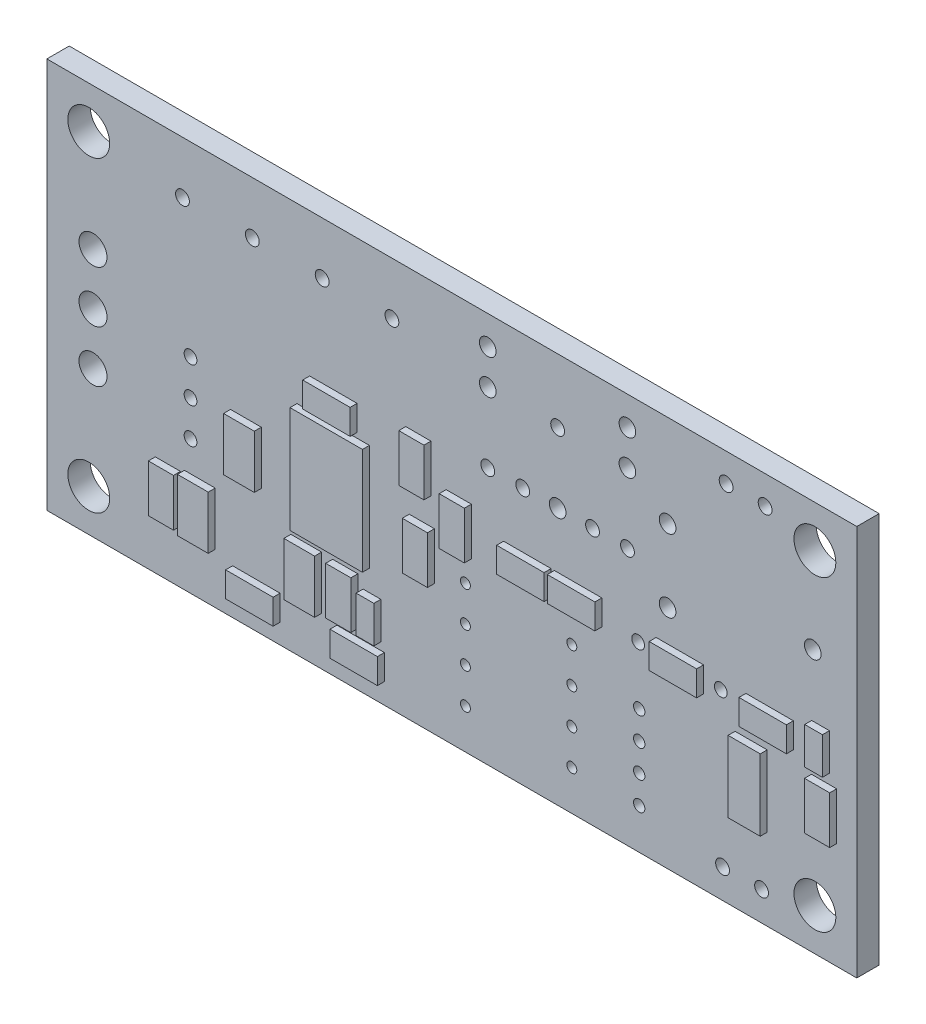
ISO-10303-21;
HEADER;
FILE_DESCRIPTION(('STEP AP214'),'2;1');
FILE_NAME('part.step','',(''),(''),'','','');
FILE_SCHEMA(('AUTOMOTIVE_DESIGN { 1 0 10303 214 1 1 1 1 }'));
ENDSEC;
DATA;
#1=APPLICATION_CONTEXT('core data for automotive mechanical design processes');
#2=APPLICATION_PROTOCOL_DEFINITION('international standard','automotive_design',2000,#1);
#3=PRODUCT_CONTEXT('',#1,'mechanical');
#4=PRODUCT('Part','Part','',(#3));
#5=PRODUCT_RELATED_PRODUCT_CATEGORY('part','',(#4));
#6=PRODUCT_DEFINITION_FORMATION('','',#4);
#7=PRODUCT_DEFINITION_CONTEXT('part definition',#1,'design');
#8=PRODUCT_DEFINITION('design','',#6,#7);
#9=PRODUCT_DEFINITION_SHAPE('','',#8);
#10=(LENGTH_UNIT() NAMED_UNIT(*) SI_UNIT(.MILLI.,.METRE.));
#11=(NAMED_UNIT(*) PLANE_ANGLE_UNIT() SI_UNIT($,.RADIAN.));
#12=(NAMED_UNIT(*) SI_UNIT($,.STERADIAN.) SOLID_ANGLE_UNIT());
#13=UNCERTAINTY_MEASURE_WITH_UNIT(LENGTH_MEASURE(1.E-05),#10,'distance_accuracy_value','');
#14=(GEOMETRIC_REPRESENTATION_CONTEXT(3) GLOBAL_UNCERTAINTY_ASSIGNED_CONTEXT((#13)) GLOBAL_UNIT_ASSIGNED_CONTEXT((#10,
#11,#12)) REPRESENTATION_CONTEXT('',''));
#15=CARTESIAN_POINT('',(0.,0.,0.));
#16=DIRECTION('',(0.,0.,1.));
#17=DIRECTION('',(1.,0.,0.));
#18=AXIS2_PLACEMENT_3D('',#15,#16,#17);
#19=CARTESIAN_POINT('',(0.,0.,1.6));
#20=DIRECTION('',(0.,0.,-1.));
#21=DIRECTION('',(-1.,0.,0.));
#22=AXIS2_PLACEMENT_3D('',#19,#20,#21);
#23=PLANE('',#22);
#24=DIRECTION('',(1.,0.,0.));
#25=VECTOR('',#24,1.);
#26=CARTESIAN_POINT('',(15.3550349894,9.03936456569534,1.6));
#27=LINE('',#26,#25);
#28=CARTESIAN_POINT('',(13.1528549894,9.03936456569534,1.6));
#29=VERTEX_POINT('',#28);
#30=CARTESIAN_POINT('',(15.3550349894,9.03936456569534,1.6));
#31=VERTEX_POINT('',#30);
#32=EDGE_CURVE('E581',#29,#31,#27,.T.);
#33=ORIENTED_EDGE('',*,*,#32,.F.);
#34=DIRECTION('',(0.,-1.,0.));
#35=VECTOR('',#34,1.);
#36=CARTESIAN_POINT('',(13.1528549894,9.03936456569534,1.6));
#37=LINE('',#36,#35);
#38=CARTESIAN_POINT('',(13.1528549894,12.8392045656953,1.6));
#39=VERTEX_POINT('',#38);
#40=EDGE_CURVE('E594',#39,#29,#37,.T.);
#41=ORIENTED_EDGE('',*,*,#40,.F.);
#42=DIRECTION('',(-1.,0.,0.));
#43=VECTOR('',#42,1.);
#44=CARTESIAN_POINT('',(13.1528549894,12.8392045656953,1.6));
#45=LINE('',#44,#43);
#46=CARTESIAN_POINT('',(15.3550349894,12.8392045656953,1.6));
#47=VERTEX_POINT('',#46);
#48=EDGE_CURVE('E603',#47,#39,#45,.T.);
#49=ORIENTED_EDGE('',*,*,#48,.F.);
#50=DIRECTION('',(0.,1.,0.));
#51=VECTOR('',#50,1.);
#52=CARTESIAN_POINT('',(15.3550349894,12.8392045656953,1.6));
#53=LINE('',#52,#51);
#54=EDGE_CURVE('E584',#31,#47,#53,.T.);
#55=ORIENTED_EDGE('',*,*,#54,.F.);
#56=EDGE_LOOP('',(#33,#41,#49,#55));
#57=FACE_BOUND('',#56,.T.);
#58=DIRECTION('',(0.,-1.,0.));
#59=VECTOR('',#58,1.);
#60=CARTESIAN_POINT('',(17.9102749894,15.5798645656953,1.6));
#61=LINE('',#60,#59);
#62=CARTESIAN_POINT('',(17.9102749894,15.5798645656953,1.6));
#63=VERTEX_POINT('',#62);
#64=CARTESIAN_POINT('',(17.9102749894,7.95986456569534,1.6));
#65=VERTEX_POINT('',#64);
#66=EDGE_CURVE('E652',#63,#65,#61,.T.);
#67=ORIENTED_EDGE('',*,*,#66,.F.);
#68=DIRECTION('',(-1.,0.,0.));
#69=VECTOR('',#68,1.);
#70=CARTESIAN_POINT('',(23.0664749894,15.5798645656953,1.6));
#71=LINE('',#70,#69);
#72=CARTESIAN_POINT('',(23.0944149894,15.5798645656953,1.6));
#73=VERTEX_POINT('',#72);
#74=EDGE_CURVE('E657',#73,#63,#71,.T.);
#75=ORIENTED_EDGE('',*,*,#74,.F.);
#76=DIRECTION('',(0.,1.,0.));
#77=VECTOR('',#76,1.);
#78=CARTESIAN_POINT('',(23.0944149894,7.95986456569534,1.6));
#79=LINE('',#78,#77);
#80=CARTESIAN_POINT('',(23.0944149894,7.95986456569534,1.6));
#81=VERTEX_POINT('',#80);
#82=EDGE_CURVE('E670',#81,#73,#79,.T.);
#83=ORIENTED_EDGE('',*,*,#82,.F.);
#84=DIRECTION('',(1.,0.,0.));
#85=VECTOR('',#84,1.);
#86=CARTESIAN_POINT('',(17.9102749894,7.95986456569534,1.6));
#87=LINE('',#86,#85);
#88=EDGE_CURVE('E667',#65,#81,#87,.T.);
#89=ORIENTED_EDGE('',*,*,#88,.F.);
#90=EDGE_LOOP('',(#67,#75,#83,#89));
#91=FACE_BOUND('',#90,.T.);
#92=DIRECTION('',(1.,0.,0.));
#93=VECTOR('',#92,1.);
#94=CARTESIAN_POINT('',(56.5563749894,7.61442456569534,1.6));
#95=LINE('',#94,#93);
#96=CARTESIAN_POINT('',(54.7555149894,7.61442456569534,1.6));
#97=VERTEX_POINT('',#96);
#98=CARTESIAN_POINT('',(56.5563749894,7.61442456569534,1.6));
#99=VERTEX_POINT('',#98);
#100=EDGE_CURVE('E719',#97,#99,#95,.T.);
#101=ORIENTED_EDGE('',*,*,#100,.F.);
#102=DIRECTION('',(0.,-1.,0.));
#103=VECTOR('',#102,1.);
#104=CARTESIAN_POINT('',(54.7555149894,7.61442456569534,1.6));
#105=LINE('',#104,#103);
#106=CARTESIAN_POINT('',(54.7555149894,11.0129445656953,1.6));
#107=VERTEX_POINT('',#106);
#108=EDGE_CURVE('E724',#107,#97,#105,.T.);
#109=ORIENTED_EDGE('',*,*,#108,.F.);
#110=DIRECTION('',(-1.,0.,0.));
#111=VECTOR('',#110,1.);
#112=CARTESIAN_POINT('',(54.7555149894,11.0129445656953,1.6));
#113=LINE('',#112,#111);
#114=CARTESIAN_POINT('',(56.5563749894,11.0129445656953,1.6));
#115=VERTEX_POINT('',#114);
#116=EDGE_CURVE('E736',#115,#107,#113,.T.);
#117=ORIENTED_EDGE('',*,*,#116,.F.);
#118=DIRECTION('',(0.,1.,0.));
#119=VECTOR('',#118,1.);
#120=CARTESIAN_POINT('',(56.5563749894,11.0129445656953,1.6));
#121=LINE('',#120,#119);
#122=EDGE_CURVE('E733',#99,#115,#121,.T.);
#123=ORIENTED_EDGE('',*,*,#122,.F.);
#124=EDGE_LOOP('',(#101,#109,#117,#123));
#125=FACE_BOUND('',#124,.T.);
#126=DIRECTION('',(0.,-1.,0.));
#127=VECTOR('',#126,1.);
#128=CARTESIAN_POINT('',(43.6303149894,12.1356245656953,1.6));
#129=LINE('',#128,#127);
#130=CARTESIAN_POINT('',(43.6303149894,13.9364845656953,1.6));
#131=VERTEX_POINT('',#130);
#132=CARTESIAN_POINT('',(43.6303149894,12.1356245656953,1.6));
#133=VERTEX_POINT('',#132);
#134=EDGE_CURVE('E785',#131,#133,#129,.T.);
#135=ORIENTED_EDGE('',*,*,#134,.F.);
#136=DIRECTION('',(-1.,0.,0.));
#137=VECTOR('',#136,1.);
#138=CARTESIAN_POINT('',(43.6303149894,13.9364845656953,1.6));
#139=LINE('',#138,#137);
#140=CARTESIAN_POINT('',(47.0288349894,13.9364845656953,1.6));
#141=VERTEX_POINT('',#140);
#142=EDGE_CURVE('E790',#141,#131,#139,.T.);
#143=ORIENTED_EDGE('',*,*,#142,.F.);
#144=DIRECTION('',(0.,1.,0.));
#145=VECTOR('',#144,1.);
#146=CARTESIAN_POINT('',(47.0288349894,13.9364845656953,1.6));
#147=LINE('',#146,#145);
#148=CARTESIAN_POINT('',(47.0288349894,12.1356245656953,1.6));
#149=VERTEX_POINT('',#148);
#150=EDGE_CURVE('E802',#149,#141,#147,.T.);
#151=ORIENTED_EDGE('',*,*,#150,.F.);
#152=DIRECTION('',(1.,0.,0.));
#153=VECTOR('',#152,1.);
#154=CARTESIAN_POINT('',(47.0288349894,12.1356245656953,1.6));
#155=LINE('',#154,#153);
#156=EDGE_CURVE('E799',#133,#149,#155,.T.);
#157=ORIENTED_EDGE('',*,*,#156,.F.);
#158=EDGE_LOOP('',(#135,#143,#151,#157));
#159=FACE_BOUND('',#158,.T.);
#160=DIRECTION('',(0.,1.,0.));
#161=VECTOR('',#160,1.);
#162=CARTESIAN_POINT('',(39.7415749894,14.4444845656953,1.6));
#163=LINE('',#162,#161);
#164=CARTESIAN_POINT('',(39.7415749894,12.6436245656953,1.6));
#165=VERTEX_POINT('',#164);
#166=CARTESIAN_POINT('',(39.7415749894,14.4444845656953,1.6));
#167=VERTEX_POINT('',#166);
#168=EDGE_CURVE('E851',#165,#167,#163,.T.);
#169=ORIENTED_EDGE('',*,*,#168,.F.);
#170=DIRECTION('',(1.,0.,0.));
#171=VECTOR('',#170,1.);
#172=CARTESIAN_POINT('',(39.7415749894,12.6436245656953,1.6));
#173=LINE('',#172,#171);
#174=CARTESIAN_POINT('',(36.3430549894,12.6436245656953,1.6));
#175=VERTEX_POINT('',#174);
#176=EDGE_CURVE('E856',#175,#165,#173,.T.);
#177=ORIENTED_EDGE('',*,*,#176,.F.);
#178=DIRECTION('',(0.,-1.,0.));
#179=VECTOR('',#178,1.);
#180=CARTESIAN_POINT('',(36.3430549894,12.6436245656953,1.6));
#181=LINE('',#180,#179);
#182=CARTESIAN_POINT('',(36.3430549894,14.4444845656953,1.6));
#183=VERTEX_POINT('',#182);
#184=EDGE_CURVE('E868',#183,#175,#181,.T.);
#185=ORIENTED_EDGE('',*,*,#184,.F.);
#186=DIRECTION('',(-1.,0.,0.));
#187=VECTOR('',#186,1.);
#188=CARTESIAN_POINT('',(36.3430549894,14.4444845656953,1.6));
#189=LINE('',#188,#187);
#190=EDGE_CURVE('E865',#167,#183,#189,.T.);
#191=ORIENTED_EDGE('',*,*,#190,.F.);
#192=EDGE_LOOP('',(#169,#177,#185,#191));
#193=FACE_BOUND('',#192,.T.);
#194=DIRECTION('',(1.,0.,0.));
#195=VECTOR('',#194,1.);
#196=CARTESIAN_POINT('',(19.6730349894,3.45136456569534,1.6));
#197=LINE('',#196,#195);
#198=CARTESIAN_POINT('',(17.4708549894,3.45136456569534,1.6));
#199=VERTEX_POINT('',#198);
#200=CARTESIAN_POINT('',(19.6730349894,3.45136456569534,1.6));
#201=VERTEX_POINT('',#200);
#202=EDGE_CURVE('E917',#199,#201,#197,.T.);
#203=ORIENTED_EDGE('',*,*,#202,.F.);
#204=DIRECTION('',(0.,-1.,0.));
#205=VECTOR('',#204,1.);
#206=CARTESIAN_POINT('',(17.4708549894,3.45136456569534,1.6));
#207=LINE('',#206,#205);
#208=CARTESIAN_POINT('',(17.4708549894,7.25120456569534,1.6));
#209=VERTEX_POINT('',#208);
#210=EDGE_CURVE('E922',#209,#199,#207,.T.);
#211=ORIENTED_EDGE('',*,*,#210,.F.);
#212=DIRECTION('',(-1.,0.,0.));
#213=VECTOR('',#212,1.);
#214=CARTESIAN_POINT('',(17.4708549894,7.25120456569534,1.6));
#215=LINE('',#214,#213);
#216=CARTESIAN_POINT('',(19.6730349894,7.25120456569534,1.6));
#217=VERTEX_POINT('',#216);
#218=EDGE_CURVE('E934',#217,#209,#215,.T.);
#219=ORIENTED_EDGE('',*,*,#218,.F.);
#220=DIRECTION('',(0.,1.,0.));
#221=VECTOR('',#220,1.);
#222=CARTESIAN_POINT('',(19.6730349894,7.25120456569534,1.6));
#223=LINE('',#222,#221);
#224=EDGE_CURVE('E931',#201,#217,#223,.T.);
#225=ORIENTED_EDGE('',*,*,#224,.F.);
#226=EDGE_LOOP('',(#203,#211,#219,#225));
#227=FACE_BOUND('',#226,.T.);
#228=DIRECTION('',(1.,0.,0.));
#229=VECTOR('',#228,1.);
#230=CARTESIAN_POINT('',(9.56637498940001,3.80442456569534,1.6));
#231=LINE('',#230,#229);
#232=CARTESIAN_POINT('',(7.76551498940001,3.80442456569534,1.6));
#233=VERTEX_POINT('',#232);
#234=CARTESIAN_POINT('',(9.56637498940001,3.80442456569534,1.6));
#235=VERTEX_POINT('',#234);
#236=EDGE_CURVE('E983',#233,#235,#231,.T.);
#237=ORIENTED_EDGE('',*,*,#236,.F.);
#238=DIRECTION('',(0.,-1.,0.));
#239=VECTOR('',#238,1.);
#240=CARTESIAN_POINT('',(7.76551498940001,3.80442456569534,1.6));
#241=LINE('',#240,#239);
#242=CARTESIAN_POINT('',(7.76551498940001,7.20294456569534,1.6));
#243=VERTEX_POINT('',#242);
#244=EDGE_CURVE('E988',#243,#233,#241,.T.);
#245=ORIENTED_EDGE('',*,*,#244,.F.);
#246=DIRECTION('',(-1.,0.,0.));
#247=VECTOR('',#246,1.);
#248=CARTESIAN_POINT('',(7.76551498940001,7.20294456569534,1.6));
#249=LINE('',#248,#247);
#250=CARTESIAN_POINT('',(9.56637498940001,7.20294456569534,1.6));
#251=VERTEX_POINT('',#250);
#252=EDGE_CURVE('E1000',#251,#243,#249,.T.);
#253=ORIENTED_EDGE('',*,*,#252,.F.);
#254=DIRECTION('',(0.,1.,0.));
#255=VECTOR('',#254,1.);
#256=CARTESIAN_POINT('',(9.56637498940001,7.20294456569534,1.6));
#257=LINE('',#256,#255);
#258=EDGE_CURVE('E997',#235,#251,#257,.T.);
#259=ORIENTED_EDGE('',*,*,#258,.F.);
#260=EDGE_LOOP('',(#237,#245,#253,#259));
#261=FACE_BOUND('',#260,.T.);
#262=DIRECTION('',(0.,-1.,0.));
#263=VECTOR('',#262,1.);
#264=CARTESIAN_POINT('',(20.7703149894,1.46762456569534,1.6));
#265=LINE('',#264,#263);
#266=CARTESIAN_POINT('',(20.7703149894,3.26848456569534,1.6));
#267=VERTEX_POINT('',#266);
#268=CARTESIAN_POINT('',(20.7703149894,1.46762456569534,1.6));
#269=VERTEX_POINT('',#268);
#270=EDGE_CURVE('E1049',#267,#269,#265,.T.);
#271=ORIENTED_EDGE('',*,*,#270,.F.);
#272=DIRECTION('',(-1.,0.,0.));
#273=VECTOR('',#272,1.);
#274=CARTESIAN_POINT('',(20.7703149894,3.26848456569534,1.6));
#275=LINE('',#274,#273);
#276=CARTESIAN_POINT('',(24.1688349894,3.26848456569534,1.6));
#277=VERTEX_POINT('',#276);
#278=EDGE_CURVE('E1054',#277,#267,#275,.T.);
#279=ORIENTED_EDGE('',*,*,#278,.F.);
#280=DIRECTION('',(0.,1.,0.));
#281=VECTOR('',#280,1.);
#282=CARTESIAN_POINT('',(24.1688349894,3.26848456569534,1.6));
#283=LINE('',#282,#281);
#284=CARTESIAN_POINT('',(24.1688349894,1.46762456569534,1.6));
#285=VERTEX_POINT('',#284);
#286=EDGE_CURVE('E1066',#285,#277,#283,.T.);
#287=ORIENTED_EDGE('',*,*,#286,.F.);
#288=DIRECTION('',(1.,0.,0.));
#289=VECTOR('',#288,1.);
#290=CARTESIAN_POINT('',(24.1688349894,1.46762456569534,1.6));
#291=LINE('',#290,#289);
#292=EDGE_CURVE('E1063',#269,#285,#291,.T.);
#293=ORIENTED_EDGE('',*,*,#292,.F.);
#294=EDGE_LOOP('',(#271,#279,#287,#293));
#295=FACE_BOUND('',#294,.T.);
#296=DIRECTION('',(0.,-1.,0.));
#297=VECTOR('',#296,1.);
#298=CARTESIAN_POINT('',(13.3001749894,1.41428456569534,1.6));
#299=LINE('',#298,#297);
#300=CARTESIAN_POINT('',(13.3001749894,3.21514456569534,1.6));
#301=VERTEX_POINT('',#300);
#302=CARTESIAN_POINT('',(13.3001749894,1.41428456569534,1.6));
#303=VERTEX_POINT('',#302);
#304=EDGE_CURVE('E1115',#301,#303,#299,.T.);
#305=ORIENTED_EDGE('',*,*,#304,.F.);
#306=DIRECTION('',(-1.,0.,0.));
#307=VECTOR('',#306,1.);
#308=CARTESIAN_POINT('',(13.3001749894,3.21514456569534,1.6));
#309=LINE('',#308,#307);
#310=CARTESIAN_POINT('',(16.6986949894,3.21514456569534,1.6));
#311=VERTEX_POINT('',#310);
#312=EDGE_CURVE('E1120',#311,#301,#309,.T.);
#313=ORIENTED_EDGE('',*,*,#312,.F.);
#314=DIRECTION('',(0.,1.,0.));
#315=VECTOR('',#314,1.);
#316=CARTESIAN_POINT('',(16.6986949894,3.21514456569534,1.6));
#317=LINE('',#316,#315);
#318=CARTESIAN_POINT('',(16.6986949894,1.41428456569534,1.6));
#319=VERTEX_POINT('',#318);
#320=EDGE_CURVE('E1132',#319,#311,#317,.T.);
#321=ORIENTED_EDGE('',*,*,#320,.F.);
#322=DIRECTION('',(1.,0.,0.));
#323=VECTOR('',#322,1.);
#324=CARTESIAN_POINT('',(16.6986949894,1.41428456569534,1.6));
#325=LINE('',#324,#323);
#326=EDGE_CURVE('E1129',#303,#319,#325,.T.);
#327=ORIENTED_EDGE('',*,*,#326,.F.);
#328=EDGE_LOOP('',(#305,#313,#321,#327));
#329=FACE_BOUND('',#328,.T.);
#330=DIRECTION('',(0.,1.,0.));
#331=VECTOR('',#330,1.);
#332=CARTESIAN_POINT('',(53.4575749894,13.6824845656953,1.6));
#333=LINE('',#332,#331);
#334=CARTESIAN_POINT('',(53.4575749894,11.8816245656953,1.6));
#335=VERTEX_POINT('',#334);
#336=CARTESIAN_POINT('',(53.4575749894,13.6824845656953,1.6));
#337=VERTEX_POINT('',#336);
#338=EDGE_CURVE('E1181',#335,#337,#333,.T.);
#339=ORIENTED_EDGE('',*,*,#338,.F.);
#340=DIRECTION('',(1.,0.,0.));
#341=VECTOR('',#340,1.);
#342=CARTESIAN_POINT('',(53.4575749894,11.8816245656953,1.6));
#343=LINE('',#342,#341);
#344=CARTESIAN_POINT('',(50.0590549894,11.8816245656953,1.6));
#345=VERTEX_POINT('',#344);
#346=EDGE_CURVE('E1186',#345,#335,#343,.T.);
#347=ORIENTED_EDGE('',*,*,#346,.F.);
#348=DIRECTION('',(0.,-1.,0.));
#349=VECTOR('',#348,1.);
#350=CARTESIAN_POINT('',(50.0590549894,11.8816245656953,1.6));
#351=LINE('',#350,#349);
#352=CARTESIAN_POINT('',(50.0590549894,13.6824845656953,1.6));
#353=VERTEX_POINT('',#352);
#354=EDGE_CURVE('E1198',#353,#345,#351,.T.);
#355=ORIENTED_EDGE('',*,*,#354,.F.);
#356=DIRECTION('',(-1.,0.,0.));
#357=VECTOR('',#356,1.);
#358=CARTESIAN_POINT('',(50.0590549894,13.6824845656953,1.6));
#359=LINE('',#358,#357);
#360=EDGE_CURVE('E1195',#337,#353,#359,.T.);
#361=ORIENTED_EDGE('',*,*,#360,.F.);
#362=EDGE_LOOP('',(#339,#347,#355,#361));
#363=FACE_BOUND('',#362,.T.);
#364=DIRECTION('',(1.,0.,0.));
#365=VECTOR('',#364,1.);
#366=CARTESIAN_POINT('',(57.99836,0.,1.6));
#367=LINE('',#366,#365);
#368=CARTESIAN_POINT('',(0.,0.,1.6));
#369=VERTEX_POINT('',#368);
#370=CARTESIAN_POINT('',(57.99836,0.,1.6));
#371=VERTEX_POINT('',#370);
#372=EDGE_CURVE('E1485',#369,#371,#367,.T.);
#373=ORIENTED_EDGE('',*,*,#372,.T.);
#374=DIRECTION('',(0.,1.,0.));
#375=VECTOR('',#374,1.);
#376=CARTESIAN_POINT('',(57.99836,28.00096,1.6));
#377=LINE('',#376,#375);
#378=CARTESIAN_POINT('',(57.99836,28.00096,1.6));
#379=VERTEX_POINT('',#378);
#380=EDGE_CURVE('E1488',#371,#379,#377,.T.);
#381=ORIENTED_EDGE('',*,*,#380,.T.);
#382=DIRECTION('',(-1.,0.,0.));
#383=VECTOR('',#382,1.);
#384=CARTESIAN_POINT('',(0.,28.00096,1.6));
#385=LINE('',#384,#383);
#386=CARTESIAN_POINT('',(0.,28.00096,1.6));
#387=VERTEX_POINT('',#386);
#388=EDGE_CURVE('E1491',#379,#387,#385,.T.);
#389=ORIENTED_EDGE('',*,*,#388,.T.);
#390=DIRECTION('',(0.,-1.,0.));
#391=VECTOR('',#390,1.);
#392=CARTESIAN_POINT('',(0.,0.,1.6));
#393=LINE('',#392,#391);
#394=EDGE_CURVE('E1493',#387,#369,#393,.T.);
#395=ORIENTED_EDGE('',*,*,#394,.T.);
#396=EDGE_LOOP('',(#373,#381,#389,#395));
#397=FACE_BOUND('',#396,.T.);
#398=CARTESIAN_POINT('',(51.181,2.09296,1.6));
#399=DIRECTION('',(0.,0.,1.));
#400=DIRECTION('',(1.,0.,0.));
#401=AXIS2_PLACEMENT_3D('',#398,#399,#400);
#402=CIRCLE('',#401,0.495299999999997);
#403=CARTESIAN_POINT('',(51.6763,2.09296,1.6));
#404=VERTEX_POINT('',#403);
#405=EDGE_CURVE('E1479',#404,#404,#402,.T.);
#406=ORIENTED_EDGE('',*,*,#405,.F.);
#407=EDGE_LOOP('',(#406));
#408=FACE_BOUND('',#407,.T.);
#409=CARTESIAN_POINT('',(48.387,2.09296,1.6));
#410=DIRECTION('',(0.,0.,1.));
#411=DIRECTION('',(1.,0.,0.));
#412=AXIS2_PLACEMENT_3D('',#409,#410,#411);
#413=CIRCLE('',#412,0.495299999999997);
#414=CARTESIAN_POINT('',(48.8823,2.09296,1.6));
#415=VERTEX_POINT('',#414);
#416=EDGE_CURVE('E1473',#415,#415,#413,.T.);
#417=ORIENTED_EDGE('',*,*,#416,.F.);
#418=EDGE_LOOP('',(#417));
#419=FACE_BOUND('',#418,.T.);
#420=CARTESIAN_POINT('',(51.435,25.96896,1.6));
#421=DIRECTION('',(0.,0.,1.));
#422=DIRECTION('',(1.,0.,0.));
#423=AXIS2_PLACEMENT_3D('',#420,#421,#422);
#424=CIRCLE('',#423,0.495299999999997);
#425=CARTESIAN_POINT('',(51.9303,25.96896,1.6));
#426=VERTEX_POINT('',#425);
#427=EDGE_CURVE('E1467',#426,#426,#424,.T.);
#428=ORIENTED_EDGE('',*,*,#427,.F.);
#429=EDGE_LOOP('',(#428));
#430=FACE_BOUND('',#429,.T.);
#431=CARTESIAN_POINT('',(48.641,25.96896,1.6));
#432=DIRECTION('',(0.,0.,1.));
#433=DIRECTION('',(1.,0.,0.));
#434=AXIS2_PLACEMENT_3D('',#431,#432,#433);
#435=CIRCLE('',#434,0.495299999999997);
#436=CARTESIAN_POINT('',(49.1363,25.96896,1.6));
#437=VERTEX_POINT('',#436);
#438=EDGE_CURVE('E1461',#437,#437,#435,.T.);
#439=ORIENTED_EDGE('',*,*,#438,.F.);
#440=EDGE_LOOP('',(#439));
#441=FACE_BOUND('',#440,.T.);
#442=CARTESIAN_POINT('',(24.70912,24.25446,1.6));
#443=DIRECTION('',(0.,0.,1.));
#444=DIRECTION('',(1.,0.,0.));
#445=AXIS2_PLACEMENT_3D('',#442,#443,#444);
#446=CIRCLE('',#445,0.495300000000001);
#447=CARTESIAN_POINT('',(25.20442,24.25446,1.6));
#448=VERTEX_POINT('',#447);
#449=EDGE_CURVE('E1455',#448,#448,#446,.T.);
#450=ORIENTED_EDGE('',*,*,#449,.F.);
#451=EDGE_LOOP('',(#450));
#452=FACE_BOUND('',#451,.T.);
#453=CARTESIAN_POINT('',(19.71294,24.25446,1.6));
#454=DIRECTION('',(0.,0.,1.));
#455=DIRECTION('',(1.,0.,0.));
#456=AXIS2_PLACEMENT_3D('',#453,#454,#455);
#457=CIRCLE('',#456,0.495300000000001);
#458=CARTESIAN_POINT('',(20.20824,24.25446,1.6));
#459=VERTEX_POINT('',#458);
#460=EDGE_CURVE('E1449',#459,#459,#457,.T.);
#461=ORIENTED_EDGE('',*,*,#460,.F.);
#462=EDGE_LOOP('',(#461));
#463=FACE_BOUND('',#462,.T.);
#464=CARTESIAN_POINT('',(14.71168,24.25446,1.6));
#465=DIRECTION('',(0.,0.,1.));
#466=DIRECTION('',(1.,0.,0.));
#467=AXIS2_PLACEMENT_3D('',#464,#465,#466);
#468=CIRCLE('',#467,0.495300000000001);
#469=CARTESIAN_POINT('',(15.20698,24.25446,1.6));
#470=VERTEX_POINT('',#469);
#471=EDGE_CURVE('E1443',#470,#470,#468,.T.);
#472=ORIENTED_EDGE('',*,*,#471,.F.);
#473=EDGE_LOOP('',(#472));
#474=FACE_BOUND('',#473,.T.);
#475=CARTESIAN_POINT('',(9.71042,24.257,1.6));
#476=DIRECTION('',(0.,0.,1.));
#477=DIRECTION('',(1.,0.,0.));
#478=AXIS2_PLACEMENT_3D('',#475,#476,#477);
#479=CIRCLE('',#478,0.495300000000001);
#480=CARTESIAN_POINT('',(10.20572,24.257,1.6));
#481=VERTEX_POINT('',#480);
#482=EDGE_CURVE('E1437',#481,#481,#479,.T.);
#483=ORIENTED_EDGE('',*,*,#482,.F.);
#484=EDGE_LOOP('',(#483));
#485=FACE_BOUND('',#484,.T.);
#486=CARTESIAN_POINT('',(36.576,23.42896,1.6));
#487=DIRECTION('',(0.,0.,1.));
#488=DIRECTION('',(1.,0.,0.));
#489=AXIS2_PLACEMENT_3D('',#486,#487,#488);
#490=CIRCLE('',#489,0.495299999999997);
#491=CARTESIAN_POINT('',(37.0713,23.42896,1.6));
#492=VERTEX_POINT('',#491);
#493=EDGE_CURVE('E1431',#492,#492,#490,.T.);
#494=ORIENTED_EDGE('',*,*,#493,.F.);
#495=EDGE_LOOP('',(#494));
#496=FACE_BOUND('',#495,.T.);
#497=CARTESIAN_POINT('',(41.57726,18.4277,1.6));
#498=DIRECTION('',(0.,0.,1.));
#499=DIRECTION('',(1.,0.,0.));
#500=AXIS2_PLACEMENT_3D('',#497,#498,#499);
#501=CIRCLE('',#500,0.495299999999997);
#502=CARTESIAN_POINT('',(42.07256,18.4277,1.6));
#503=VERTEX_POINT('',#502);
#504=EDGE_CURVE('E1425',#503,#503,#501,.T.);
#505=ORIENTED_EDGE('',*,*,#504,.F.);
#506=EDGE_LOOP('',(#505));
#507=FACE_BOUND('',#506,.T.);
#508=CARTESIAN_POINT('',(39.07536,18.4277,1.6));
#509=DIRECTION('',(0.,0.,1.));
#510=DIRECTION('',(1.,0.,0.));
#511=AXIS2_PLACEMENT_3D('',#508,#509,#510);
#512=CIRCLE('',#511,0.495299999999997);
#513=CARTESIAN_POINT('',(39.57066,18.4277,1.6));
#514=VERTEX_POINT('',#513);
#515=EDGE_CURVE('E1419',#514,#514,#512,.T.);
#516=ORIENTED_EDGE('',*,*,#515,.F.);
#517=EDGE_LOOP('',(#516));
#518=FACE_BOUND('',#517,.T.);
#519=CARTESIAN_POINT('',(31.5722,18.4277,1.6));
#520=DIRECTION('',(0.,0.,1.));
#521=DIRECTION('',(1.,0.,0.));
#522=AXIS2_PLACEMENT_3D('',#519,#520,#521);
#523=CIRCLE('',#522,0.495299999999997);
#524=CARTESIAN_POINT('',(32.0675,18.4277,1.6));
#525=VERTEX_POINT('',#524);
#526=EDGE_CURVE('E1413',#525,#525,#523,.T.);
#527=ORIENTED_EDGE('',*,*,#526,.F.);
#528=EDGE_LOOP('',(#527));
#529=FACE_BOUND('',#528,.T.);
#530=CARTESIAN_POINT('',(34.0741,18.4277,1.6));
#531=DIRECTION('',(0.,0.,1.));
#532=DIRECTION('',(1.,0.,0.));
#533=AXIS2_PLACEMENT_3D('',#530,#531,#532);
#534=CIRCLE('',#533,0.495299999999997);
#535=CARTESIAN_POINT('',(34.5694,18.4277,1.6));
#536=VERTEX_POINT('',#535);
#537=EDGE_CURVE('E1407',#536,#536,#534,.T.);
#538=ORIENTED_EDGE('',*,*,#537,.F.);
#539=EDGE_LOOP('',(#538));
#540=FACE_BOUND('',#539,.T.);
#541=CARTESIAN_POINT('',(42.418,2.90322,1.6));
#542=DIRECTION('',(0.,0.,1.));
#543=DIRECTION('',(1.,0.,0.));
#544=AXIS2_PLACEMENT_3D('',#541,#542,#543);
#545=CIRCLE('',#544,0.406400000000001);
#546=CARTESIAN_POINT('',(42.8244,2.90322,1.6));
#547=VERTEX_POINT('',#546);
#548=EDGE_CURVE('E1401',#547,#547,#545,.T.);
#549=ORIENTED_EDGE('',*,*,#548,.F.);
#550=EDGE_LOOP('',(#549));
#551=FACE_BOUND('',#550,.T.);
#552=CARTESIAN_POINT('',(42.418,4.91236,1.6));
#553=DIRECTION('',(0.,0.,1.));
#554=DIRECTION('',(1.,0.,0.));
#555=AXIS2_PLACEMENT_3D('',#552,#553,#554);
#556=CIRCLE('',#555,0.406400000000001);
#557=CARTESIAN_POINT('',(42.8244,4.91236,1.6));
#558=VERTEX_POINT('',#557);
#559=EDGE_CURVE('E1395',#558,#558,#556,.T.);
#560=ORIENTED_EDGE('',*,*,#559,.F.);
#561=EDGE_LOOP('',(#560));
#562=FACE_BOUND('',#561,.T.);
#563=CARTESIAN_POINT('',(42.418,6.89356,1.6));
#564=DIRECTION('',(0.,0.,1.));
#565=DIRECTION('',(1.,0.,0.));
#566=AXIS2_PLACEMENT_3D('',#563,#564,#565);
#567=CIRCLE('',#566,0.406400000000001);
#568=CARTESIAN_POINT('',(42.8244,6.89356,1.6));
#569=VERTEX_POINT('',#568);
#570=EDGE_CURVE('E1389',#569,#569,#567,.T.);
#571=ORIENTED_EDGE('',*,*,#570,.F.);
#572=EDGE_LOOP('',(#571));
#573=FACE_BOUND('',#572,.T.);
#574=CARTESIAN_POINT('',(42.418,8.90016,1.6));
#575=DIRECTION('',(0.,0.,1.));
#576=DIRECTION('',(1.,0.,0.));
#577=AXIS2_PLACEMENT_3D('',#574,#575,#576);
#578=CIRCLE('',#577,0.406400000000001);
#579=CARTESIAN_POINT('',(42.8244,8.90016,1.6));
#580=VERTEX_POINT('',#579);
#581=EDGE_CURVE('E1383',#580,#580,#578,.T.);
#582=ORIENTED_EDGE('',*,*,#581,.F.);
#583=EDGE_LOOP('',(#582));
#584=FACE_BOUND('',#583,.T.);
#585=CARTESIAN_POINT('',(29.972,10.47496,1.6));
#586=DIRECTION('',(0.,0.,1.));
#587=DIRECTION('',(1.,0.,0.));
#588=AXIS2_PLACEMENT_3D('',#585,#586,#587);
#589=CIRCLE('',#588,0.355600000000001);
#590=CARTESIAN_POINT('',(30.3276,10.47496,1.6));
#591=VERTEX_POINT('',#590);
#592=EDGE_CURVE('E1377',#591,#591,#589,.T.);
#593=ORIENTED_EDGE('',*,*,#592,.F.);
#594=EDGE_LOOP('',(#593));
#595=FACE_BOUND('',#594,.T.);
#596=CARTESIAN_POINT('',(29.972,7.93496,1.6));
#597=DIRECTION('',(0.,0.,1.));
#598=DIRECTION('',(1.,0.,0.));
#599=AXIS2_PLACEMENT_3D('',#596,#597,#598);
#600=CIRCLE('',#599,0.355600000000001);
#601=CARTESIAN_POINT('',(30.3276,7.93496,1.6));
#602=VERTEX_POINT('',#601);
#603=EDGE_CURVE('E1371',#602,#602,#600,.T.);
#604=ORIENTED_EDGE('',*,*,#603,.F.);
#605=EDGE_LOOP('',(#604));
#606=FACE_BOUND('',#605,.T.);
#607=CARTESIAN_POINT('',(29.972,5.39496,1.6));
#608=DIRECTION('',(0.,0.,1.));
#609=DIRECTION('',(1.,0.,0.));
#610=AXIS2_PLACEMENT_3D('',#607,#608,#609);
#611=CIRCLE('',#610,0.355600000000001);
#612=CARTESIAN_POINT('',(30.3276,5.39496,1.6));
#613=VERTEX_POINT('',#612);
#614=EDGE_CURVE('E1365',#613,#613,#611,.T.);
#615=ORIENTED_EDGE('',*,*,#614,.F.);
#616=EDGE_LOOP('',(#615));
#617=FACE_BOUND('',#616,.T.);
#618=CARTESIAN_POINT('',(29.972,2.85496,1.6));
#619=DIRECTION('',(0.,0.,1.));
#620=DIRECTION('',(1.,0.,0.));
#621=AXIS2_PLACEMENT_3D('',#618,#619,#620);
#622=CIRCLE('',#621,0.355600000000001);
#623=CARTESIAN_POINT('',(30.3276,2.85496,1.6));
#624=VERTEX_POINT('',#623);
#625=EDGE_CURVE('E1359',#624,#624,#622,.T.);
#626=ORIENTED_EDGE('',*,*,#625,.F.);
#627=EDGE_LOOP('',(#626));
#628=FACE_BOUND('',#627,.T.);
#629=CARTESIAN_POINT('',(37.592,2.85496,1.6));
#630=DIRECTION('',(0.,0.,1.));
#631=DIRECTION('',(1.,0.,0.));
#632=AXIS2_PLACEMENT_3D('',#629,#630,#631);
#633=CIRCLE('',#632,0.355599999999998);
#634=CARTESIAN_POINT('',(37.9476,2.85496,1.6));
#635=VERTEX_POINT('',#634);
#636=EDGE_CURVE('E1353',#635,#635,#633,.T.);
#637=ORIENTED_EDGE('',*,*,#636,.F.);
#638=EDGE_LOOP('',(#637));
#639=FACE_BOUND('',#638,.T.);
#640=CARTESIAN_POINT('',(37.592,5.39496,1.6));
#641=DIRECTION('',(0.,0.,1.));
#642=DIRECTION('',(1.,0.,0.));
#643=AXIS2_PLACEMENT_3D('',#640,#641,#642);
#644=CIRCLE('',#643,0.355599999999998);
#645=CARTESIAN_POINT('',(37.9476,5.39496,1.6));
#646=VERTEX_POINT('',#645);
#647=EDGE_CURVE('E1347',#646,#646,#644,.T.);
#648=ORIENTED_EDGE('',*,*,#647,.F.);
#649=EDGE_LOOP('',(#648));
#650=FACE_BOUND('',#649,.T.);
#651=CARTESIAN_POINT('',(37.592,7.93496,1.6));
#652=DIRECTION('',(0.,0.,1.));
#653=DIRECTION('',(1.,0.,0.));
#654=AXIS2_PLACEMENT_3D('',#651,#652,#653);
#655=CIRCLE('',#654,0.355599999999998);
#656=CARTESIAN_POINT('',(37.9476,7.93496,1.6));
#657=VERTEX_POINT('',#656);
#658=EDGE_CURVE('E1341',#657,#657,#655,.T.);
#659=ORIENTED_EDGE('',*,*,#658,.F.);
#660=EDGE_LOOP('',(#659));
#661=FACE_BOUND('',#660,.T.);
#662=CARTESIAN_POINT('',(37.592,10.47496,1.6));
#663=DIRECTION('',(0.,0.,1.));
#664=DIRECTION('',(1.,0.,0.));
#665=AXIS2_PLACEMENT_3D('',#662,#663,#664);
#666=CIRCLE('',#665,0.355599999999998);
#667=CARTESIAN_POINT('',(37.9476,10.47496,1.6));
#668=VERTEX_POINT('',#667);
#669=EDGE_CURVE('E1335',#668,#668,#666,.T.);
#670=ORIENTED_EDGE('',*,*,#669,.F.);
#671=EDGE_LOOP('',(#670));
#672=FACE_BOUND('',#671,.T.);
#673=CARTESIAN_POINT('',(54.84876,18.796,1.6));
#674=DIRECTION('',(0.,0.,1.));
#675=DIRECTION('',(1.,0.,0.));
#676=AXIS2_PLACEMENT_3D('',#673,#674,#675);
#677=CIRCLE('',#676,0.596899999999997);
#678=CARTESIAN_POINT('',(55.44566,18.796,1.6));
#679=VERTEX_POINT('',#678);
#680=EDGE_CURVE('E1329',#679,#679,#677,.T.);
#681=ORIENTED_EDGE('',*,*,#680,.F.);
#682=EDGE_LOOP('',(#681));
#683=FACE_BOUND('',#682,.T.);
#684=CARTESIAN_POINT('',(44.45,21.3995,1.6));
#685=DIRECTION('',(0.,0.,1.));
#686=DIRECTION('',(1.,0.,0.));
#687=AXIS2_PLACEMENT_3D('',#684,#685,#686);
#688=CIRCLE('',#687,0.596899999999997);
#689=CARTESIAN_POINT('',(45.0469,21.3995,1.6));
#690=VERTEX_POINT('',#689);
#691=EDGE_CURVE('E1323',#690,#690,#688,.T.);
#692=ORIENTED_EDGE('',*,*,#691,.F.);
#693=EDGE_LOOP('',(#692));
#694=FACE_BOUND('',#693,.T.);
#695=CARTESIAN_POINT('',(44.45,16.20012,1.6));
#696=DIRECTION('',(0.,0.,1.));
#697=DIRECTION('',(1.,0.,0.));
#698=AXIS2_PLACEMENT_3D('',#695,#696,#697);
#699=CIRCLE('',#698,0.596899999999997);
#700=CARTESIAN_POINT('',(45.0469,16.20012,1.6));
#701=VERTEX_POINT('',#700);
#702=EDGE_CURVE('E1317',#701,#701,#699,.T.);
#703=ORIENTED_EDGE('',*,*,#702,.F.);
#704=EDGE_LOOP('',(#703));
#705=FACE_BOUND('',#704,.T.);
#706=CARTESIAN_POINT('',(36.576,18.4277,1.6));
#707=DIRECTION('',(0.,0.,1.));
#708=DIRECTION('',(1.,0.,0.));
#709=AXIS2_PLACEMENT_3D('',#706,#707,#708);
#710=CIRCLE('',#709,0.596899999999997);
#711=CARTESIAN_POINT('',(37.1729,18.4277,1.6));
#712=VERTEX_POINT('',#711);
#713=EDGE_CURVE('E1311',#712,#712,#710,.T.);
#714=ORIENTED_EDGE('',*,*,#713,.F.);
#715=EDGE_LOOP('',(#714));
#716=FACE_BOUND('',#715,.T.);
#717=CARTESIAN_POINT('',(41.57218,23.42896,1.6));
#718=DIRECTION('',(0.,0.,1.));
#719=DIRECTION('',(1.,0.,0.));
#720=AXIS2_PLACEMENT_3D('',#717,#718,#719);
#721=CIRCLE('',#720,0.596899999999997);
#722=CARTESIAN_POINT('',(42.16908,23.42896,1.6));
#723=VERTEX_POINT('',#722);
#724=EDGE_CURVE('E1305',#723,#723,#721,.T.);
#725=ORIENTED_EDGE('',*,*,#724,.F.);
#726=EDGE_LOOP('',(#725));
#727=FACE_BOUND('',#726,.T.);
#728=CARTESIAN_POINT('',(31.5722,23.42896,1.6));
#729=DIRECTION('',(0.,0.,1.));
#730=DIRECTION('',(1.,0.,0.));
#731=AXIS2_PLACEMENT_3D('',#728,#729,#730);
#732=CIRCLE('',#731,0.596899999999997);
#733=CARTESIAN_POINT('',(32.1691,23.42896,1.6));
#734=VERTEX_POINT('',#733);
#735=EDGE_CURVE('E1299',#734,#734,#732,.T.);
#736=ORIENTED_EDGE('',*,*,#735,.F.);
#737=EDGE_LOOP('',(#736));
#738=FACE_BOUND('',#737,.T.);
#739=CARTESIAN_POINT('',(41.57218,25.92832,1.6));
#740=DIRECTION('',(0.,0.,1.));
#741=DIRECTION('',(1.,0.,0.));
#742=AXIS2_PLACEMENT_3D('',#739,#740,#741);
#743=CIRCLE('',#742,0.596899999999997);
#744=CARTESIAN_POINT('',(42.16908,25.92832,1.6));
#745=VERTEX_POINT('',#744);
#746=EDGE_CURVE('E1293',#745,#745,#743,.T.);
#747=ORIENTED_EDGE('',*,*,#746,.F.);
#748=EDGE_LOOP('',(#747));
#749=FACE_BOUND('',#748,.T.);
#750=CARTESIAN_POINT('',(31.5722,25.92832,1.6));
#751=DIRECTION('',(0.,0.,1.));
#752=DIRECTION('',(1.,0.,0.));
#753=AXIS2_PLACEMENT_3D('',#750,#751,#752);
#754=CIRCLE('',#753,0.596899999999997);
#755=CARTESIAN_POINT('',(32.1691,25.92832,1.6));
#756=VERTEX_POINT('',#755);
#757=EDGE_CURVE('E1287',#756,#756,#754,.T.);
#758=ORIENTED_EDGE('',*,*,#757,.F.);
#759=EDGE_LOOP('',(#758));
#760=FACE_BOUND('',#759,.T.);
#761=CARTESIAN_POINT('',(42.3418,13.01496,1.6));
#762=DIRECTION('',(0.,0.,1.));
#763=DIRECTION('',(1.,0.,0.));
#764=AXIS2_PLACEMENT_3D('',#761,#762,#763);
#765=CIRCLE('',#764,0.457199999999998);
#766=CARTESIAN_POINT('',(42.799,13.01496,1.6));
#767=VERTEX_POINT('',#766);
#768=EDGE_CURVE('E1281',#767,#767,#765,.T.);
#769=ORIENTED_EDGE('',*,*,#768,.F.);
#770=EDGE_LOOP('',(#769));
#771=FACE_BOUND('',#770,.T.);
#772=CARTESIAN_POINT('',(48.26,13.01496,1.6));
#773=DIRECTION('',(0.,0.,1.));
#774=DIRECTION('',(1.,0.,0.));
#775=AXIS2_PLACEMENT_3D('',#772,#773,#774);
#776=CIRCLE('',#775,0.457199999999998);
#777=CARTESIAN_POINT('',(48.7172,13.01496,1.6));
#778=VERTEX_POINT('',#777);
#779=EDGE_CURVE('E1275',#778,#778,#776,.T.);
#780=ORIENTED_EDGE('',*,*,#779,.F.);
#781=EDGE_LOOP('',(#780));
#782=FACE_BOUND('',#781,.T.);
#783=CARTESIAN_POINT('',(10.287,9.58596,1.6));
#784=DIRECTION('',(0.,0.,1.));
#785=DIRECTION('',(1.,0.,0.));
#786=AXIS2_PLACEMENT_3D('',#783,#784,#785);
#787=CIRCLE('',#786,0.4572);
#788=CARTESIAN_POINT('',(10.7442,9.58596,1.6));
#789=VERTEX_POINT('',#788);
#790=EDGE_CURVE('E1269',#789,#789,#787,.T.);
#791=ORIENTED_EDGE('',*,*,#790,.F.);
#792=EDGE_LOOP('',(#791));
#793=FACE_BOUND('',#792,.T.);
#794=CARTESIAN_POINT('',(10.287,12.12596,1.6));
#795=DIRECTION('',(0.,0.,1.));
#796=DIRECTION('',(1.,0.,0.));
#797=AXIS2_PLACEMENT_3D('',#794,#795,#796);
#798=CIRCLE('',#797,0.4572);
#799=CARTESIAN_POINT('',(10.7442,12.12596,1.6));
#800=VERTEX_POINT('',#799);
#801=EDGE_CURVE('E1263',#800,#800,#798,.T.);
#802=ORIENTED_EDGE('',*,*,#801,.F.);
#803=EDGE_LOOP('',(#802));
#804=FACE_BOUND('',#803,.T.);
#805=CARTESIAN_POINT('',(10.287,14.66596,1.6));
#806=DIRECTION('',(0.,0.,1.));
#807=DIRECTION('',(1.,0.,0.));
#808=AXIS2_PLACEMENT_3D('',#805,#806,#807);
#809=CIRCLE('',#808,0.4572);
#810=CARTESIAN_POINT('',(10.7442,14.66596,1.6));
#811=VERTEX_POINT('',#810);
#812=EDGE_CURVE('E1257',#811,#811,#809,.T.);
#813=ORIENTED_EDGE('',*,*,#812,.F.);
#814=EDGE_LOOP('',(#813));
#815=FACE_BOUND('',#814,.T.);
#816=CARTESIAN_POINT('',(3.302,17.84096,1.6));
#817=DIRECTION('',(0.,0.,1.));
#818=DIRECTION('',(1.,0.,0.));
#819=AXIS2_PLACEMENT_3D('',#816,#817,#818);
#820=CIRCLE('',#819,1.0033);
#821=CARTESIAN_POINT('',(4.3053,17.84096,1.6));
#822=VERTEX_POINT('',#821);
#823=EDGE_CURVE('E1251',#822,#822,#820,.T.);
#824=ORIENTED_EDGE('',*,*,#823,.F.);
#825=EDGE_LOOP('',(#824));
#826=FACE_BOUND('',#825,.T.);
#827=CARTESIAN_POINT('',(3.302,14.14018,1.6));
#828=DIRECTION('',(0.,0.,1.));
#829=DIRECTION('',(1.,0.,0.));
#830=AXIS2_PLACEMENT_3D('',#827,#828,#829);
#831=CIRCLE('',#830,1.0033);
#832=CARTESIAN_POINT('',(4.3053,14.14018,1.6));
#833=VERTEX_POINT('',#832);
#834=EDGE_CURVE('E1245',#833,#833,#831,.T.);
#835=ORIENTED_EDGE('',*,*,#834,.F.);
#836=EDGE_LOOP('',(#835));
#837=FACE_BOUND('',#836,.T.);
#838=CARTESIAN_POINT('',(3.302,10.44194,1.6));
#839=DIRECTION('',(0.,0.,1.));
#840=DIRECTION('',(1.,0.,0.));
#841=AXIS2_PLACEMENT_3D('',#838,#839,#840);
#842=CIRCLE('',#841,1.0033);
#843=CARTESIAN_POINT('',(4.3053,10.44194,1.6));
#844=VERTEX_POINT('',#843);
#845=EDGE_CURVE('E1239',#844,#844,#842,.T.);
#846=ORIENTED_EDGE('',*,*,#845,.F.);
#847=EDGE_LOOP('',(#846));
#848=FACE_BOUND('',#847,.T.);
#849=CARTESIAN_POINT('',(54.99862,25.00122,1.6));
#850=DIRECTION('',(0.,0.,1.));
#851=DIRECTION('',(1.,0.,0.));
#852=AXIS2_PLACEMENT_3D('',#849,#850,#851);
#853=CIRCLE('',#852,1.4986);
#854=CARTESIAN_POINT('',(56.49722,25.00122,1.6));
#855=VERTEX_POINT('',#854);
#856=EDGE_CURVE('E1233',#855,#855,#853,.T.);
#857=ORIENTED_EDGE('',*,*,#856,.F.);
#858=EDGE_LOOP('',(#857));
#859=FACE_BOUND('',#858,.T.);
#860=CARTESIAN_POINT('',(54.99862,2.99974,1.6));
#861=DIRECTION('',(0.,0.,1.));
#862=DIRECTION('',(1.,0.,0.));
#863=AXIS2_PLACEMENT_3D('',#860,#861,#862);
#864=CIRCLE('',#863,1.4986);
#865=CARTESIAN_POINT('',(56.49722,2.99974,1.6));
#866=VERTEX_POINT('',#865);
#867=EDGE_CURVE('E1227',#866,#866,#864,.T.);
#868=ORIENTED_EDGE('',*,*,#867,.F.);
#869=EDGE_LOOP('',(#868));
#870=FACE_BOUND('',#869,.T.);
#871=CARTESIAN_POINT('',(2.99974,2.99974,1.6));
#872=DIRECTION('',(0.,0.,1.));
#873=DIRECTION('',(1.,0.,0.));
#874=AXIS2_PLACEMENT_3D('',#871,#872,#873);
#875=CIRCLE('',#874,1.4986);
#876=CARTESIAN_POINT('',(4.49834,2.99974,1.6));
#877=VERTEX_POINT('',#876);
#878=EDGE_CURVE('E1221',#877,#877,#875,.T.);
#879=ORIENTED_EDGE('',*,*,#878,.F.);
#880=EDGE_LOOP('',(#879));
#881=FACE_BOUND('',#880,.T.);
#882=CARTESIAN_POINT('',(2.99974,25.00122,1.6));
#883=DIRECTION('',(0.,0.,1.));
#884=DIRECTION('',(1.,0.,0.));
#885=AXIS2_PLACEMENT_3D('',#882,#883,#884);
#886=CIRCLE('',#885,1.4986);
#887=CARTESIAN_POINT('',(4.49834,25.00122,1.6));
#888=VERTEX_POINT('',#887);
#889=EDGE_CURVE('E1215',#888,#888,#886,.T.);
#890=ORIENTED_EDGE('',*,*,#889,.F.);
#891=EDGE_LOOP('',(#890));
#892=FACE_BOUND('',#891,.T.);
#893=DIRECTION('',(0.,1.,0.));
#894=VECTOR('',#893,1.);
#895=CARTESIAN_POINT('',(22.2155749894,17.7464845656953,1.6));
#896=LINE('',#895,#894);
#897=CARTESIAN_POINT('',(22.2155749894,15.9456245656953,1.6));
#898=VERTEX_POINT('',#897);
#899=CARTESIAN_POINT('',(22.2155749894,17.7464845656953,1.6));
#900=VERTEX_POINT('',#899);
#901=EDGE_CURVE('E1148',#898,#900,#896,.T.);
#902=ORIENTED_EDGE('',*,*,#901,.F.);
#903=DIRECTION('',(1.,0.,0.));
#904=VECTOR('',#903,1.);
#905=CARTESIAN_POINT('',(22.2155749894,15.9456245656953,1.6));
#906=LINE('',#905,#904);
#907=CARTESIAN_POINT('',(18.8170549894,15.9456245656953,1.6));
#908=VERTEX_POINT('',#907);
#909=EDGE_CURVE('E1153',#908,#898,#906,.T.);
#910=ORIENTED_EDGE('',*,*,#909,.F.);
#911=DIRECTION('',(0.,-1.,0.));
#912=VECTOR('',#911,1.);
#913=CARTESIAN_POINT('',(18.8170549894,15.9456245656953,1.6));
#914=LINE('',#913,#912);
#915=CARTESIAN_POINT('',(18.8170549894,17.7464845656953,1.6));
#916=VERTEX_POINT('',#915);
#917=EDGE_CURVE('E1165',#916,#908,#914,.T.);
#918=ORIENTED_EDGE('',*,*,#917,.F.);
#919=DIRECTION('',(-1.,0.,0.));
#920=VECTOR('',#919,1.);
#921=CARTESIAN_POINT('',(18.8170549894,17.7464845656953,1.6));
#922=LINE('',#921,#920);
#923=EDGE_CURVE('E1162',#900,#916,#922,.T.);
#924=ORIENTED_EDGE('',*,*,#923,.F.);
#925=EDGE_LOOP('',(#902,#910,#918,#924));
#926=FACE_BOUND('',#925,.T.);
#927=DIRECTION('',(-1.,0.,0.));
#928=VECTOR('',#927,1.);
#929=CARTESIAN_POINT('',(22.6448349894,6.44348456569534,1.6));
#930=LINE('',#929,#928);
#931=CARTESIAN_POINT('',(23.9148349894,6.44348456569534,1.6));
#932=VERTEX_POINT('',#931);
#933=CARTESIAN_POINT('',(22.6448349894,6.44348456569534,1.6));
#934=VERTEX_POINT('',#933);
#935=EDGE_CURVE('E1082',#932,#934,#930,.T.);
#936=ORIENTED_EDGE('',*,*,#935,.F.);
#937=DIRECTION('',(0.,1.,0.));
#938=VECTOR('',#937,1.);
#939=CARTESIAN_POINT('',(23.9148349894,6.44348456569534,1.6));
#940=LINE('',#939,#938);
#941=CARTESIAN_POINT('',(23.9148349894,3.80188456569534,1.6));
#942=VERTEX_POINT('',#941);
#943=EDGE_CURVE('E1087',#942,#932,#940,.T.);
#944=ORIENTED_EDGE('',*,*,#943,.F.);
#945=DIRECTION('',(1.,0.,0.));
#946=VECTOR('',#945,1.);
#947=CARTESIAN_POINT('',(23.9148349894,3.80188456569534,1.6));
#948=LINE('',#947,#946);
#949=CARTESIAN_POINT('',(22.6448349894,3.80188456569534,1.6));
#950=VERTEX_POINT('',#949);
#951=EDGE_CURVE('E1099',#950,#942,#948,.T.);
#952=ORIENTED_EDGE('',*,*,#951,.F.);
#953=DIRECTION('',(0.,-1.,0.));
#954=VECTOR('',#953,1.);
#955=CARTESIAN_POINT('',(22.6448349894,3.80188456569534,1.6));
#956=LINE('',#955,#954);
#957=EDGE_CURVE('E1096',#934,#950,#956,.T.);
#958=ORIENTED_EDGE('',*,*,#957,.F.);
#959=EDGE_LOOP('',(#936,#944,#952,#958));
#960=FACE_BOUND('',#959,.T.);
#961=DIRECTION('',(1.,0.,0.));
#962=VECTOR('',#961,1.);
#963=CARTESIAN_POINT('',(22.2663749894,3.80442456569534,1.6));
#964=LINE('',#963,#962);
#965=CARTESIAN_POINT('',(20.4655149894,3.80442456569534,1.6));
#966=VERTEX_POINT('',#965);
#967=CARTESIAN_POINT('',(22.2663749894,3.80442456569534,1.6));
#968=VERTEX_POINT('',#967);
#969=EDGE_CURVE('E1016',#966,#968,#964,.T.);
#970=ORIENTED_EDGE('',*,*,#969,.F.);
#971=DIRECTION('',(0.,-1.,0.));
#972=VECTOR('',#971,1.);
#973=CARTESIAN_POINT('',(20.4655149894,3.80442456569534,1.6));
#974=LINE('',#973,#972);
#975=CARTESIAN_POINT('',(20.4655149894,7.20294456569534,1.6));
#976=VERTEX_POINT('',#975);
#977=EDGE_CURVE('E1021',#976,#966,#974,.T.);
#978=ORIENTED_EDGE('',*,*,#977,.F.);
#979=DIRECTION('',(-1.,0.,0.));
#980=VECTOR('',#979,1.);
#981=CARTESIAN_POINT('',(20.4655149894,7.20294456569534,1.6));
#982=LINE('',#981,#980);
#983=CARTESIAN_POINT('',(22.2663749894,7.20294456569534,1.6));
#984=VERTEX_POINT('',#983);
#985=EDGE_CURVE('E1033',#984,#976,#982,.T.);
#986=ORIENTED_EDGE('',*,*,#985,.F.);
#987=DIRECTION('',(0.,1.,0.));
#988=VECTOR('',#987,1.);
#989=CARTESIAN_POINT('',(22.2663749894,7.20294456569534,1.6));
#990=LINE('',#989,#988);
#991=EDGE_CURVE('E1030',#968,#984,#990,.T.);
#992=ORIENTED_EDGE('',*,*,#991,.F.);
#993=EDGE_LOOP('',(#970,#978,#986,#992));
#994=FACE_BOUND('',#993,.T.);
#995=DIRECTION('',(1.,0.,0.));
#996=VECTOR('',#995,1.);
#997=CARTESIAN_POINT('',(12.0530349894,3.60884456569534,1.6));
#998=LINE('',#997,#996);
#999=CARTESIAN_POINT('',(9.85085498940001,3.60884456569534,1.6));
#1000=VERTEX_POINT('',#999);
#1001=CARTESIAN_POINT('',(12.0530349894,3.60884456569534,1.6));
#1002=VERTEX_POINT('',#1001);
#1003=EDGE_CURVE('E950',#1000,#1002,#998,.T.);
#1004=ORIENTED_EDGE('',*,*,#1003,.F.);
#1005=DIRECTION('',(0.,-1.,0.));
#1006=VECTOR('',#1005,1.);
#1007=CARTESIAN_POINT('',(9.85085498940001,3.60884456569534,1.6));
#1008=LINE('',#1007,#1006);
#1009=CARTESIAN_POINT('',(9.85085498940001,7.41122456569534,1.6));
#1010=VERTEX_POINT('',#1009);
#1011=EDGE_CURVE('E955',#1010,#1000,#1008,.T.);
#1012=ORIENTED_EDGE('',*,*,#1011,.F.);
#1013=DIRECTION('',(-1.,0.,0.));
#1014=VECTOR('',#1013,1.);
#1015=CARTESIAN_POINT('',(9.85085498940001,7.41122456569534,1.6));
#1016=LINE('',#1015,#1014);
#1017=CARTESIAN_POINT('',(12.0530349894,7.41122456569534,1.6));
#1018=VERTEX_POINT('',#1017);
#1019=EDGE_CURVE('E967',#1018,#1010,#1016,.T.);
#1020=ORIENTED_EDGE('',*,*,#1019,.F.);
#1021=DIRECTION('',(0.,1.,0.));
#1022=VECTOR('',#1021,1.);
#1023=CARTESIAN_POINT('',(12.0530349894,7.41122456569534,1.6));
#1024=LINE('',#1023,#1022);
#1025=EDGE_CURVE('E964',#1002,#1018,#1024,.T.);
#1026=ORIENTED_EDGE('',*,*,#1025,.F.);
#1027=EDGE_LOOP('',(#1004,#1012,#1020,#1026));
#1028=FACE_BOUND('',#1027,.T.);
#1029=DIRECTION('',(0.,-1.,0.));
#1030=VECTOR('',#1029,1.);
#1031=CARTESIAN_POINT('',(32.7083149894,12.6436245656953,1.6));
#1032=LINE('',#1031,#1030);
#1033=CARTESIAN_POINT('',(32.7083149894,14.4444845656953,1.6));
#1034=VERTEX_POINT('',#1033);
#1035=CARTESIAN_POINT('',(32.7083149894,12.6436245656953,1.6));
#1036=VERTEX_POINT('',#1035);
#1037=EDGE_CURVE('E884',#1034,#1036,#1032,.T.);
#1038=ORIENTED_EDGE('',*,*,#1037,.F.);
#1039=DIRECTION('',(-1.,0.,0.));
#1040=VECTOR('',#1039,1.);
#1041=CARTESIAN_POINT('',(32.7083149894,14.4444845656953,1.6));
#1042=LINE('',#1041,#1040);
#1043=CARTESIAN_POINT('',(36.1068349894,14.4444845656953,1.6));
#1044=VERTEX_POINT('',#1043);
#1045=EDGE_CURVE('E889',#1044,#1034,#1042,.T.);
#1046=ORIENTED_EDGE('',*,*,#1045,.F.);
#1047=DIRECTION('',(0.,1.,0.));
#1048=VECTOR('',#1047,1.);
#1049=CARTESIAN_POINT('',(36.1068349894,14.4444845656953,1.6));
#1050=LINE('',#1049,#1048);
#1051=CARTESIAN_POINT('',(36.1068349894,12.6436245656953,1.6));
#1052=VERTEX_POINT('',#1051);
#1053=EDGE_CURVE('E901',#1052,#1044,#1050,.T.);
#1054=ORIENTED_EDGE('',*,*,#1053,.F.);
#1055=DIRECTION('',(1.,0.,0.));
#1056=VECTOR('',#1055,1.);
#1057=CARTESIAN_POINT('',(36.1068349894,12.6436245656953,1.6));
#1058=LINE('',#1057,#1056);
#1059=EDGE_CURVE('E898',#1036,#1052,#1058,.T.);
#1060=ORIENTED_EDGE('',*,*,#1059,.F.);
#1061=EDGE_LOOP('',(#1038,#1046,#1054,#1060));
#1062=FACE_BOUND('',#1061,.T.);
#1063=DIRECTION('',(1.,0.,0.));
#1064=VECTOR('',#1063,1.);
#1065=CARTESIAN_POINT('',(30.3943749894,12.1864245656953,1.6));
#1066=LINE('',#1065,#1064);
#1067=CARTESIAN_POINT('',(28.5935149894,12.1864245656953,1.6));
#1068=VERTEX_POINT('',#1067);
#1069=CARTESIAN_POINT('',(30.3943749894,12.1864245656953,1.6));
#1070=VERTEX_POINT('',#1069);
#1071=EDGE_CURVE('E818',#1068,#1070,#1066,.T.);
#1072=ORIENTED_EDGE('',*,*,#1071,.F.);
#1073=DIRECTION('',(0.,-1.,0.));
#1074=VECTOR('',#1073,1.);
#1075=CARTESIAN_POINT('',(28.5935149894,12.1864245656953,1.6));
#1076=LINE('',#1075,#1074);
#1077=CARTESIAN_POINT('',(28.5935149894,15.5849445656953,1.6));
#1078=VERTEX_POINT('',#1077);
#1079=EDGE_CURVE('E823',#1078,#1068,#1076,.T.);
#1080=ORIENTED_EDGE('',*,*,#1079,.F.);
#1081=DIRECTION('',(-1.,0.,0.));
#1082=VECTOR('',#1081,1.);
#1083=CARTESIAN_POINT('',(28.5935149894,15.5849445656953,1.6));
#1084=LINE('',#1083,#1082);
#1085=CARTESIAN_POINT('',(30.3943749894,15.5849445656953,1.6));
#1086=VERTEX_POINT('',#1085);
#1087=EDGE_CURVE('E835',#1086,#1078,#1084,.T.);
#1088=ORIENTED_EDGE('',*,*,#1087,.F.);
#1089=DIRECTION('',(0.,1.,0.));
#1090=VECTOR('',#1089,1.);
#1091=CARTESIAN_POINT('',(30.3943749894,15.5849445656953,1.6));
#1092=LINE('',#1091,#1090);
#1093=EDGE_CURVE('E832',#1070,#1086,#1092,.T.);
#1094=ORIENTED_EDGE('',*,*,#1093,.F.);
#1095=EDGE_LOOP('',(#1072,#1080,#1088,#1094));
#1096=FACE_BOUND('',#1095,.T.);
#1097=DIRECTION('',(-1.,0.,0.));
#1098=VECTOR('',#1097,1.);
#1099=CARTESIAN_POINT('',(51.5830549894,10.9418245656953,1.6));
#1100=LINE('',#1099,#1098);
#1101=CARTESIAN_POINT('',(51.5830549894,10.9418245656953,1.6));
#1102=VERTEX_POINT('',#1101);
#1103=CARTESIAN_POINT('',(49.2818149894,10.9418245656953,1.6));
#1104=VERTEX_POINT('',#1103);
#1105=EDGE_CURVE('E752',#1102,#1104,#1100,.T.);
#1106=ORIENTED_EDGE('',*,*,#1105,.F.);
#1107=DIRECTION('',(0.,1.,0.));
#1108=VECTOR('',#1107,1.);
#1109=CARTESIAN_POINT('',(51.5830549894,5.83134456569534,1.6));
#1110=LINE('',#1109,#1108);
#1111=CARTESIAN_POINT('',(51.5830549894,5.83134456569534,1.6));
#1112=VERTEX_POINT('',#1111);
#1113=EDGE_CURVE('E757',#1112,#1102,#1110,.T.);
#1114=ORIENTED_EDGE('',*,*,#1113,.F.);
#1115=DIRECTION('',(1.,0.,0.));
#1116=VECTOR('',#1115,1.);
#1117=CARTESIAN_POINT('',(49.2818149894,5.83134456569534,1.6));
#1118=LINE('',#1117,#1116);
#1119=CARTESIAN_POINT('',(49.2818149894,5.83134456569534,1.6));
#1120=VERTEX_POINT('',#1119);
#1121=EDGE_CURVE('E769',#1120,#1112,#1118,.T.);
#1122=ORIENTED_EDGE('',*,*,#1121,.F.);
#1123=DIRECTION('',(0.,-1.,0.));
#1124=VECTOR('',#1123,1.);
#1125=CARTESIAN_POINT('',(49.2818149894,10.9418245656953,1.6));
#1126=LINE('',#1125,#1124);
#1127=EDGE_CURVE('E766',#1104,#1120,#1126,.T.);
#1128=ORIENTED_EDGE('',*,*,#1127,.F.);
#1129=EDGE_LOOP('',(#1106,#1114,#1122,#1128));
#1130=FACE_BOUND('',#1129,.T.);
#1131=DIRECTION('',(1.,0.,0.));
#1132=VECTOR('',#1131,1.);
#1133=CARTESIAN_POINT('',(56.0382149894,11.7165245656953,1.6));
#1134=LINE('',#1133,#1132);
#1135=CARTESIAN_POINT('',(54.7682149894,11.7165245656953,1.6));
#1136=VERTEX_POINT('',#1135);
#1137=CARTESIAN_POINT('',(56.0382149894,11.7165245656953,1.6));
#1138=VERTEX_POINT('',#1137);
#1139=EDGE_CURVE('E686',#1136,#1138,#1134,.T.);
#1140=ORIENTED_EDGE('',*,*,#1139,.F.);
#1141=DIRECTION('',(0.,-1.,0.));
#1142=VECTOR('',#1141,1.);
#1143=CARTESIAN_POINT('',(54.7682149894,11.7165245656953,1.6));
#1144=LINE('',#1143,#1142);
#1145=CARTESIAN_POINT('',(54.7682149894,14.3581245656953,1.6));
#1146=VERTEX_POINT('',#1145);
#1147=EDGE_CURVE('E691',#1146,#1136,#1144,.T.);
#1148=ORIENTED_EDGE('',*,*,#1147,.F.);
#1149=DIRECTION('',(-1.,0.,0.));
#1150=VECTOR('',#1149,1.);
#1151=CARTESIAN_POINT('',(54.7682149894,14.3581245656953,1.6));
#1152=LINE('',#1151,#1150);
#1153=CARTESIAN_POINT('',(56.0382149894,14.3581245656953,1.6));
#1154=VERTEX_POINT('',#1153);
#1155=EDGE_CURVE('E703',#1154,#1146,#1152,.T.);
#1156=ORIENTED_EDGE('',*,*,#1155,.F.);
#1157=DIRECTION('',(0.,1.,0.));
#1158=VECTOR('',#1157,1.);
#1159=CARTESIAN_POINT('',(56.0382149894,14.3581245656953,1.6));
#1160=LINE('',#1159,#1158);
#1161=EDGE_CURVE('E700',#1138,#1154,#1160,.T.);
#1162=ORIENTED_EDGE('',*,*,#1161,.F.);
#1163=EDGE_LOOP('',(#1140,#1148,#1156,#1162));
#1164=FACE_BOUND('',#1163,.T.);
#1165=DIRECTION('',(-1.,0.,0.));
#1166=VECTOR('',#1165,1.);
#1167=CARTESIAN_POINT('',(25.7004549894,18.0487445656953,1.6));
#1168=LINE('',#1167,#1166);
#1169=CARTESIAN_POINT('',(27.5013149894,18.0487445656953,1.6));
#1170=VERTEX_POINT('',#1169);
#1171=CARTESIAN_POINT('',(25.7004549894,18.0487445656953,1.6));
#1172=VERTEX_POINT('',#1171);
#1173=EDGE_CURVE('E619',#1170,#1172,#1168,.T.);
#1174=ORIENTED_EDGE('',*,*,#1173,.F.);
#1175=DIRECTION('',(0.,1.,0.));
#1176=VECTOR('',#1175,1.);
#1177=CARTESIAN_POINT('',(27.5013149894,18.0487445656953,1.6));
#1178=LINE('',#1177,#1176);
#1179=CARTESIAN_POINT('',(27.5013149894,14.6502245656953,1.6));
#1180=VERTEX_POINT('',#1179);
#1181=EDGE_CURVE('E624',#1180,#1170,#1178,.T.);
#1182=ORIENTED_EDGE('',*,*,#1181,.F.);
#1183=DIRECTION('',(1.,0.,0.));
#1184=VECTOR('',#1183,1.);
#1185=CARTESIAN_POINT('',(27.5013149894,14.6502245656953,1.6));
#1186=LINE('',#1185,#1184);
#1187=CARTESIAN_POINT('',(25.7004549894,14.6502245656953,1.6));
#1188=VERTEX_POINT('',#1187);
#1189=EDGE_CURVE('E636',#1188,#1180,#1186,.T.);
#1190=ORIENTED_EDGE('',*,*,#1189,.F.);
#1191=DIRECTION('',(0.,-1.,0.));
#1192=VECTOR('',#1191,1.);
#1193=CARTESIAN_POINT('',(25.7004549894,14.6502245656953,1.6));
#1194=LINE('',#1193,#1192);
#1195=EDGE_CURVE('E633',#1172,#1188,#1194,.T.);
#1196=ORIENTED_EDGE('',*,*,#1195,.F.);
#1197=EDGE_LOOP('',(#1174,#1182,#1190,#1196));
#1198=FACE_BOUND('',#1197,.T.);
#1199=DIRECTION('',(1.,0.,0.));
#1200=VECTOR('',#1199,1.);
#1201=CARTESIAN_POINT('',(27.7527749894,9.34162456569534,1.6));
#1202=LINE('',#1201,#1200);
#1203=CARTESIAN_POINT('',(25.9519149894,9.34162456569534,1.6));
#1204=VERTEX_POINT('',#1203);
#1205=CARTESIAN_POINT('',(27.7527749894,9.34162456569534,1.6));
#1206=VERTEX_POINT('',#1205);
#1207=EDGE_CURVE('E580',#1204,#1206,#1202,.T.);
#1208=ORIENTED_EDGE('',*,*,#1207,.F.);
#1209=DIRECTION('',(0.,-1.,0.));
#1210=VECTOR('',#1209,1.);
#1211=CARTESIAN_POINT('',(25.9519149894,9.34162456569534,1.6));
#1212=LINE('',#1211,#1210);
#1213=CARTESIAN_POINT('',(25.9519149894,12.7401445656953,1.6));
#1214=VERTEX_POINT('',#1213);
#1215=EDGE_CURVE('E577',#1214,#1204,#1212,.T.);
#1216=ORIENTED_EDGE('',*,*,#1215,.F.);
#1217=DIRECTION('',(-1.,0.,0.));
#1218=VECTOR('',#1217,1.);
#1219=CARTESIAN_POINT('',(25.9519149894,12.7401445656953,1.6));
#1220=LINE('',#1219,#1218);
#1221=CARTESIAN_POINT('',(27.7527749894,12.7401445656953,1.6));
#1222=VERTEX_POINT('',#1221);
#1223=EDGE_CURVE('E59',#1222,#1214,#1220,.T.);
#1224=ORIENTED_EDGE('',*,*,#1223,.F.);
#1225=DIRECTION('',(0.,1.,0.));
#1226=VECTOR('',#1225,1.);
#1227=CARTESIAN_POINT('',(27.7527749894,12.7401445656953,1.6));
#1228=LINE('',#1227,#1226);
#1229=EDGE_CURVE('E54',#1206,#1222,#1228,.T.);
#1230=ORIENTED_EDGE('',*,*,#1229,.F.);
#1231=EDGE_LOOP('',(#1208,#1216,#1224,#1230));
#1232=FACE_BOUND('',#1231,.T.);
#1233=ADVANCED_FACE('F39',(#57,#91,#125,#159,#193,#227,#261,#295,#329,#363,#397,#408,#419,#430,
#441,#452,#463,#474,#485,#496,#507,#518,#529,#540,#551,#562,#573,#584,#595,#606,#617,#628,#639,
#650,#661,#672,#683,#694,#705,#716,#727,#738,#749,#760,#771,#782,#793,#804,#815,#826,#837,#848,
#859,#870,#881,#892,#926,#960,#994,#1028,#1062,#1096,#1130,#1164,#1198,#1232),#23,.F.);
#1234=CARTESIAN_POINT('',(0.,0.,0.));
#1235=DIRECTION('',(0.,0.,-1.));
#1236=DIRECTION('',(-1.,0.,0.));
#1237=AXIS2_PLACEMENT_3D('',#1234,#1235,#1236);
#1238=PLANE('',#1237);
#1239=CARTESIAN_POINT('',(2.99974,2.99974,0.));
#1240=DIRECTION('',(0.,0.,1.));
#1241=DIRECTION('',(1.,0.,0.));
#1242=AXIS2_PLACEMENT_3D('',#1239,#1240,#1241);
#1243=CIRCLE('',#1242,1.4986);
#1244=CARTESIAN_POINT('',(4.49834,2.99974,0.));
#1245=VERTEX_POINT('',#1244);
#1246=EDGE_CURVE('E1218',#1245,#1245,#1243,.T.);
#1247=ORIENTED_EDGE('',*,*,#1246,.T.);
#1248=EDGE_LOOP('',(#1247));
#1249=FACE_BOUND('',#1248,.T.);
#1250=CARTESIAN_POINT('',(54.99862,25.00122,0.));
#1251=DIRECTION('',(0.,0.,1.));
#1252=DIRECTION('',(1.,0.,0.));
#1253=AXIS2_PLACEMENT_3D('',#1250,#1251,#1252);
#1254=CIRCLE('',#1253,1.4986);
#1255=CARTESIAN_POINT('',(56.49722,25.00122,0.));
#1256=VERTEX_POINT('',#1255);
#1257=EDGE_CURVE('E1230',#1256,#1256,#1254,.T.);
#1258=ORIENTED_EDGE('',*,*,#1257,.T.);
#1259=EDGE_LOOP('',(#1258));
#1260=FACE_BOUND('',#1259,.T.);
#1261=CARTESIAN_POINT('',(3.302,14.14018,0.));
#1262=DIRECTION('',(0.,0.,1.));
#1263=DIRECTION('',(1.,0.,0.));
#1264=AXIS2_PLACEMENT_3D('',#1261,#1262,#1263);
#1265=CIRCLE('',#1264,1.0033);
#1266=CARTESIAN_POINT('',(4.3053,14.14018,0.));
#1267=VERTEX_POINT('',#1266);
#1268=EDGE_CURVE('E1242',#1267,#1267,#1265,.T.);
#1269=ORIENTED_EDGE('',*,*,#1268,.T.);
#1270=EDGE_LOOP('',(#1269));
#1271=FACE_BOUND('',#1270,.T.);
#1272=CARTESIAN_POINT('',(10.287,14.66596,0.));
#1273=DIRECTION('',(0.,0.,1.));
#1274=DIRECTION('',(1.,0.,0.));
#1275=AXIS2_PLACEMENT_3D('',#1272,#1273,#1274);
#1276=CIRCLE('',#1275,0.4572);
#1277=CARTESIAN_POINT('',(10.7442,14.66596,0.));
#1278=VERTEX_POINT('',#1277);
#1279=EDGE_CURVE('E1254',#1278,#1278,#1276,.T.);
#1280=ORIENTED_EDGE('',*,*,#1279,.T.);
#1281=EDGE_LOOP('',(#1280));
#1282=FACE_BOUND('',#1281,.T.);
#1283=CARTESIAN_POINT('',(10.287,9.58596,0.));
#1284=DIRECTION('',(0.,0.,1.));
#1285=DIRECTION('',(1.,0.,0.));
#1286=AXIS2_PLACEMENT_3D('',#1283,#1284,#1285);
#1287=CIRCLE('',#1286,0.4572);
#1288=CARTESIAN_POINT('',(10.7442,9.58596,0.));
#1289=VERTEX_POINT('',#1288);
#1290=EDGE_CURVE('E1266',#1289,#1289,#1287,.T.);
#1291=ORIENTED_EDGE('',*,*,#1290,.T.);
#1292=EDGE_LOOP('',(#1291));
#1293=FACE_BOUND('',#1292,.T.);
#1294=CARTESIAN_POINT('',(42.3418,13.01496,0.));
#1295=DIRECTION('',(0.,0.,1.));
#1296=DIRECTION('',(1.,0.,0.));
#1297=AXIS2_PLACEMENT_3D('',#1294,#1295,#1296);
#1298=CIRCLE('',#1297,0.457199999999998);
#1299=CARTESIAN_POINT('',(42.799,13.01496,0.));
#1300=VERTEX_POINT('',#1299);
#1301=EDGE_CURVE('E1278',#1300,#1300,#1298,.T.);
#1302=ORIENTED_EDGE('',*,*,#1301,.T.);
#1303=EDGE_LOOP('',(#1302));
#1304=FACE_BOUND('',#1303,.T.);
#1305=CARTESIAN_POINT('',(41.57218,25.92832,0.));
#1306=DIRECTION('',(0.,0.,1.));
#1307=DIRECTION('',(1.,0.,0.));
#1308=AXIS2_PLACEMENT_3D('',#1305,#1306,#1307);
#1309=CIRCLE('',#1308,0.596899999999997);
#1310=CARTESIAN_POINT('',(42.16908,25.92832,0.));
#1311=VERTEX_POINT('',#1310);
#1312=EDGE_CURVE('E1290',#1311,#1311,#1309,.T.);
#1313=ORIENTED_EDGE('',*,*,#1312,.T.);
#1314=EDGE_LOOP('',(#1313));
#1315=FACE_BOUND('',#1314,.T.);
#1316=CARTESIAN_POINT('',(41.57218,23.42896,0.));
#1317=DIRECTION('',(0.,0.,1.));
#1318=DIRECTION('',(1.,0.,0.));
#1319=AXIS2_PLACEMENT_3D('',#1316,#1317,#1318);
#1320=CIRCLE('',#1319,0.596899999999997);
#1321=CARTESIAN_POINT('',(42.16908,23.42896,0.));
#1322=VERTEX_POINT('',#1321);
#1323=EDGE_CURVE('E1302',#1322,#1322,#1320,.T.);
#1324=ORIENTED_EDGE('',*,*,#1323,.T.);
#1325=EDGE_LOOP('',(#1324));
#1326=FACE_BOUND('',#1325,.T.);
#1327=CARTESIAN_POINT('',(44.45,16.20012,0.));
#1328=DIRECTION('',(0.,0.,1.));
#1329=DIRECTION('',(1.,0.,0.));
#1330=AXIS2_PLACEMENT_3D('',#1327,#1328,#1329);
#1331=CIRCLE('',#1330,0.596899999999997);
#1332=CARTESIAN_POINT('',(45.0469,16.20012,0.));
#1333=VERTEX_POINT('',#1332);
#1334=EDGE_CURVE('E1314',#1333,#1333,#1331,.T.);
#1335=ORIENTED_EDGE('',*,*,#1334,.T.);
#1336=EDGE_LOOP('',(#1335));
#1337=FACE_BOUND('',#1336,.T.);
#1338=CARTESIAN_POINT('',(54.84876,18.796,0.));
#1339=DIRECTION('',(0.,0.,1.));
#1340=DIRECTION('',(1.,0.,0.));
#1341=AXIS2_PLACEMENT_3D('',#1338,#1339,#1340);
#1342=CIRCLE('',#1341,0.596899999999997);
#1343=CARTESIAN_POINT('',(55.44566,18.796,0.));
#1344=VERTEX_POINT('',#1343);
#1345=EDGE_CURVE('E1326',#1344,#1344,#1342,.T.);
#1346=ORIENTED_EDGE('',*,*,#1345,.T.);
#1347=EDGE_LOOP('',(#1346));
#1348=FACE_BOUND('',#1347,.T.);
#1349=CARTESIAN_POINT('',(37.592,7.93496,0.));
#1350=DIRECTION('',(0.,0.,1.));
#1351=DIRECTION('',(1.,0.,0.));
#1352=AXIS2_PLACEMENT_3D('',#1349,#1350,#1351);
#1353=CIRCLE('',#1352,0.355599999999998);
#1354=CARTESIAN_POINT('',(37.9476,7.93496,0.));
#1355=VERTEX_POINT('',#1354);
#1356=EDGE_CURVE('E1338',#1355,#1355,#1353,.T.);
#1357=ORIENTED_EDGE('',*,*,#1356,.T.);
#1358=EDGE_LOOP('',(#1357));
#1359=FACE_BOUND('',#1358,.T.);
#1360=CARTESIAN_POINT('',(37.592,2.85496,0.));
#1361=DIRECTION('',(0.,0.,1.));
#1362=DIRECTION('',(1.,0.,0.));
#1363=AXIS2_PLACEMENT_3D('',#1360,#1361,#1362);
#1364=CIRCLE('',#1363,0.355599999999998);
#1365=CARTESIAN_POINT('',(37.9476,2.85496,0.));
#1366=VERTEX_POINT('',#1365);
#1367=EDGE_CURVE('E1350',#1366,#1366,#1364,.T.);
#1368=ORIENTED_EDGE('',*,*,#1367,.T.);
#1369=EDGE_LOOP('',(#1368));
#1370=FACE_BOUND('',#1369,.T.);
#1371=CARTESIAN_POINT('',(29.972,5.39496,0.));
#1372=DIRECTION('',(0.,0.,1.));
#1373=DIRECTION('',(1.,0.,0.));
#1374=AXIS2_PLACEMENT_3D('',#1371,#1372,#1373);
#1375=CIRCLE('',#1374,0.355600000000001);
#1376=CARTESIAN_POINT('',(30.3276,5.39496,0.));
#1377=VERTEX_POINT('',#1376);
#1378=EDGE_CURVE('E1362',#1377,#1377,#1375,.T.);
#1379=ORIENTED_EDGE('',*,*,#1378,.T.);
#1380=EDGE_LOOP('',(#1379));
#1381=FACE_BOUND('',#1380,.T.);
#1382=CARTESIAN_POINT('',(29.972,10.47496,0.));
#1383=DIRECTION('',(0.,0.,1.));
#1384=DIRECTION('',(1.,0.,0.));
#1385=AXIS2_PLACEMENT_3D('',#1382,#1383,#1384);
#1386=CIRCLE('',#1385,0.355600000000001);
#1387=CARTESIAN_POINT('',(30.3276,10.47496,0.));
#1388=VERTEX_POINT('',#1387);
#1389=EDGE_CURVE('E1374',#1388,#1388,#1386,.T.);
#1390=ORIENTED_EDGE('',*,*,#1389,.T.);
#1391=EDGE_LOOP('',(#1390));
#1392=FACE_BOUND('',#1391,.T.);
#1393=CARTESIAN_POINT('',(42.418,6.89356,0.));
#1394=DIRECTION('',(0.,0.,1.));
#1395=DIRECTION('',(1.,0.,0.));
#1396=AXIS2_PLACEMENT_3D('',#1393,#1394,#1395);
#1397=CIRCLE('',#1396,0.406400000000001);
#1398=CARTESIAN_POINT('',(42.8244,6.89356,0.));
#1399=VERTEX_POINT('',#1398);
#1400=EDGE_CURVE('E1386',#1399,#1399,#1397,.T.);
#1401=ORIENTED_EDGE('',*,*,#1400,.T.);
#1402=EDGE_LOOP('',(#1401));
#1403=FACE_BOUND('',#1402,.T.);
#1404=CARTESIAN_POINT('',(42.418,2.90322,0.));
#1405=DIRECTION('',(0.,0.,1.));
#1406=DIRECTION('',(1.,0.,0.));
#1407=AXIS2_PLACEMENT_3D('',#1404,#1405,#1406);
#1408=CIRCLE('',#1407,0.406400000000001);
#1409=CARTESIAN_POINT('',(42.8244,2.90322,0.));
#1410=VERTEX_POINT('',#1409);
#1411=EDGE_CURVE('E1398',#1410,#1410,#1408,.T.);
#1412=ORIENTED_EDGE('',*,*,#1411,.T.);
#1413=EDGE_LOOP('',(#1412));
#1414=FACE_BOUND('',#1413,.T.);
#1415=CARTESIAN_POINT('',(31.5722,18.4277,0.));
#1416=DIRECTION('',(0.,0.,1.));
#1417=DIRECTION('',(1.,0.,0.));
#1418=AXIS2_PLACEMENT_3D('',#1415,#1416,#1417);
#1419=CIRCLE('',#1418,0.495299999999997);
#1420=CARTESIAN_POINT('',(32.0675,18.4277,0.));
#1421=VERTEX_POINT('',#1420);
#1422=EDGE_CURVE('E1410',#1421,#1421,#1419,.T.);
#1423=ORIENTED_EDGE('',*,*,#1422,.T.);
#1424=EDGE_LOOP('',(#1423));
#1425=FACE_BOUND('',#1424,.T.);
#1426=CARTESIAN_POINT('',(41.57726,18.4277,0.));
#1427=DIRECTION('',(0.,0.,1.));
#1428=DIRECTION('',(1.,0.,0.));
#1429=AXIS2_PLACEMENT_3D('',#1426,#1427,#1428);
#1430=CIRCLE('',#1429,0.495299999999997);
#1431=CARTESIAN_POINT('',(42.07256,18.4277,0.));
#1432=VERTEX_POINT('',#1431);
#1433=EDGE_CURVE('E1422',#1432,#1432,#1430,.T.);
#1434=ORIENTED_EDGE('',*,*,#1433,.T.);
#1435=EDGE_LOOP('',(#1434));
#1436=FACE_BOUND('',#1435,.T.);
#1437=CARTESIAN_POINT('',(9.71042,24.257,0.));
#1438=DIRECTION('',(0.,0.,1.));
#1439=DIRECTION('',(1.,0.,0.));
#1440=AXIS2_PLACEMENT_3D('',#1437,#1438,#1439);
#1441=CIRCLE('',#1440,0.495300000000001);
#1442=CARTESIAN_POINT('',(10.20572,24.257,0.));
#1443=VERTEX_POINT('',#1442);
#1444=EDGE_CURVE('E1434',#1443,#1443,#1441,.T.);
#1445=ORIENTED_EDGE('',*,*,#1444,.T.);
#1446=EDGE_LOOP('',(#1445));
#1447=FACE_BOUND('',#1446,.T.);
#1448=CARTESIAN_POINT('',(19.71294,24.25446,0.));
#1449=DIRECTION('',(0.,0.,1.));
#1450=DIRECTION('',(1.,0.,0.));
#1451=AXIS2_PLACEMENT_3D('',#1448,#1449,#1450);
#1452=CIRCLE('',#1451,0.495300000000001);
#1453=CARTESIAN_POINT('',(20.20824,24.25446,0.));
#1454=VERTEX_POINT('',#1453);
#1455=EDGE_CURVE('E1446',#1454,#1454,#1452,.T.);
#1456=ORIENTED_EDGE('',*,*,#1455,.T.);
#1457=EDGE_LOOP('',(#1456));
#1458=FACE_BOUND('',#1457,.T.);
#1459=CARTESIAN_POINT('',(48.641,25.96896,0.));
#1460=DIRECTION('',(0.,0.,1.));
#1461=DIRECTION('',(1.,0.,0.));
#1462=AXIS2_PLACEMENT_3D('',#1459,#1460,#1461);
#1463=CIRCLE('',#1462,0.495299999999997);
#1464=CARTESIAN_POINT('',(49.1363,25.96896,0.));
#1465=VERTEX_POINT('',#1464);
#1466=EDGE_CURVE('E1458',#1465,#1465,#1463,.T.);
#1467=ORIENTED_EDGE('',*,*,#1466,.T.);
#1468=EDGE_LOOP('',(#1467));
#1469=FACE_BOUND('',#1468,.T.);
#1470=CARTESIAN_POINT('',(48.387,2.09296,0.));
#1471=DIRECTION('',(0.,0.,1.));
#1472=DIRECTION('',(1.,0.,0.));
#1473=AXIS2_PLACEMENT_3D('',#1470,#1471,#1472);
#1474=CIRCLE('',#1473,0.495299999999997);
#1475=CARTESIAN_POINT('',(48.8823,2.09296,0.));
#1476=VERTEX_POINT('',#1475);
#1477=EDGE_CURVE('E1470',#1476,#1476,#1474,.T.);
#1478=ORIENTED_EDGE('',*,*,#1477,.T.);
#1479=EDGE_LOOP('',(#1478));
#1480=FACE_BOUND('',#1479,.T.);
#1481=DIRECTION('',(1.,0.,0.));
#1482=VECTOR('',#1481,1.);
#1483=CARTESIAN_POINT('',(57.99836,0.,0.));
#1484=LINE('',#1483,#1482);
#1485=CARTESIAN_POINT('',(0.,0.,0.));
#1486=VERTEX_POINT('',#1485);
#1487=CARTESIAN_POINT('',(57.99836,0.,0.));
#1488=VERTEX_POINT('',#1487);
#1489=EDGE_CURVE('E1482',#1486,#1488,#1484,.T.);
#1490=ORIENTED_EDGE('',*,*,#1489,.F.);
#1491=DIRECTION('',(0.,-1.,0.));
#1492=VECTOR('',#1491,1.);
#1493=CARTESIAN_POINT('',(0.,0.,0.));
#1494=LINE('',#1493,#1492);
#1495=CARTESIAN_POINT('',(0.,28.00096,0.));
#1496=VERTEX_POINT('',#1495);
#1497=EDGE_CURVE('E1489',#1496,#1486,#1494,.T.);
#1498=ORIENTED_EDGE('',*,*,#1497,.F.);
#1499=DIRECTION('',(-1.,0.,0.));
#1500=VECTOR('',#1499,1.);
#1501=CARTESIAN_POINT('',(0.,28.00096,0.));
#1502=LINE('',#1501,#1500);
#1503=CARTESIAN_POINT('',(57.99836,28.00096,0.));
#1504=VERTEX_POINT('',#1503);
#1505=EDGE_CURVE('E1500',#1504,#1496,#1502,.T.);
#1506=ORIENTED_EDGE('',*,*,#1505,.F.);
#1507=DIRECTION('',(0.,1.,0.));
#1508=VECTOR('',#1507,1.);
#1509=CARTESIAN_POINT('',(57.99836,28.00096,0.));
#1510=LINE('',#1509,#1508);
#1511=EDGE_CURVE('E1498',#1488,#1504,#1510,.T.);
#1512=ORIENTED_EDGE('',*,*,#1511,.F.);
#1513=EDGE_LOOP('',(#1490,#1498,#1506,#1512));
#1514=FACE_BOUND('',#1513,.T.);
#1515=CARTESIAN_POINT('',(51.181,2.09296,0.));
#1516=DIRECTION('',(0.,0.,1.));
#1517=DIRECTION('',(1.,0.,0.));
#1518=AXIS2_PLACEMENT_3D('',#1515,#1516,#1517);
#1519=CIRCLE('',#1518,0.495299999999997);
#1520=CARTESIAN_POINT('',(51.6763,2.09296,0.));
#1521=VERTEX_POINT('',#1520);
#1522=EDGE_CURVE('E1476',#1521,#1521,#1519,.T.);
#1523=ORIENTED_EDGE('',*,*,#1522,.T.);
#1524=EDGE_LOOP('',(#1523));
#1525=FACE_BOUND('',#1524,.T.);
#1526=CARTESIAN_POINT('',(51.435,25.96896,0.));
#1527=DIRECTION('',(0.,0.,1.));
#1528=DIRECTION('',(1.,0.,0.));
#1529=AXIS2_PLACEMENT_3D('',#1526,#1527,#1528);
#1530=CIRCLE('',#1529,0.495299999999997);
#1531=CARTESIAN_POINT('',(51.9303,25.96896,0.));
#1532=VERTEX_POINT('',#1531);
#1533=EDGE_CURVE('E1464',#1532,#1532,#1530,.T.);
#1534=ORIENTED_EDGE('',*,*,#1533,.T.);
#1535=EDGE_LOOP('',(#1534));
#1536=FACE_BOUND('',#1535,.T.);
#1537=CARTESIAN_POINT('',(24.70912,24.25446,0.));
#1538=DIRECTION('',(0.,0.,1.));
#1539=DIRECTION('',(1.,0.,0.));
#1540=AXIS2_PLACEMENT_3D('',#1537,#1538,#1539);
#1541=CIRCLE('',#1540,0.495300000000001);
#1542=CARTESIAN_POINT('',(25.20442,24.25446,0.));
#1543=VERTEX_POINT('',#1542);
#1544=EDGE_CURVE('E1452',#1543,#1543,#1541,.T.);
#1545=ORIENTED_EDGE('',*,*,#1544,.T.);
#1546=EDGE_LOOP('',(#1545));
#1547=FACE_BOUND('',#1546,.T.);
#1548=CARTESIAN_POINT('',(14.71168,24.25446,0.));
#1549=DIRECTION('',(0.,0.,1.));
#1550=DIRECTION('',(1.,0.,0.));
#1551=AXIS2_PLACEMENT_3D('',#1548,#1549,#1550);
#1552=CIRCLE('',#1551,0.495300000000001);
#1553=CARTESIAN_POINT('',(15.20698,24.25446,0.));
#1554=VERTEX_POINT('',#1553);
#1555=EDGE_CURVE('E1440',#1554,#1554,#1552,.T.);
#1556=ORIENTED_EDGE('',*,*,#1555,.T.);
#1557=EDGE_LOOP('',(#1556));
#1558=FACE_BOUND('',#1557,.T.);
#1559=CARTESIAN_POINT('',(36.576,23.42896,0.));
#1560=DIRECTION('',(0.,0.,1.));
#1561=DIRECTION('',(1.,0.,0.));
#1562=AXIS2_PLACEMENT_3D('',#1559,#1560,#1561);
#1563=CIRCLE('',#1562,0.495299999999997);
#1564=CARTESIAN_POINT('',(37.0713,23.42896,0.));
#1565=VERTEX_POINT('',#1564);
#1566=EDGE_CURVE('E1428',#1565,#1565,#1563,.T.);
#1567=ORIENTED_EDGE('',*,*,#1566,.T.);
#1568=EDGE_LOOP('',(#1567));
#1569=FACE_BOUND('',#1568,.T.);
#1570=CARTESIAN_POINT('',(39.07536,18.4277,0.));
#1571=DIRECTION('',(0.,0.,1.));
#1572=DIRECTION('',(1.,0.,0.));
#1573=AXIS2_PLACEMENT_3D('',#1570,#1571,#1572);
#1574=CIRCLE('',#1573,0.495299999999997);
#1575=CARTESIAN_POINT('',(39.57066,18.4277,0.));
#1576=VERTEX_POINT('',#1575);
#1577=EDGE_CURVE('E1416',#1576,#1576,#1574,.T.);
#1578=ORIENTED_EDGE('',*,*,#1577,.T.);
#1579=EDGE_LOOP('',(#1578));
#1580=FACE_BOUND('',#1579,.T.);
#1581=CARTESIAN_POINT('',(34.0741,18.4277,0.));
#1582=DIRECTION('',(0.,0.,1.));
#1583=DIRECTION('',(1.,0.,0.));
#1584=AXIS2_PLACEMENT_3D('',#1581,#1582,#1583);
#1585=CIRCLE('',#1584,0.495299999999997);
#1586=CARTESIAN_POINT('',(34.5694,18.4277,0.));
#1587=VERTEX_POINT('',#1586);
#1588=EDGE_CURVE('E1404',#1587,#1587,#1585,.T.);
#1589=ORIENTED_EDGE('',*,*,#1588,.T.);
#1590=EDGE_LOOP('',(#1589));
#1591=FACE_BOUND('',#1590,.T.);
#1592=CARTESIAN_POINT('',(42.418,4.91236,0.));
#1593=DIRECTION('',(0.,0.,1.));
#1594=DIRECTION('',(1.,0.,0.));
#1595=AXIS2_PLACEMENT_3D('',#1592,#1593,#1594);
#1596=CIRCLE('',#1595,0.406400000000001);
#1597=CARTESIAN_POINT('',(42.8244,4.91236,0.));
#1598=VERTEX_POINT('',#1597);
#1599=EDGE_CURVE('E1392',#1598,#1598,#1596,.T.);
#1600=ORIENTED_EDGE('',*,*,#1599,.T.);
#1601=EDGE_LOOP('',(#1600));
#1602=FACE_BOUND('',#1601,.T.);
#1603=CARTESIAN_POINT('',(42.418,8.90016,0.));
#1604=DIRECTION('',(0.,0.,1.));
#1605=DIRECTION('',(1.,0.,0.));
#1606=AXIS2_PLACEMENT_3D('',#1603,#1604,#1605);
#1607=CIRCLE('',#1606,0.406400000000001);
#1608=CARTESIAN_POINT('',(42.8244,8.90016,0.));
#1609=VERTEX_POINT('',#1608);
#1610=EDGE_CURVE('E1380',#1609,#1609,#1607,.T.);
#1611=ORIENTED_EDGE('',*,*,#1610,.T.);
#1612=EDGE_LOOP('',(#1611));
#1613=FACE_BOUND('',#1612,.T.);
#1614=CARTESIAN_POINT('',(29.972,7.93496,0.));
#1615=DIRECTION('',(0.,0.,1.));
#1616=DIRECTION('',(1.,0.,0.));
#1617=AXIS2_PLACEMENT_3D('',#1614,#1615,#1616);
#1618=CIRCLE('',#1617,0.355600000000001);
#1619=CARTESIAN_POINT('',(30.3276,7.93496,0.));
#1620=VERTEX_POINT('',#1619);
#1621=EDGE_CURVE('E1368',#1620,#1620,#1618,.T.);
#1622=ORIENTED_EDGE('',*,*,#1621,.T.);
#1623=EDGE_LOOP('',(#1622));
#1624=FACE_BOUND('',#1623,.T.);
#1625=CARTESIAN_POINT('',(29.972,2.85496,0.));
#1626=DIRECTION('',(0.,0.,1.));
#1627=DIRECTION('',(1.,0.,0.));
#1628=AXIS2_PLACEMENT_3D('',#1625,#1626,#1627);
#1629=CIRCLE('',#1628,0.355600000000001);
#1630=CARTESIAN_POINT('',(30.3276,2.85496,0.));
#1631=VERTEX_POINT('',#1630);
#1632=EDGE_CURVE('E1356',#1631,#1631,#1629,.T.);
#1633=ORIENTED_EDGE('',*,*,#1632,.T.);
#1634=EDGE_LOOP('',(#1633));
#1635=FACE_BOUND('',#1634,.T.);
#1636=CARTESIAN_POINT('',(37.592,5.39496,0.));
#1637=DIRECTION('',(0.,0.,1.));
#1638=DIRECTION('',(1.,0.,0.));
#1639=AXIS2_PLACEMENT_3D('',#1636,#1637,#1638);
#1640=CIRCLE('',#1639,0.355599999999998);
#1641=CARTESIAN_POINT('',(37.9476,5.39496,0.));
#1642=VERTEX_POINT('',#1641);
#1643=EDGE_CURVE('E1344',#1642,#1642,#1640,.T.);
#1644=ORIENTED_EDGE('',*,*,#1643,.T.);
#1645=EDGE_LOOP('',(#1644));
#1646=FACE_BOUND('',#1645,.T.);
#1647=CARTESIAN_POINT('',(37.592,10.47496,0.));
#1648=DIRECTION('',(0.,0.,1.));
#1649=DIRECTION('',(1.,0.,0.));
#1650=AXIS2_PLACEMENT_3D('',#1647,#1648,#1649);
#1651=CIRCLE('',#1650,0.355599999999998);
#1652=CARTESIAN_POINT('',(37.9476,10.47496,0.));
#1653=VERTEX_POINT('',#1652);
#1654=EDGE_CURVE('E1332',#1653,#1653,#1651,.T.);
#1655=ORIENTED_EDGE('',*,*,#1654,.T.);
#1656=EDGE_LOOP('',(#1655));
#1657=FACE_BOUND('',#1656,.T.);
#1658=CARTESIAN_POINT('',(44.45,21.3995,0.));
#1659=DIRECTION('',(0.,0.,1.));
#1660=DIRECTION('',(1.,0.,0.));
#1661=AXIS2_PLACEMENT_3D('',#1658,#1659,#1660);
#1662=CIRCLE('',#1661,0.596899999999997);
#1663=CARTESIAN_POINT('',(45.0469,21.3995,0.));
#1664=VERTEX_POINT('',#1663);
#1665=EDGE_CURVE('E1320',#1664,#1664,#1662,.T.);
#1666=ORIENTED_EDGE('',*,*,#1665,.T.);
#1667=EDGE_LOOP('',(#1666));
#1668=FACE_BOUND('',#1667,.T.);
#1669=CARTESIAN_POINT('',(36.576,18.4277,0.));
#1670=DIRECTION('',(0.,0.,1.));
#1671=DIRECTION('',(1.,0.,0.));
#1672=AXIS2_PLACEMENT_3D('',#1669,#1670,#1671);
#1673=CIRCLE('',#1672,0.596899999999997);
#1674=CARTESIAN_POINT('',(37.1729,18.4277,0.));
#1675=VERTEX_POINT('',#1674);
#1676=EDGE_CURVE('E1308',#1675,#1675,#1673,.T.);
#1677=ORIENTED_EDGE('',*,*,#1676,.T.);
#1678=EDGE_LOOP('',(#1677));
#1679=FACE_BOUND('',#1678,.T.);
#1680=CARTESIAN_POINT('',(31.5722,23.42896,0.));
#1681=DIRECTION('',(0.,0.,1.));
#1682=DIRECTION('',(1.,0.,0.));
#1683=AXIS2_PLACEMENT_3D('',#1680,#1681,#1682);
#1684=CIRCLE('',#1683,0.596899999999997);
#1685=CARTESIAN_POINT('',(32.1691,23.42896,0.));
#1686=VERTEX_POINT('',#1685);
#1687=EDGE_CURVE('E1296',#1686,#1686,#1684,.T.);
#1688=ORIENTED_EDGE('',*,*,#1687,.T.);
#1689=EDGE_LOOP('',(#1688));
#1690=FACE_BOUND('',#1689,.T.);
#1691=CARTESIAN_POINT('',(31.5722,25.92832,0.));
#1692=DIRECTION('',(0.,0.,1.));
#1693=DIRECTION('',(1.,0.,0.));
#1694=AXIS2_PLACEMENT_3D('',#1691,#1692,#1693);
#1695=CIRCLE('',#1694,0.596899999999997);
#1696=CARTESIAN_POINT('',(32.1691,25.92832,0.));
#1697=VERTEX_POINT('',#1696);
#1698=EDGE_CURVE('E1284',#1697,#1697,#1695,.T.);
#1699=ORIENTED_EDGE('',*,*,#1698,.T.);
#1700=EDGE_LOOP('',(#1699));
#1701=FACE_BOUND('',#1700,.T.);
#1702=CARTESIAN_POINT('',(48.26,13.01496,0.));
#1703=DIRECTION('',(0.,0.,1.));
#1704=DIRECTION('',(1.,0.,0.));
#1705=AXIS2_PLACEMENT_3D('',#1702,#1703,#1704);
#1706=CIRCLE('',#1705,0.457199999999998);
#1707=CARTESIAN_POINT('',(48.7172,13.01496,0.));
#1708=VERTEX_POINT('',#1707);
#1709=EDGE_CURVE('E1272',#1708,#1708,#1706,.T.);
#1710=ORIENTED_EDGE('',*,*,#1709,.T.);
#1711=EDGE_LOOP('',(#1710));
#1712=FACE_BOUND('',#1711,.T.);
#1713=CARTESIAN_POINT('',(10.287,12.12596,0.));
#1714=DIRECTION('',(0.,0.,1.));
#1715=DIRECTION('',(1.,0.,0.));
#1716=AXIS2_PLACEMENT_3D('',#1713,#1714,#1715);
#1717=CIRCLE('',#1716,0.4572);
#1718=CARTESIAN_POINT('',(10.7442,12.12596,0.));
#1719=VERTEX_POINT('',#1718);
#1720=EDGE_CURVE('E1260',#1719,#1719,#1717,.T.);
#1721=ORIENTED_EDGE('',*,*,#1720,.T.);
#1722=EDGE_LOOP('',(#1721));
#1723=FACE_BOUND('',#1722,.T.);
#1724=CARTESIAN_POINT('',(3.302,17.84096,0.));
#1725=DIRECTION('',(0.,0.,1.));
#1726=DIRECTION('',(1.,0.,0.));
#1727=AXIS2_PLACEMENT_3D('',#1724,#1725,#1726);
#1728=CIRCLE('',#1727,1.0033);
#1729=CARTESIAN_POINT('',(4.3053,17.84096,0.));
#1730=VERTEX_POINT('',#1729);
#1731=EDGE_CURVE('E1248',#1730,#1730,#1728,.T.);
#1732=ORIENTED_EDGE('',*,*,#1731,.T.);
#1733=EDGE_LOOP('',(#1732));
#1734=FACE_BOUND('',#1733,.T.);
#1735=CARTESIAN_POINT('',(3.302,10.44194,0.));
#1736=DIRECTION('',(0.,0.,1.));
#1737=DIRECTION('',(1.,0.,0.));
#1738=AXIS2_PLACEMENT_3D('',#1735,#1736,#1737);
#1739=CIRCLE('',#1738,1.0033);
#1740=CARTESIAN_POINT('',(4.3053,10.44194,0.));
#1741=VERTEX_POINT('',#1740);
#1742=EDGE_CURVE('E1236',#1741,#1741,#1739,.T.);
#1743=ORIENTED_EDGE('',*,*,#1742,.T.);
#1744=EDGE_LOOP('',(#1743));
#1745=FACE_BOUND('',#1744,.T.);
#1746=CARTESIAN_POINT('',(54.99862,2.99974,0.));
#1747=DIRECTION('',(0.,0.,1.));
#1748=DIRECTION('',(1.,0.,0.));
#1749=AXIS2_PLACEMENT_3D('',#1746,#1747,#1748);
#1750=CIRCLE('',#1749,1.4986);
#1751=CARTESIAN_POINT('',(56.49722,2.99974,0.));
#1752=VERTEX_POINT('',#1751);
#1753=EDGE_CURVE('E1224',#1752,#1752,#1750,.T.);
#1754=ORIENTED_EDGE('',*,*,#1753,.T.);
#1755=EDGE_LOOP('',(#1754));
#1756=FACE_BOUND('',#1755,.T.);
#1757=CARTESIAN_POINT('',(2.99974,25.00122,0.));
#1758=DIRECTION('',(0.,0.,1.));
#1759=DIRECTION('',(1.,0.,0.));
#1760=AXIS2_PLACEMENT_3D('',#1757,#1758,#1759);
#1761=CIRCLE('',#1760,1.4986);
#1762=CARTESIAN_POINT('',(4.49834,25.00122,0.));
#1763=VERTEX_POINT('',#1762);
#1764=EDGE_CURVE('E1214',#1763,#1763,#1761,.T.);
#1765=ORIENTED_EDGE('',*,*,#1764,.T.);
#1766=EDGE_LOOP('',(#1765));
#1767=FACE_BOUND('',#1766,.T.);
#1768=ADVANCED_FACE('F1518',(#1249,#1260,#1271,#1282,#1293,#1304,#1315,#1326,#1337,#1348,#1359,
#1370,#1381,#1392,#1403,#1414,#1425,#1436,#1447,#1458,#1469,#1480,#1514,#1525,#1536,#1547,#1558,
#1569,#1580,#1591,#1602,#1613,#1624,#1635,#1646,#1657,#1668,#1679,#1690,#1701,#1712,#1723,#1734,
#1745,#1756,#1767),#1238,.T.);
#1769=CARTESIAN_POINT('',(57.99836,0.,1.6));
#1770=DIRECTION('',(0.,1.,0.));
#1771=DIRECTION('',(0.,0.,1.));
#1772=AXIS2_PLACEMENT_3D('',#1769,#1770,#1771);
#1773=PLANE('',#1772);
#1774=ORIENTED_EDGE('',*,*,#1489,.T.);
#1775=DIRECTION('',(0.,0.,-1.));
#1776=VECTOR('',#1775,1.);
#1777=CARTESIAN_POINT('',(57.99836,0.,1.6));
#1778=LINE('',#1777,#1776);
#1779=EDGE_CURVE('E11',#371,#1488,#1778,.T.);
#1780=ORIENTED_EDGE('',*,*,#1779,.F.);
#1781=ORIENTED_EDGE('',*,*,#372,.F.);
#1782=DIRECTION('',(0.,0.,-1.));
#1783=VECTOR('',#1782,1.);
#1784=CARTESIAN_POINT('',(0.,0.,1.6));
#1785=LINE('',#1784,#1783);
#1786=EDGE_CURVE('E1495',#369,#1486,#1785,.T.);
#1787=ORIENTED_EDGE('',*,*,#1786,.T.);
#1788=EDGE_LOOP('',(#1774,#1780,#1781,#1787));
#1789=FACE_BOUND('',#1788,.T.);
#1790=ADVANCED_FACE('F41',(#1789),#1773,.F.);
#1791=CARTESIAN_POINT('',(57.99836,28.00096,1.6));
#1792=DIRECTION('',(-1.,0.,0.));
#1793=DIRECTION('',(0.,0.,1.));
#1794=AXIS2_PLACEMENT_3D('',#1791,#1792,#1793);
#1795=PLANE('',#1794);
#1796=ORIENTED_EDGE('',*,*,#1511,.T.);
#1797=DIRECTION('',(0.,0.,-1.));
#1798=VECTOR('',#1797,1.);
#1799=CARTESIAN_POINT('',(57.99836,28.00096,1.6));
#1800=LINE('',#1799,#1798);
#1801=EDGE_CURVE('E47',#379,#1504,#1800,.T.);
#1802=ORIENTED_EDGE('',*,*,#1801,.F.);
#1803=ORIENTED_EDGE('',*,*,#380,.F.);
#1804=ORIENTED_EDGE('',*,*,#1779,.T.);
#1805=EDGE_LOOP('',(#1796,#1802,#1803,#1804));
#1806=FACE_BOUND('',#1805,.T.);
#1807=ADVANCED_FACE('F1529',(#1806),#1795,.F.);
#1808=CARTESIAN_POINT('',(0.,28.00096,1.6));
#1809=DIRECTION('',(0.,-1.,0.));
#1810=DIRECTION('',(0.,0.,-1.));
#1811=AXIS2_PLACEMENT_3D('',#1808,#1809,#1810);
#1812=PLANE('',#1811);
#1813=ORIENTED_EDGE('',*,*,#1505,.T.);
#1814=DIRECTION('',(0.,0.,-1.));
#1815=VECTOR('',#1814,1.);
#1816=CARTESIAN_POINT('',(0.,28.00096,1.6));
#1817=LINE('',#1816,#1815);
#1818=EDGE_CURVE('E1505',#387,#1496,#1817,.T.);
#1819=ORIENTED_EDGE('',*,*,#1818,.F.);
#1820=ORIENTED_EDGE('',*,*,#388,.F.);
#1821=ORIENTED_EDGE('',*,*,#1801,.T.);
#1822=EDGE_LOOP('',(#1813,#1819,#1820,#1821));
#1823=FACE_BOUND('',#1822,.T.);
#1824=ADVANCED_FACE('F1512',(#1823),#1812,.F.);
#1825=CARTESIAN_POINT('',(0.,0.,1.6));
#1826=DIRECTION('',(1.,0.,0.));
#1827=DIRECTION('',(0.,0.,-1.));
#1828=AXIS2_PLACEMENT_3D('',#1825,#1826,#1827);
#1829=PLANE('',#1828);
#1830=ORIENTED_EDGE('',*,*,#1497,.T.);
#1831=ORIENTED_EDGE('',*,*,#1786,.F.);
#1832=ORIENTED_EDGE('',*,*,#394,.F.);
#1833=ORIENTED_EDGE('',*,*,#1818,.T.);
#1834=EDGE_LOOP('',(#1830,#1831,#1832,#1833));
#1835=FACE_BOUND('',#1834,.T.);
#1836=ADVANCED_FACE('F1522',(#1835),#1829,.F.);
#1837=CARTESIAN_POINT('',(51.181,2.09296,1.6));
#1838=DIRECTION('',(0.,0.,-1.));
#1839=DIRECTION('',(-1.,0.,0.));
#1840=AXIS2_PLACEMENT_3D('',#1837,#1838,#1839);
#1841=CYLINDRICAL_SURFACE('',#1840,0.495299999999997);
#1842=ORIENTED_EDGE('',*,*,#405,.T.);
#1843=EDGE_LOOP('',(#1842));
#1844=FACE_BOUND('',#1843,.T.);
#1845=ORIENTED_EDGE('',*,*,#1522,.F.);
#1846=EDGE_LOOP('',(#1845));
#1847=FACE_BOUND('',#1846,.T.);
#1848=ADVANCED_FACE('F1546',(#1844,#1847),#1841,.F.);
#1849=CARTESIAN_POINT('',(48.387,2.09296,1.6));
#1850=DIRECTION('',(0.,0.,-1.));
#1851=DIRECTION('',(-1.,0.,0.));
#1852=AXIS2_PLACEMENT_3D('',#1849,#1850,#1851);
#1853=CYLINDRICAL_SURFACE('',#1852,0.495299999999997);
#1854=ORIENTED_EDGE('',*,*,#416,.T.);
#1855=EDGE_LOOP('',(#1854));
#1856=FACE_BOUND('',#1855,.T.);
#1857=ORIENTED_EDGE('',*,*,#1477,.F.);
#1858=EDGE_LOOP('',(#1857));
#1859=FACE_BOUND('',#1858,.T.);
#1860=ADVANCED_FACE('F1553',(#1856,#1859),#1853,.F.);
#1861=CARTESIAN_POINT('',(51.435,25.96896,1.6));
#1862=DIRECTION('',(0.,0.,-1.));
#1863=DIRECTION('',(-1.,0.,0.));
#1864=AXIS2_PLACEMENT_3D('',#1861,#1862,#1863);
#1865=CYLINDRICAL_SURFACE('',#1864,0.495299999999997);
#1866=ORIENTED_EDGE('',*,*,#427,.T.);
#1867=EDGE_LOOP('',(#1866));
#1868=FACE_BOUND('',#1867,.T.);
#1869=ORIENTED_EDGE('',*,*,#1533,.F.);
#1870=EDGE_LOOP('',(#1869));
#1871=FACE_BOUND('',#1870,.T.);
#1872=ADVANCED_FACE('F1558',(#1868,#1871),#1865,.F.);
#1873=CARTESIAN_POINT('',(48.641,25.96896,1.6));
#1874=DIRECTION('',(0.,0.,-1.));
#1875=DIRECTION('',(-1.,0.,0.));
#1876=AXIS2_PLACEMENT_3D('',#1873,#1874,#1875);
#1877=CYLINDRICAL_SURFACE('',#1876,0.495299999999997);
#1878=ORIENTED_EDGE('',*,*,#438,.T.);
#1879=EDGE_LOOP('',(#1878));
#1880=FACE_BOUND('',#1879,.T.);
#1881=ORIENTED_EDGE('',*,*,#1466,.F.);
#1882=EDGE_LOOP('',(#1881));
#1883=FACE_BOUND('',#1882,.T.);
#1884=ADVANCED_FACE('F1780',(#1880,#1883),#1877,.F.);
#1885=CARTESIAN_POINT('',(24.70912,24.25446,1.6));
#1886=DIRECTION('',(0.,0.,-1.));
#1887=DIRECTION('',(-1.,0.,0.));
#1888=AXIS2_PLACEMENT_3D('',#1885,#1886,#1887);
#1889=CYLINDRICAL_SURFACE('',#1888,0.495300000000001);
#1890=ORIENTED_EDGE('',*,*,#449,.T.);
#1891=EDGE_LOOP('',(#1890));
#1892=FACE_BOUND('',#1891,.T.);
#1893=ORIENTED_EDGE('',*,*,#1544,.F.);
#1894=EDGE_LOOP('',(#1893));
#1895=FACE_BOUND('',#1894,.T.);
#1896=ADVANCED_FACE('F1776',(#1892,#1895),#1889,.F.);
#1897=CARTESIAN_POINT('',(19.71294,24.25446,1.6));
#1898=DIRECTION('',(0.,0.,-1.));
#1899=DIRECTION('',(-1.,0.,0.));
#1900=AXIS2_PLACEMENT_3D('',#1897,#1898,#1899);
#1901=CYLINDRICAL_SURFACE('',#1900,0.495300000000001);
#1902=ORIENTED_EDGE('',*,*,#460,.T.);
#1903=EDGE_LOOP('',(#1902));
#1904=FACE_BOUND('',#1903,.T.);
#1905=ORIENTED_EDGE('',*,*,#1455,.F.);
#1906=EDGE_LOOP('',(#1905));
#1907=FACE_BOUND('',#1906,.T.);
#1908=ADVANCED_FACE('F1772',(#1904,#1907),#1901,.F.);
#1909=CARTESIAN_POINT('',(14.71168,24.25446,1.6));
#1910=DIRECTION('',(0.,0.,-1.));
#1911=DIRECTION('',(-1.,0.,0.));
#1912=AXIS2_PLACEMENT_3D('',#1909,#1910,#1911);
#1913=CYLINDRICAL_SURFACE('',#1912,0.495300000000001);
#1914=ORIENTED_EDGE('',*,*,#471,.T.);
#1915=EDGE_LOOP('',(#1914));
#1916=FACE_BOUND('',#1915,.T.);
#1917=ORIENTED_EDGE('',*,*,#1555,.F.);
#1918=EDGE_LOOP('',(#1917));
#1919=FACE_BOUND('',#1918,.T.);
#1920=ADVANCED_FACE('F1768',(#1916,#1919),#1913,.F.);
#1921=CARTESIAN_POINT('',(9.71042,24.257,1.6));
#1922=DIRECTION('',(0.,0.,-1.));
#1923=DIRECTION('',(-1.,0.,0.));
#1924=AXIS2_PLACEMENT_3D('',#1921,#1922,#1923);
#1925=CYLINDRICAL_SURFACE('',#1924,0.495300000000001);
#1926=ORIENTED_EDGE('',*,*,#482,.T.);
#1927=EDGE_LOOP('',(#1926));
#1928=FACE_BOUND('',#1927,.T.);
#1929=ORIENTED_EDGE('',*,*,#1444,.F.);
#1930=EDGE_LOOP('',(#1929));
#1931=FACE_BOUND('',#1930,.T.);
#1932=ADVANCED_FACE('F1764',(#1928,#1931),#1925,.F.);
#1933=CARTESIAN_POINT('',(36.576,23.42896,1.6));
#1934=DIRECTION('',(0.,0.,-1.));
#1935=DIRECTION('',(-1.,0.,0.));
#1936=AXIS2_PLACEMENT_3D('',#1933,#1934,#1935);
#1937=CYLINDRICAL_SURFACE('',#1936,0.495299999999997);
#1938=ORIENTED_EDGE('',*,*,#493,.T.);
#1939=EDGE_LOOP('',(#1938));
#1940=FACE_BOUND('',#1939,.T.);
#1941=ORIENTED_EDGE('',*,*,#1566,.F.);
#1942=EDGE_LOOP('',(#1941));
#1943=FACE_BOUND('',#1942,.T.);
#1944=ADVANCED_FACE('F1760',(#1940,#1943),#1937,.F.);
#1945=CARTESIAN_POINT('',(41.57726,18.4277,1.6));
#1946=DIRECTION('',(0.,0.,-1.));
#1947=DIRECTION('',(-1.,0.,0.));
#1948=AXIS2_PLACEMENT_3D('',#1945,#1946,#1947);
#1949=CYLINDRICAL_SURFACE('',#1948,0.495299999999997);
#1950=ORIENTED_EDGE('',*,*,#504,.T.);
#1951=EDGE_LOOP('',(#1950));
#1952=FACE_BOUND('',#1951,.T.);
#1953=ORIENTED_EDGE('',*,*,#1433,.F.);
#1954=EDGE_LOOP('',(#1953));
#1955=FACE_BOUND('',#1954,.T.);
#1956=ADVANCED_FACE('F1756',(#1952,#1955),#1949,.F.);
#1957=CARTESIAN_POINT('',(39.07536,18.4277,1.6));
#1958=DIRECTION('',(0.,0.,-1.));
#1959=DIRECTION('',(-1.,0.,0.));
#1960=AXIS2_PLACEMENT_3D('',#1957,#1958,#1959);
#1961=CYLINDRICAL_SURFACE('',#1960,0.495299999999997);
#1962=ORIENTED_EDGE('',*,*,#515,.T.);
#1963=EDGE_LOOP('',(#1962));
#1964=FACE_BOUND('',#1963,.T.);
#1965=ORIENTED_EDGE('',*,*,#1577,.F.);
#1966=EDGE_LOOP('',(#1965));
#1967=FACE_BOUND('',#1966,.T.);
#1968=ADVANCED_FACE('F1752',(#1964,#1967),#1961,.F.);
#1969=CARTESIAN_POINT('',(31.5722,18.4277,1.6));
#1970=DIRECTION('',(0.,0.,-1.));
#1971=DIRECTION('',(-1.,0.,0.));
#1972=AXIS2_PLACEMENT_3D('',#1969,#1970,#1971);
#1973=CYLINDRICAL_SURFACE('',#1972,0.495299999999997);
#1974=ORIENTED_EDGE('',*,*,#526,.T.);
#1975=EDGE_LOOP('',(#1974));
#1976=FACE_BOUND('',#1975,.T.);
#1977=ORIENTED_EDGE('',*,*,#1422,.F.);
#1978=EDGE_LOOP('',(#1977));
#1979=FACE_BOUND('',#1978,.T.);
#1980=ADVANCED_FACE('F1748',(#1976,#1979),#1973,.F.);
#1981=CARTESIAN_POINT('',(34.0741,18.4277,1.6));
#1982=DIRECTION('',(0.,0.,-1.));
#1983=DIRECTION('',(-1.,0.,0.));
#1984=AXIS2_PLACEMENT_3D('',#1981,#1982,#1983);
#1985=CYLINDRICAL_SURFACE('',#1984,0.495299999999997);
#1986=ORIENTED_EDGE('',*,*,#537,.T.);
#1987=EDGE_LOOP('',(#1986));
#1988=FACE_BOUND('',#1987,.T.);
#1989=ORIENTED_EDGE('',*,*,#1588,.F.);
#1990=EDGE_LOOP('',(#1989));
#1991=FACE_BOUND('',#1990,.T.);
#1992=ADVANCED_FACE('F1744',(#1988,#1991),#1985,.F.);
#1993=CARTESIAN_POINT('',(42.418,2.90322,1.6));
#1994=DIRECTION('',(0.,0.,-1.));
#1995=DIRECTION('',(-1.,0.,0.));
#1996=AXIS2_PLACEMENT_3D('',#1993,#1994,#1995);
#1997=CYLINDRICAL_SURFACE('',#1996,0.406400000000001);
#1998=ORIENTED_EDGE('',*,*,#548,.T.);
#1999=EDGE_LOOP('',(#1998));
#2000=FACE_BOUND('',#1999,.T.);
#2001=ORIENTED_EDGE('',*,*,#1411,.F.);
#2002=EDGE_LOOP('',(#2001));
#2003=FACE_BOUND('',#2002,.T.);
#2004=ADVANCED_FACE('F1740',(#2000,#2003),#1997,.F.);
#2005=CARTESIAN_POINT('',(42.418,4.91236,1.6));
#2006=DIRECTION('',(0.,0.,-1.));
#2007=DIRECTION('',(-1.,0.,0.));
#2008=AXIS2_PLACEMENT_3D('',#2005,#2006,#2007);
#2009=CYLINDRICAL_SURFACE('',#2008,0.406400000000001);
#2010=ORIENTED_EDGE('',*,*,#559,.T.);
#2011=EDGE_LOOP('',(#2010));
#2012=FACE_BOUND('',#2011,.T.);
#2013=ORIENTED_EDGE('',*,*,#1599,.F.);
#2014=EDGE_LOOP('',(#2013));
#2015=FACE_BOUND('',#2014,.T.);
#2016=ADVANCED_FACE('F1736',(#2012,#2015),#2009,.F.);
#2017=CARTESIAN_POINT('',(42.418,6.89356,1.6));
#2018=DIRECTION('',(0.,0.,-1.));
#2019=DIRECTION('',(-1.,0.,0.));
#2020=AXIS2_PLACEMENT_3D('',#2017,#2018,#2019);
#2021=CYLINDRICAL_SURFACE('',#2020,0.406400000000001);
#2022=ORIENTED_EDGE('',*,*,#570,.T.);
#2023=EDGE_LOOP('',(#2022));
#2024=FACE_BOUND('',#2023,.T.);
#2025=ORIENTED_EDGE('',*,*,#1400,.F.);
#2026=EDGE_LOOP('',(#2025));
#2027=FACE_BOUND('',#2026,.T.);
#2028=ADVANCED_FACE('F1732',(#2024,#2027),#2021,.F.);
#2029=CARTESIAN_POINT('',(42.418,8.90016,1.6));
#2030=DIRECTION('',(0.,0.,-1.));
#2031=DIRECTION('',(-1.,0.,0.));
#2032=AXIS2_PLACEMENT_3D('',#2029,#2030,#2031);
#2033=CYLINDRICAL_SURFACE('',#2032,0.406400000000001);
#2034=ORIENTED_EDGE('',*,*,#581,.T.);
#2035=EDGE_LOOP('',(#2034));
#2036=FACE_BOUND('',#2035,.T.);
#2037=ORIENTED_EDGE('',*,*,#1610,.F.);
#2038=EDGE_LOOP('',(#2037));
#2039=FACE_BOUND('',#2038,.T.);
#2040=ADVANCED_FACE('F1728',(#2036,#2039),#2033,.F.);
#2041=CARTESIAN_POINT('',(29.972,10.47496,1.6));
#2042=DIRECTION('',(0.,0.,-1.));
#2043=DIRECTION('',(-1.,0.,0.));
#2044=AXIS2_PLACEMENT_3D('',#2041,#2042,#2043);
#2045=CYLINDRICAL_SURFACE('',#2044,0.355600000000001);
#2046=ORIENTED_EDGE('',*,*,#592,.T.);
#2047=EDGE_LOOP('',(#2046));
#2048=FACE_BOUND('',#2047,.T.);
#2049=ORIENTED_EDGE('',*,*,#1389,.F.);
#2050=EDGE_LOOP('',(#2049));
#2051=FACE_BOUND('',#2050,.T.);
#2052=ADVANCED_FACE('F1724',(#2048,#2051),#2045,.F.);
#2053=CARTESIAN_POINT('',(29.972,7.93496,1.6));
#2054=DIRECTION('',(0.,0.,-1.));
#2055=DIRECTION('',(-1.,0.,0.));
#2056=AXIS2_PLACEMENT_3D('',#2053,#2054,#2055);
#2057=CYLINDRICAL_SURFACE('',#2056,0.355600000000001);
#2058=ORIENTED_EDGE('',*,*,#603,.T.);
#2059=EDGE_LOOP('',(#2058));
#2060=FACE_BOUND('',#2059,.T.);
#2061=ORIENTED_EDGE('',*,*,#1621,.F.);
#2062=EDGE_LOOP('',(#2061));
#2063=FACE_BOUND('',#2062,.T.);
#2064=ADVANCED_FACE('F1720',(#2060,#2063),#2057,.F.);
#2065=CARTESIAN_POINT('',(29.972,5.39496,1.6));
#2066=DIRECTION('',(0.,0.,-1.));
#2067=DIRECTION('',(-1.,0.,0.));
#2068=AXIS2_PLACEMENT_3D('',#2065,#2066,#2067);
#2069=CYLINDRICAL_SURFACE('',#2068,0.355600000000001);
#2070=ORIENTED_EDGE('',*,*,#614,.T.);
#2071=EDGE_LOOP('',(#2070));
#2072=FACE_BOUND('',#2071,.T.);
#2073=ORIENTED_EDGE('',*,*,#1378,.F.);
#2074=EDGE_LOOP('',(#2073));
#2075=FACE_BOUND('',#2074,.T.);
#2076=ADVANCED_FACE('F1716',(#2072,#2075),#2069,.F.);
#2077=CARTESIAN_POINT('',(29.972,2.85496,1.6));
#2078=DIRECTION('',(0.,0.,-1.));
#2079=DIRECTION('',(-1.,0.,0.));
#2080=AXIS2_PLACEMENT_3D('',#2077,#2078,#2079);
#2081=CYLINDRICAL_SURFACE('',#2080,0.355600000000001);
#2082=ORIENTED_EDGE('',*,*,#625,.T.);
#2083=EDGE_LOOP('',(#2082));
#2084=FACE_BOUND('',#2083,.T.);
#2085=ORIENTED_EDGE('',*,*,#1632,.F.);
#2086=EDGE_LOOP('',(#2085));
#2087=FACE_BOUND('',#2086,.T.);
#2088=ADVANCED_FACE('F1712',(#2084,#2087),#2081,.F.);
#2089=CARTESIAN_POINT('',(37.592,2.85496,1.6));
#2090=DIRECTION('',(0.,0.,-1.));
#2091=DIRECTION('',(-1.,0.,0.));
#2092=AXIS2_PLACEMENT_3D('',#2089,#2090,#2091);
#2093=CYLINDRICAL_SURFACE('',#2092,0.355599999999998);
#2094=ORIENTED_EDGE('',*,*,#636,.T.);
#2095=EDGE_LOOP('',(#2094));
#2096=FACE_BOUND('',#2095,.T.);
#2097=ORIENTED_EDGE('',*,*,#1367,.F.);
#2098=EDGE_LOOP('',(#2097));
#2099=FACE_BOUND('',#2098,.T.);
#2100=ADVANCED_FACE('F1708',(#2096,#2099),#2093,.F.);
#2101=CARTESIAN_POINT('',(37.592,5.39496,1.6));
#2102=DIRECTION('',(0.,0.,-1.));
#2103=DIRECTION('',(-1.,0.,0.));
#2104=AXIS2_PLACEMENT_3D('',#2101,#2102,#2103);
#2105=CYLINDRICAL_SURFACE('',#2104,0.355599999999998);
#2106=ORIENTED_EDGE('',*,*,#647,.T.);
#2107=EDGE_LOOP('',(#2106));
#2108=FACE_BOUND('',#2107,.T.);
#2109=ORIENTED_EDGE('',*,*,#1643,.F.);
#2110=EDGE_LOOP('',(#2109));
#2111=FACE_BOUND('',#2110,.T.);
#2112=ADVANCED_FACE('F1704',(#2108,#2111),#2105,.F.);
#2113=CARTESIAN_POINT('',(37.592,7.93496,1.6));
#2114=DIRECTION('',(0.,0.,-1.));
#2115=DIRECTION('',(-1.,0.,0.));
#2116=AXIS2_PLACEMENT_3D('',#2113,#2114,#2115);
#2117=CYLINDRICAL_SURFACE('',#2116,0.355599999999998);
#2118=ORIENTED_EDGE('',*,*,#658,.T.);
#2119=EDGE_LOOP('',(#2118));
#2120=FACE_BOUND('',#2119,.T.);
#2121=ORIENTED_EDGE('',*,*,#1356,.F.);
#2122=EDGE_LOOP('',(#2121));
#2123=FACE_BOUND('',#2122,.T.);
#2124=ADVANCED_FACE('F1700',(#2120,#2123),#2117,.F.);
#2125=CARTESIAN_POINT('',(37.592,10.47496,1.6));
#2126=DIRECTION('',(0.,0.,-1.));
#2127=DIRECTION('',(-1.,0.,0.));
#2128=AXIS2_PLACEMENT_3D('',#2125,#2126,#2127);
#2129=CYLINDRICAL_SURFACE('',#2128,0.355599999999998);
#2130=ORIENTED_EDGE('',*,*,#669,.T.);
#2131=EDGE_LOOP('',(#2130));
#2132=FACE_BOUND('',#2131,.T.);
#2133=ORIENTED_EDGE('',*,*,#1654,.F.);
#2134=EDGE_LOOP('',(#2133));
#2135=FACE_BOUND('',#2134,.T.);
#2136=ADVANCED_FACE('F1696',(#2132,#2135),#2129,.F.);
#2137=CARTESIAN_POINT('',(54.84876,18.796,1.6));
#2138=DIRECTION('',(0.,0.,-1.));
#2139=DIRECTION('',(-1.,0.,0.));
#2140=AXIS2_PLACEMENT_3D('',#2137,#2138,#2139);
#2141=CYLINDRICAL_SURFACE('',#2140,0.596899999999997);
#2142=ORIENTED_EDGE('',*,*,#680,.T.);
#2143=EDGE_LOOP('',(#2142));
#2144=FACE_BOUND('',#2143,.T.);
#2145=ORIENTED_EDGE('',*,*,#1345,.F.);
#2146=EDGE_LOOP('',(#2145));
#2147=FACE_BOUND('',#2146,.T.);
#2148=ADVANCED_FACE('F1692',(#2144,#2147),#2141,.F.);
#2149=CARTESIAN_POINT('',(44.45,21.3995,1.6));
#2150=DIRECTION('',(0.,0.,-1.));
#2151=DIRECTION('',(-1.,0.,0.));
#2152=AXIS2_PLACEMENT_3D('',#2149,#2150,#2151);
#2153=CYLINDRICAL_SURFACE('',#2152,0.596899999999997);
#2154=ORIENTED_EDGE('',*,*,#691,.T.);
#2155=EDGE_LOOP('',(#2154));
#2156=FACE_BOUND('',#2155,.T.);
#2157=ORIENTED_EDGE('',*,*,#1665,.F.);
#2158=EDGE_LOOP('',(#2157));
#2159=FACE_BOUND('',#2158,.T.);
#2160=ADVANCED_FACE('F1688',(#2156,#2159),#2153,.F.);
#2161=CARTESIAN_POINT('',(44.45,16.20012,1.6));
#2162=DIRECTION('',(0.,0.,-1.));
#2163=DIRECTION('',(-1.,0.,0.));
#2164=AXIS2_PLACEMENT_3D('',#2161,#2162,#2163);
#2165=CYLINDRICAL_SURFACE('',#2164,0.596899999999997);
#2166=ORIENTED_EDGE('',*,*,#702,.T.);
#2167=EDGE_LOOP('',(#2166));
#2168=FACE_BOUND('',#2167,.T.);
#2169=ORIENTED_EDGE('',*,*,#1334,.F.);
#2170=EDGE_LOOP('',(#2169));
#2171=FACE_BOUND('',#2170,.T.);
#2172=ADVANCED_FACE('F1684',(#2168,#2171),#2165,.F.);
#2173=CARTESIAN_POINT('',(36.576,18.4277,1.6));
#2174=DIRECTION('',(0.,0.,-1.));
#2175=DIRECTION('',(-1.,0.,0.));
#2176=AXIS2_PLACEMENT_3D('',#2173,#2174,#2175);
#2177=CYLINDRICAL_SURFACE('',#2176,0.596899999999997);
#2178=ORIENTED_EDGE('',*,*,#713,.T.);
#2179=EDGE_LOOP('',(#2178));
#2180=FACE_BOUND('',#2179,.T.);
#2181=ORIENTED_EDGE('',*,*,#1676,.F.);
#2182=EDGE_LOOP('',(#2181));
#2183=FACE_BOUND('',#2182,.T.);
#2184=ADVANCED_FACE('F1680',(#2180,#2183),#2177,.F.);
#2185=CARTESIAN_POINT('',(41.57218,23.42896,1.6));
#2186=DIRECTION('',(0.,0.,-1.));
#2187=DIRECTION('',(-1.,0.,0.));
#2188=AXIS2_PLACEMENT_3D('',#2185,#2186,#2187);
#2189=CYLINDRICAL_SURFACE('',#2188,0.596899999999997);
#2190=ORIENTED_EDGE('',*,*,#724,.T.);
#2191=EDGE_LOOP('',(#2190));
#2192=FACE_BOUND('',#2191,.T.);
#2193=ORIENTED_EDGE('',*,*,#1323,.F.);
#2194=EDGE_LOOP('',(#2193));
#2195=FACE_BOUND('',#2194,.T.);
#2196=ADVANCED_FACE('F1676',(#2192,#2195),#2189,.F.);
#2197=CARTESIAN_POINT('',(31.5722,23.42896,1.6));
#2198=DIRECTION('',(0.,0.,-1.));
#2199=DIRECTION('',(-1.,0.,0.));
#2200=AXIS2_PLACEMENT_3D('',#2197,#2198,#2199);
#2201=CYLINDRICAL_SURFACE('',#2200,0.596899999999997);
#2202=ORIENTED_EDGE('',*,*,#735,.T.);
#2203=EDGE_LOOP('',(#2202));
#2204=FACE_BOUND('',#2203,.T.);
#2205=ORIENTED_EDGE('',*,*,#1687,.F.);
#2206=EDGE_LOOP('',(#2205));
#2207=FACE_BOUND('',#2206,.T.);
#2208=ADVANCED_FACE('F1672',(#2204,#2207),#2201,.F.);
#2209=CARTESIAN_POINT('',(41.57218,25.92832,1.6));
#2210=DIRECTION('',(0.,0.,-1.));
#2211=DIRECTION('',(-1.,0.,0.));
#2212=AXIS2_PLACEMENT_3D('',#2209,#2210,#2211);
#2213=CYLINDRICAL_SURFACE('',#2212,0.596899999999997);
#2214=ORIENTED_EDGE('',*,*,#746,.T.);
#2215=EDGE_LOOP('',(#2214));
#2216=FACE_BOUND('',#2215,.T.);
#2217=ORIENTED_EDGE('',*,*,#1312,.F.);
#2218=EDGE_LOOP('',(#2217));
#2219=FACE_BOUND('',#2218,.T.);
#2220=ADVANCED_FACE('F1668',(#2216,#2219),#2213,.F.);
#2221=CARTESIAN_POINT('',(31.5722,25.92832,1.6));
#2222=DIRECTION('',(0.,0.,-1.));
#2223=DIRECTION('',(-1.,0.,0.));
#2224=AXIS2_PLACEMENT_3D('',#2221,#2222,#2223);
#2225=CYLINDRICAL_SURFACE('',#2224,0.596899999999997);
#2226=ORIENTED_EDGE('',*,*,#757,.T.);
#2227=EDGE_LOOP('',(#2226));
#2228=FACE_BOUND('',#2227,.T.);
#2229=ORIENTED_EDGE('',*,*,#1698,.F.);
#2230=EDGE_LOOP('',(#2229));
#2231=FACE_BOUND('',#2230,.T.);
#2232=ADVANCED_FACE('F1664',(#2228,#2231),#2225,.F.);
#2233=CARTESIAN_POINT('',(42.3418,13.01496,1.6));
#2234=DIRECTION('',(0.,0.,-1.));
#2235=DIRECTION('',(-1.,0.,0.));
#2236=AXIS2_PLACEMENT_3D('',#2233,#2234,#2235);
#2237=CYLINDRICAL_SURFACE('',#2236,0.457199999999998);
#2238=ORIENTED_EDGE('',*,*,#768,.T.);
#2239=EDGE_LOOP('',(#2238));
#2240=FACE_BOUND('',#2239,.T.);
#2241=ORIENTED_EDGE('',*,*,#1301,.F.);
#2242=EDGE_LOOP('',(#2241));
#2243=FACE_BOUND('',#2242,.T.);
#2244=ADVANCED_FACE('F1660',(#2240,#2243),#2237,.F.);
#2245=CARTESIAN_POINT('',(48.26,13.01496,1.6));
#2246=DIRECTION('',(0.,0.,-1.));
#2247=DIRECTION('',(-1.,0.,0.));
#2248=AXIS2_PLACEMENT_3D('',#2245,#2246,#2247);
#2249=CYLINDRICAL_SURFACE('',#2248,0.457199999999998);
#2250=ORIENTED_EDGE('',*,*,#779,.T.);
#2251=EDGE_LOOP('',(#2250));
#2252=FACE_BOUND('',#2251,.T.);
#2253=ORIENTED_EDGE('',*,*,#1709,.F.);
#2254=EDGE_LOOP('',(#2253));
#2255=FACE_BOUND('',#2254,.T.);
#2256=ADVANCED_FACE('F1656',(#2252,#2255),#2249,.F.);
#2257=CARTESIAN_POINT('',(10.287,9.58596,1.6));
#2258=DIRECTION('',(0.,0.,-1.));
#2259=DIRECTION('',(-1.,0.,0.));
#2260=AXIS2_PLACEMENT_3D('',#2257,#2258,#2259);
#2261=CYLINDRICAL_SURFACE('',#2260,0.4572);
#2262=ORIENTED_EDGE('',*,*,#790,.T.);
#2263=EDGE_LOOP('',(#2262));
#2264=FACE_BOUND('',#2263,.T.);
#2265=ORIENTED_EDGE('',*,*,#1290,.F.);
#2266=EDGE_LOOP('',(#2265));
#2267=FACE_BOUND('',#2266,.T.);
#2268=ADVANCED_FACE('F1652',(#2264,#2267),#2261,.F.);
#2269=CARTESIAN_POINT('',(10.287,12.12596,1.6));
#2270=DIRECTION('',(0.,0.,-1.));
#2271=DIRECTION('',(-1.,0.,0.));
#2272=AXIS2_PLACEMENT_3D('',#2269,#2270,#2271);
#2273=CYLINDRICAL_SURFACE('',#2272,0.4572);
#2274=ORIENTED_EDGE('',*,*,#801,.T.);
#2275=EDGE_LOOP('',(#2274));
#2276=FACE_BOUND('',#2275,.T.);
#2277=ORIENTED_EDGE('',*,*,#1720,.F.);
#2278=EDGE_LOOP('',(#2277));
#2279=FACE_BOUND('',#2278,.T.);
#2280=ADVANCED_FACE('F1648',(#2276,#2279),#2273,.F.);
#2281=CARTESIAN_POINT('',(10.287,14.66596,1.6));
#2282=DIRECTION('',(0.,0.,-1.));
#2283=DIRECTION('',(-1.,0.,0.));
#2284=AXIS2_PLACEMENT_3D('',#2281,#2282,#2283);
#2285=CYLINDRICAL_SURFACE('',#2284,0.4572);
#2286=ORIENTED_EDGE('',*,*,#812,.T.);
#2287=EDGE_LOOP('',(#2286));
#2288=FACE_BOUND('',#2287,.T.);
#2289=ORIENTED_EDGE('',*,*,#1279,.F.);
#2290=EDGE_LOOP('',(#2289));
#2291=FACE_BOUND('',#2290,.T.);
#2292=ADVANCED_FACE('F1644',(#2288,#2291),#2285,.F.);
#2293=CARTESIAN_POINT('',(3.302,17.84096,1.6));
#2294=DIRECTION('',(0.,0.,-1.));
#2295=DIRECTION('',(-1.,0.,0.));
#2296=AXIS2_PLACEMENT_3D('',#2293,#2294,#2295);
#2297=CYLINDRICAL_SURFACE('',#2296,1.0033);
#2298=ORIENTED_EDGE('',*,*,#823,.T.);
#2299=EDGE_LOOP('',(#2298));
#2300=FACE_BOUND('',#2299,.T.);
#2301=ORIENTED_EDGE('',*,*,#1731,.F.);
#2302=EDGE_LOOP('',(#2301));
#2303=FACE_BOUND('',#2302,.T.);
#2304=ADVANCED_FACE('F1640',(#2300,#2303),#2297,.F.);
#2305=CARTESIAN_POINT('',(3.302,14.14018,1.6));
#2306=DIRECTION('',(0.,0.,-1.));
#2307=DIRECTION('',(-1.,0.,0.));
#2308=AXIS2_PLACEMENT_3D('',#2305,#2306,#2307);
#2309=CYLINDRICAL_SURFACE('',#2308,1.0033);
#2310=ORIENTED_EDGE('',*,*,#834,.T.);
#2311=EDGE_LOOP('',(#2310));
#2312=FACE_BOUND('',#2311,.T.);
#2313=ORIENTED_EDGE('',*,*,#1268,.F.);
#2314=EDGE_LOOP('',(#2313));
#2315=FACE_BOUND('',#2314,.T.);
#2316=ADVANCED_FACE('F1636',(#2312,#2315),#2309,.F.);
#2317=CARTESIAN_POINT('',(3.302,10.44194,1.6));
#2318=DIRECTION('',(0.,0.,-1.));
#2319=DIRECTION('',(-1.,0.,0.));
#2320=AXIS2_PLACEMENT_3D('',#2317,#2318,#2319);
#2321=CYLINDRICAL_SURFACE('',#2320,1.0033);
#2322=ORIENTED_EDGE('',*,*,#845,.T.);
#2323=EDGE_LOOP('',(#2322));
#2324=FACE_BOUND('',#2323,.T.);
#2325=ORIENTED_EDGE('',*,*,#1742,.F.);
#2326=EDGE_LOOP('',(#2325));
#2327=FACE_BOUND('',#2326,.T.);
#2328=ADVANCED_FACE('F1632',(#2324,#2327),#2321,.F.);
#2329=CARTESIAN_POINT('',(54.99862,25.00122,1.6));
#2330=DIRECTION('',(0.,0.,-1.));
#2331=DIRECTION('',(-1.,0.,0.));
#2332=AXIS2_PLACEMENT_3D('',#2329,#2330,#2331);
#2333=CYLINDRICAL_SURFACE('',#2332,1.4986);
#2334=ORIENTED_EDGE('',*,*,#856,.T.);
#2335=EDGE_LOOP('',(#2334));
#2336=FACE_BOUND('',#2335,.T.);
#2337=ORIENTED_EDGE('',*,*,#1257,.F.);
#2338=EDGE_LOOP('',(#2337));
#2339=FACE_BOUND('',#2338,.T.);
#2340=ADVANCED_FACE('F1628',(#2336,#2339),#2333,.F.);
#2341=CARTESIAN_POINT('',(54.99862,2.99974,1.6));
#2342=DIRECTION('',(0.,0.,-1.));
#2343=DIRECTION('',(-1.,0.,0.));
#2344=AXIS2_PLACEMENT_3D('',#2341,#2342,#2343);
#2345=CYLINDRICAL_SURFACE('',#2344,1.4986);
#2346=ORIENTED_EDGE('',*,*,#867,.T.);
#2347=EDGE_LOOP('',(#2346));
#2348=FACE_BOUND('',#2347,.T.);
#2349=ORIENTED_EDGE('',*,*,#1753,.F.);
#2350=EDGE_LOOP('',(#2349));
#2351=FACE_BOUND('',#2350,.T.);
#2352=ADVANCED_FACE('F1621',(#2348,#2351),#2345,.F.);
#2353=CARTESIAN_POINT('',(2.99974,2.99974,1.6));
#2354=DIRECTION('',(0.,0.,-1.));
#2355=DIRECTION('',(-1.,0.,0.));
#2356=AXIS2_PLACEMENT_3D('',#2353,#2354,#2355);
#2357=CYLINDRICAL_SURFACE('',#2356,1.4986);
#2358=ORIENTED_EDGE('',*,*,#878,.T.);
#2359=EDGE_LOOP('',(#2358));
#2360=FACE_BOUND('',#2359,.T.);
#2361=ORIENTED_EDGE('',*,*,#1246,.F.);
#2362=EDGE_LOOP('',(#2361));
#2363=FACE_BOUND('',#2362,.T.);
#2364=ADVANCED_FACE('F1611',(#2360,#2363),#2357,.F.);
#2365=CARTESIAN_POINT('',(2.99974,25.00122,1.6));
#2366=DIRECTION('',(0.,0.,-1.));
#2367=DIRECTION('',(-1.,0.,0.));
#2368=AXIS2_PLACEMENT_3D('',#2365,#2366,#2367);
#2369=CYLINDRICAL_SURFACE('',#2368,1.4986);
#2370=ORIENTED_EDGE('',*,*,#889,.T.);
#2371=EDGE_LOOP('',(#2370));
#2372=FACE_BOUND('',#2371,.T.);
#2373=ORIENTED_EDGE('',*,*,#1764,.F.);
#2374=EDGE_LOOP('',(#2373));
#2375=FACE_BOUND('',#2374,.T.);
#2376=ADVANCED_FACE('F1608',(#2372,#2375),#2369,.F.);
#2377=CARTESIAN_POINT('',(53.4575749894,13.6824845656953,2.1));
#2378=DIRECTION('',(-1.,0.,0.));
#2379=DIRECTION('',(0.,0.,1.));
#2380=AXIS2_PLACEMENT_3D('',#2377,#2378,#2379);
#2381=PLANE('',#2380);
#2382=ORIENTED_EDGE('',*,*,#338,.T.);
#2383=DIRECTION('',(0.,0.,-1.));
#2384=VECTOR('',#2383,1.);
#2385=CARTESIAN_POINT('',(53.4575749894,13.6824845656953,2.1));
#2386=LINE('',#2385,#2384);
#2387=CARTESIAN_POINT('',(53.4575749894,13.6824845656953,2.1));
#2388=VERTEX_POINT('',#2387);
#2389=EDGE_CURVE('E1211',#2388,#337,#2386,.T.);
#2390=ORIENTED_EDGE('',*,*,#2389,.F.);
#2391=DIRECTION('',(0.,1.,0.));
#2392=VECTOR('',#2391,1.);
#2393=CARTESIAN_POINT('',(53.4575749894,13.6824845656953,2.1));
#2394=LINE('',#2393,#2392);
#2395=CARTESIAN_POINT('',(53.4575749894,11.8816245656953,2.1));
#2396=VERTEX_POINT('',#2395);
#2397=EDGE_CURVE('E1182',#2396,#2388,#2394,.T.);
#2398=ORIENTED_EDGE('',*,*,#2397,.F.);
#2399=DIRECTION('',(0.,0.,-1.));
#2400=VECTOR('',#2399,1.);
#2401=CARTESIAN_POINT('',(53.4575749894,11.8816245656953,2.1));
#2402=LINE('',#2401,#2400);
#2403=EDGE_CURVE('E1192',#2396,#335,#2402,.T.);
#2404=ORIENTED_EDGE('',*,*,#2403,.T.);
#2405=EDGE_LOOP('',(#2382,#2390,#2398,#2404));
#2406=FACE_BOUND('',#2405,.T.);
#2407=ADVANCED_FACE('F1610',(#2406),#2381,.F.);
#2408=CARTESIAN_POINT('',(50.0590549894,13.6824845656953,2.1));
#2409=DIRECTION('',(0.,-1.,0.));
#2410=DIRECTION('',(0.,0.,-1.));
#2411=AXIS2_PLACEMENT_3D('',#2408,#2409,#2410);
#2412=PLANE('',#2411);
#2413=ORIENTED_EDGE('',*,*,#360,.T.);
#2414=DIRECTION('',(0.,0.,-1.));
#2415=VECTOR('',#2414,1.);
#2416=CARTESIAN_POINT('',(50.0590549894,13.6824845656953,2.1));
#2417=LINE('',#2416,#2415);
#2418=CARTESIAN_POINT('',(50.0590549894,13.6824845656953,2.1));
#2419=VERTEX_POINT('',#2418);
#2420=EDGE_CURVE('E1208',#2419,#353,#2417,.T.);
#2421=ORIENTED_EDGE('',*,*,#2420,.F.);
#2422=DIRECTION('',(-1.,0.,0.));
#2423=VECTOR('',#2422,1.);
#2424=CARTESIAN_POINT('',(50.0590549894,13.6824845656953,2.1));
#2425=LINE('',#2424,#2423);
#2426=EDGE_CURVE('E1185',#2388,#2419,#2425,.T.);
#2427=ORIENTED_EDGE('',*,*,#2426,.F.);
#2428=ORIENTED_EDGE('',*,*,#2389,.T.);
#2429=EDGE_LOOP('',(#2413,#2421,#2427,#2428));
#2430=FACE_BOUND('',#2429,.T.);
#2431=ADVANCED_FACE('F1618',(#2430),#2412,.F.);
#2432=CARTESIAN_POINT('',(50.0590549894,11.8816245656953,2.1));
#2433=DIRECTION('',(1.,0.,0.));
#2434=DIRECTION('',(0.,0.,-1.));
#2435=AXIS2_PLACEMENT_3D('',#2432,#2433,#2434);
#2436=PLANE('',#2435);
#2437=ORIENTED_EDGE('',*,*,#354,.T.);
#2438=DIRECTION('',(0.,0.,-1.));
#2439=VECTOR('',#2438,1.);
#2440=CARTESIAN_POINT('',(50.0590549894,11.8816245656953,2.1));
#2441=LINE('',#2440,#2439);
#2442=CARTESIAN_POINT('',(50.0590549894,11.8816245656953,2.1));
#2443=VERTEX_POINT('',#2442);
#2444=EDGE_CURVE('E1205',#2443,#345,#2441,.T.);
#2445=ORIENTED_EDGE('',*,*,#2444,.F.);
#2446=DIRECTION('',(0.,-1.,0.));
#2447=VECTOR('',#2446,1.);
#2448=CARTESIAN_POINT('',(50.0590549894,11.8816245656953,2.1));
#2449=LINE('',#2448,#2447);
#2450=EDGE_CURVE('E1188',#2419,#2443,#2449,.T.);
#2451=ORIENTED_EDGE('',*,*,#2450,.F.);
#2452=ORIENTED_EDGE('',*,*,#2420,.T.);
#2453=EDGE_LOOP('',(#2437,#2445,#2451,#2452));
#2454=FACE_BOUND('',#2453,.T.);
#2455=ADVANCED_FACE('F2279',(#2454),#2436,.F.);
#2456=CARTESIAN_POINT('',(53.4575749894,11.8816245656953,2.1));
#2457=DIRECTION('',(0.,1.,0.));
#2458=DIRECTION('',(0.,0.,1.));
#2459=AXIS2_PLACEMENT_3D('',#2456,#2457,#2458);
#2460=PLANE('',#2459);
#2461=ORIENTED_EDGE('',*,*,#346,.T.);
#2462=ORIENTED_EDGE('',*,*,#2403,.F.);
#2463=DIRECTION('',(1.,0.,0.));
#2464=VECTOR('',#2463,1.);
#2465=CARTESIAN_POINT('',(53.4575749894,11.8816245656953,2.1));
#2466=LINE('',#2465,#2464);
#2467=EDGE_CURVE('E1190',#2443,#2396,#2466,.T.);
#2468=ORIENTED_EDGE('',*,*,#2467,.F.);
#2469=ORIENTED_EDGE('',*,*,#2444,.T.);
#2470=EDGE_LOOP('',(#2461,#2462,#2468,#2469));
#2471=FACE_BOUND('',#2470,.T.);
#2472=ADVANCED_FACE('F2275',(#2471),#2460,.F.);
#2473=CARTESIAN_POINT('',(0.,0.,2.1));
#2474=DIRECTION('',(0.,0.,-1.));
#2475=DIRECTION('',(-1.,0.,0.));
#2476=AXIS2_PLACEMENT_3D('',#2473,#2474,#2475);
#2477=PLANE('',#2476);
#2478=ORIENTED_EDGE('',*,*,#2397,.T.);
#2479=ORIENTED_EDGE('',*,*,#2426,.T.);
#2480=ORIENTED_EDGE('',*,*,#2450,.T.);
#2481=ORIENTED_EDGE('',*,*,#2467,.T.);
#2482=EDGE_LOOP('',(#2478,#2479,#2480,#2481));
#2483=FACE_BOUND('',#2482,.T.);
#2484=ADVANCED_FACE('F2271',(#2483),#2477,.F.);
#2485=CARTESIAN_POINT('',(22.2155749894,17.7464845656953,2.1));
#2486=DIRECTION('',(-1.,0.,0.));
#2487=DIRECTION('',(0.,0.,1.));
#2488=AXIS2_PLACEMENT_3D('',#2485,#2486,#2487);
#2489=PLANE('',#2488);
#2490=ORIENTED_EDGE('',*,*,#901,.T.);
#2491=DIRECTION('',(0.,0.,-1.));
#2492=VECTOR('',#2491,1.);
#2493=CARTESIAN_POINT('',(22.2155749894,17.7464845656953,2.1));
#2494=LINE('',#2493,#2492);
#2495=CARTESIAN_POINT('',(22.2155749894,17.7464845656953,2.1));
#2496=VERTEX_POINT('',#2495);
#2497=EDGE_CURVE('E1178',#2496,#900,#2494,.T.);
#2498=ORIENTED_EDGE('',*,*,#2497,.F.);
#2499=DIRECTION('',(0.,1.,0.));
#2500=VECTOR('',#2499,1.);
#2501=CARTESIAN_POINT('',(22.2155749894,17.7464845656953,2.1));
#2502=LINE('',#2501,#2500);
#2503=CARTESIAN_POINT('',(22.2155749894,15.9456245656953,2.1));
#2504=VERTEX_POINT('',#2503);
#2505=EDGE_CURVE('E1149',#2504,#2496,#2502,.T.);
#2506=ORIENTED_EDGE('',*,*,#2505,.F.);
#2507=DIRECTION('',(0.,0.,-1.));
#2508=VECTOR('',#2507,1.);
#2509=CARTESIAN_POINT('',(22.2155749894,15.9456245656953,2.1));
#2510=LINE('',#2509,#2508);
#2511=EDGE_CURVE('E1159',#2504,#898,#2510,.T.);
#2512=ORIENTED_EDGE('',*,*,#2511,.T.);
#2513=EDGE_LOOP('',(#2490,#2498,#2506,#2512));
#2514=FACE_BOUND('',#2513,.T.);
#2515=ADVANCED_FACE('F2267',(#2514),#2489,.F.);
#2516=CARTESIAN_POINT('',(18.8170549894,17.7464845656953,2.1));
#2517=DIRECTION('',(0.,-1.,0.));
#2518=DIRECTION('',(0.,0.,-1.));
#2519=AXIS2_PLACEMENT_3D('',#2516,#2517,#2518);
#2520=PLANE('',#2519);
#2521=ORIENTED_EDGE('',*,*,#923,.T.);
#2522=DIRECTION('',(0.,0.,-1.));
#2523=VECTOR('',#2522,1.);
#2524=CARTESIAN_POINT('',(18.8170549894,17.7464845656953,2.1));
#2525=LINE('',#2524,#2523);
#2526=CARTESIAN_POINT('',(18.8170549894,17.7464845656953,2.1));
#2527=VERTEX_POINT('',#2526);
#2528=EDGE_CURVE('E1175',#2527,#916,#2525,.T.);
#2529=ORIENTED_EDGE('',*,*,#2528,.F.);
#2530=DIRECTION('',(-1.,0.,0.));
#2531=VECTOR('',#2530,1.);
#2532=CARTESIAN_POINT('',(18.8170549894,17.7464845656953,2.1));
#2533=LINE('',#2532,#2531);
#2534=EDGE_CURVE('E1152',#2496,#2527,#2533,.T.);
#2535=ORIENTED_EDGE('',*,*,#2534,.F.);
#2536=ORIENTED_EDGE('',*,*,#2497,.T.);
#2537=EDGE_LOOP('',(#2521,#2529,#2535,#2536));
#2538=FACE_BOUND('',#2537,.T.);
#2539=ADVANCED_FACE('F2263',(#2538),#2520,.F.);
#2540=CARTESIAN_POINT('',(18.8170549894,15.9456245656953,2.1));
#2541=DIRECTION('',(1.,0.,0.));
#2542=DIRECTION('',(0.,0.,-1.));
#2543=AXIS2_PLACEMENT_3D('',#2540,#2541,#2542);
#2544=PLANE('',#2543);
#2545=ORIENTED_EDGE('',*,*,#917,.T.);
#2546=DIRECTION('',(0.,0.,-1.));
#2547=VECTOR('',#2546,1.);
#2548=CARTESIAN_POINT('',(18.8170549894,15.9456245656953,2.1));
#2549=LINE('',#2548,#2547);
#2550=CARTESIAN_POINT('',(18.8170549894,15.9456245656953,2.1));
#2551=VERTEX_POINT('',#2550);
#2552=EDGE_CURVE('E1172',#2551,#908,#2549,.T.);
#2553=ORIENTED_EDGE('',*,*,#2552,.F.);
#2554=DIRECTION('',(0.,-1.,0.));
#2555=VECTOR('',#2554,1.);
#2556=CARTESIAN_POINT('',(18.8170549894,15.9456245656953,2.1));
#2557=LINE('',#2556,#2555);
#2558=EDGE_CURVE('E1155',#2527,#2551,#2557,.T.);
#2559=ORIENTED_EDGE('',*,*,#2558,.F.);
#2560=ORIENTED_EDGE('',*,*,#2528,.T.);
#2561=EDGE_LOOP('',(#2545,#2553,#2559,#2560));
#2562=FACE_BOUND('',#2561,.T.);
#2563=ADVANCED_FACE('F2259',(#2562),#2544,.F.);
#2564=CARTESIAN_POINT('',(22.2155749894,15.9456245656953,2.1));
#2565=DIRECTION('',(0.,1.,0.));
#2566=DIRECTION('',(0.,0.,1.));
#2567=AXIS2_PLACEMENT_3D('',#2564,#2565,#2566);
#2568=PLANE('',#2567);
#2569=ORIENTED_EDGE('',*,*,#909,.T.);
#2570=ORIENTED_EDGE('',*,*,#2511,.F.);
#2571=DIRECTION('',(1.,0.,0.));
#2572=VECTOR('',#2571,1.);
#2573=CARTESIAN_POINT('',(22.2155749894,15.9456245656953,2.1));
#2574=LINE('',#2573,#2572);
#2575=EDGE_CURVE('E1157',#2551,#2504,#2574,.T.);
#2576=ORIENTED_EDGE('',*,*,#2575,.F.);
#2577=ORIENTED_EDGE('',*,*,#2552,.T.);
#2578=EDGE_LOOP('',(#2569,#2570,#2576,#2577));
#2579=FACE_BOUND('',#2578,.T.);
#2580=ADVANCED_FACE('F2255',(#2579),#2568,.F.);
#2581=CARTESIAN_POINT('',(0.,0.,2.1));
#2582=DIRECTION('',(0.,0.,-1.));
#2583=DIRECTION('',(-1.,0.,0.));
#2584=AXIS2_PLACEMENT_3D('',#2581,#2582,#2583);
#2585=PLANE('',#2584);
#2586=ORIENTED_EDGE('',*,*,#2505,.T.);
#2587=ORIENTED_EDGE('',*,*,#2534,.T.);
#2588=ORIENTED_EDGE('',*,*,#2558,.T.);
#2589=ORIENTED_EDGE('',*,*,#2575,.T.);
#2590=EDGE_LOOP('',(#2586,#2587,#2588,#2589));
#2591=FACE_BOUND('',#2590,.T.);
#2592=ADVANCED_FACE('F2251',(#2591),#2585,.F.);
#2593=CARTESIAN_POINT('',(13.3001749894,1.41428456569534,2.1));
#2594=DIRECTION('',(1.,0.,0.));
#2595=DIRECTION('',(0.,0.,-1.));
#2596=AXIS2_PLACEMENT_3D('',#2593,#2594,#2595);
#2597=PLANE('',#2596);
#2598=ORIENTED_EDGE('',*,*,#304,.T.);
#2599=DIRECTION('',(0.,0.,-1.));
#2600=VECTOR('',#2599,1.);
#2601=CARTESIAN_POINT('',(13.3001749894,1.41428456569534,2.1));
#2602=LINE('',#2601,#2600);
#2603=CARTESIAN_POINT('',(13.3001749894,1.41428456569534,2.1));
#2604=VERTEX_POINT('',#2603);
#2605=EDGE_CURVE('E1145',#2604,#303,#2602,.T.);
#2606=ORIENTED_EDGE('',*,*,#2605,.F.);
#2607=DIRECTION('',(0.,-1.,0.));
#2608=VECTOR('',#2607,1.);
#2609=CARTESIAN_POINT('',(13.3001749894,1.41428456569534,2.1));
#2610=LINE('',#2609,#2608);
#2611=CARTESIAN_POINT('',(13.3001749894,3.21514456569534,2.1));
#2612=VERTEX_POINT('',#2611);
#2613=EDGE_CURVE('E1116',#2612,#2604,#2610,.T.);
#2614=ORIENTED_EDGE('',*,*,#2613,.F.);
#2615=DIRECTION('',(0.,0.,-1.));
#2616=VECTOR('',#2615,1.);
#2617=CARTESIAN_POINT('',(13.3001749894,3.21514456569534,2.1));
#2618=LINE('',#2617,#2616);
#2619=EDGE_CURVE('E1126',#2612,#301,#2618,.T.);
#2620=ORIENTED_EDGE('',*,*,#2619,.T.);
#2621=EDGE_LOOP('',(#2598,#2606,#2614,#2620));
#2622=FACE_BOUND('',#2621,.T.);
#2623=ADVANCED_FACE('F2247',(#2622),#2597,.F.);
#2624=CARTESIAN_POINT('',(16.6986949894,1.41428456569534,2.1));
#2625=DIRECTION('',(0.,1.,0.));
#2626=DIRECTION('',(0.,0.,1.));
#2627=AXIS2_PLACEMENT_3D('',#2624,#2625,#2626);
#2628=PLANE('',#2627);
#2629=ORIENTED_EDGE('',*,*,#326,.T.);
#2630=DIRECTION('',(0.,0.,-1.));
#2631=VECTOR('',#2630,1.);
#2632=CARTESIAN_POINT('',(16.6986949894,1.41428456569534,2.1));
#2633=LINE('',#2632,#2631);
#2634=CARTESIAN_POINT('',(16.6986949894,1.41428456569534,2.1));
#2635=VERTEX_POINT('',#2634);
#2636=EDGE_CURVE('E1142',#2635,#319,#2633,.T.);
#2637=ORIENTED_EDGE('',*,*,#2636,.F.);
#2638=DIRECTION('',(1.,0.,0.));
#2639=VECTOR('',#2638,1.);
#2640=CARTESIAN_POINT('',(16.6986949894,1.41428456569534,2.1));
#2641=LINE('',#2640,#2639);
#2642=EDGE_CURVE('E1119',#2604,#2635,#2641,.T.);
#2643=ORIENTED_EDGE('',*,*,#2642,.F.);
#2644=ORIENTED_EDGE('',*,*,#2605,.T.);
#2645=EDGE_LOOP('',(#2629,#2637,#2643,#2644));
#2646=FACE_BOUND('',#2645,.T.);
#2647=ADVANCED_FACE('F2243',(#2646),#2628,.F.);
#2648=CARTESIAN_POINT('',(16.6986949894,3.21514456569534,2.1));
#2649=DIRECTION('',(-1.,0.,0.));
#2650=DIRECTION('',(0.,0.,1.));
#2651=AXIS2_PLACEMENT_3D('',#2648,#2649,#2650);
#2652=PLANE('',#2651);
#2653=ORIENTED_EDGE('',*,*,#320,.T.);
#2654=DIRECTION('',(0.,0.,-1.));
#2655=VECTOR('',#2654,1.);
#2656=CARTESIAN_POINT('',(16.6986949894,3.21514456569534,2.1));
#2657=LINE('',#2656,#2655);
#2658=CARTESIAN_POINT('',(16.6986949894,3.21514456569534,2.1));
#2659=VERTEX_POINT('',#2658);
#2660=EDGE_CURVE('E1139',#2659,#311,#2657,.T.);
#2661=ORIENTED_EDGE('',*,*,#2660,.F.);
#2662=DIRECTION('',(0.,1.,0.));
#2663=VECTOR('',#2662,1.);
#2664=CARTESIAN_POINT('',(16.6986949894,3.21514456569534,2.1));
#2665=LINE('',#2664,#2663);
#2666=EDGE_CURVE('E1122',#2635,#2659,#2665,.T.);
#2667=ORIENTED_EDGE('',*,*,#2666,.F.);
#2668=ORIENTED_EDGE('',*,*,#2636,.T.);
#2669=EDGE_LOOP('',(#2653,#2661,#2667,#2668));
#2670=FACE_BOUND('',#2669,.T.);
#2671=ADVANCED_FACE('F2239',(#2670),#2652,.F.);
#2672=CARTESIAN_POINT('',(13.3001749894,3.21514456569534,2.1));
#2673=DIRECTION('',(0.,-1.,0.));
#2674=DIRECTION('',(0.,0.,-1.));
#2675=AXIS2_PLACEMENT_3D('',#2672,#2673,#2674);
#2676=PLANE('',#2675);
#2677=ORIENTED_EDGE('',*,*,#312,.T.);
#2678=ORIENTED_EDGE('',*,*,#2619,.F.);
#2679=DIRECTION('',(-1.,0.,0.));
#2680=VECTOR('',#2679,1.);
#2681=CARTESIAN_POINT('',(13.3001749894,3.21514456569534,2.1));
#2682=LINE('',#2681,#2680);
#2683=EDGE_CURVE('E1124',#2659,#2612,#2682,.T.);
#2684=ORIENTED_EDGE('',*,*,#2683,.F.);
#2685=ORIENTED_EDGE('',*,*,#2660,.T.);
#2686=EDGE_LOOP('',(#2677,#2678,#2684,#2685));
#2687=FACE_BOUND('',#2686,.T.);
#2688=ADVANCED_FACE('F2235',(#2687),#2676,.F.);
#2689=CARTESIAN_POINT('',(0.,0.,2.1));
#2690=DIRECTION('',(0.,0.,-1.));
#2691=DIRECTION('',(-1.,0.,0.));
#2692=AXIS2_PLACEMENT_3D('',#2689,#2690,#2691);
#2693=PLANE('',#2692);
#2694=ORIENTED_EDGE('',*,*,#2613,.T.);
#2695=ORIENTED_EDGE('',*,*,#2642,.T.);
#2696=ORIENTED_EDGE('',*,*,#2666,.T.);
#2697=ORIENTED_EDGE('',*,*,#2683,.T.);
#2698=EDGE_LOOP('',(#2694,#2695,#2696,#2697));
#2699=FACE_BOUND('',#2698,.T.);
#2700=ADVANCED_FACE('F2231',(#2699),#2693,.F.);
#2701=CARTESIAN_POINT('',(22.6448349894,6.44348456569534,2.1));
#2702=DIRECTION('',(0.,-1.,0.));
#2703=DIRECTION('',(0.,0.,-1.));
#2704=AXIS2_PLACEMENT_3D('',#2701,#2702,#2703);
#2705=PLANE('',#2704);
#2706=ORIENTED_EDGE('',*,*,#935,.T.);
#2707=DIRECTION('',(0.,0.,-1.));
#2708=VECTOR('',#2707,1.);
#2709=CARTESIAN_POINT('',(22.6448349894,6.44348456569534,2.1));
#2710=LINE('',#2709,#2708);
#2711=CARTESIAN_POINT('',(22.6448349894,6.44348456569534,2.1));
#2712=VERTEX_POINT('',#2711);
#2713=EDGE_CURVE('E1112',#2712,#934,#2710,.T.);
#2714=ORIENTED_EDGE('',*,*,#2713,.F.);
#2715=DIRECTION('',(-1.,0.,0.));
#2716=VECTOR('',#2715,1.);
#2717=CARTESIAN_POINT('',(22.6448349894,6.44348456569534,2.1));
#2718=LINE('',#2717,#2716);
#2719=CARTESIAN_POINT('',(23.9148349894,6.44348456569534,2.1));
#2720=VERTEX_POINT('',#2719);
#2721=EDGE_CURVE('E1083',#2720,#2712,#2718,.T.);
#2722=ORIENTED_EDGE('',*,*,#2721,.F.);
#2723=DIRECTION('',(0.,0.,-1.));
#2724=VECTOR('',#2723,1.);
#2725=CARTESIAN_POINT('',(23.9148349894,6.44348456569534,2.1));
#2726=LINE('',#2725,#2724);
#2727=EDGE_CURVE('E1093',#2720,#932,#2726,.T.);
#2728=ORIENTED_EDGE('',*,*,#2727,.T.);
#2729=EDGE_LOOP('',(#2706,#2714,#2722,#2728));
#2730=FACE_BOUND('',#2729,.T.);
#2731=ADVANCED_FACE('F2227',(#2730),#2705,.F.);
#2732=CARTESIAN_POINT('',(22.6448349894,3.80188456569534,2.1));
#2733=DIRECTION('',(1.,0.,0.));
#2734=DIRECTION('',(0.,0.,-1.));
#2735=AXIS2_PLACEMENT_3D('',#2732,#2733,#2734);
#2736=PLANE('',#2735);
#2737=ORIENTED_EDGE('',*,*,#957,.T.);
#2738=DIRECTION('',(0.,0.,-1.));
#2739=VECTOR('',#2738,1.);
#2740=CARTESIAN_POINT('',(22.6448349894,3.80188456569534,2.1));
#2741=LINE('',#2740,#2739);
#2742=CARTESIAN_POINT('',(22.6448349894,3.80188456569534,2.1));
#2743=VERTEX_POINT('',#2742);
#2744=EDGE_CURVE('E1109',#2743,#950,#2741,.T.);
#2745=ORIENTED_EDGE('',*,*,#2744,.F.);
#2746=DIRECTION('',(0.,-1.,0.));
#2747=VECTOR('',#2746,1.);
#2748=CARTESIAN_POINT('',(22.6448349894,3.80188456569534,2.1));
#2749=LINE('',#2748,#2747);
#2750=EDGE_CURVE('E1086',#2712,#2743,#2749,.T.);
#2751=ORIENTED_EDGE('',*,*,#2750,.F.);
#2752=ORIENTED_EDGE('',*,*,#2713,.T.);
#2753=EDGE_LOOP('',(#2737,#2745,#2751,#2752));
#2754=FACE_BOUND('',#2753,.T.);
#2755=ADVANCED_FACE('F2223',(#2754),#2736,.F.);
#2756=CARTESIAN_POINT('',(23.9148349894,3.80188456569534,2.1));
#2757=DIRECTION('',(0.,1.,0.));
#2758=DIRECTION('',(0.,0.,1.));
#2759=AXIS2_PLACEMENT_3D('',#2756,#2757,#2758);
#2760=PLANE('',#2759);
#2761=ORIENTED_EDGE('',*,*,#951,.T.);
#2762=DIRECTION('',(0.,0.,-1.));
#2763=VECTOR('',#2762,1.);
#2764=CARTESIAN_POINT('',(23.9148349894,3.80188456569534,2.1));
#2765=LINE('',#2764,#2763);
#2766=CARTESIAN_POINT('',(23.9148349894,3.80188456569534,2.1));
#2767=VERTEX_POINT('',#2766);
#2768=EDGE_CURVE('E1106',#2767,#942,#2765,.T.);
#2769=ORIENTED_EDGE('',*,*,#2768,.F.);
#2770=DIRECTION('',(1.,0.,0.));
#2771=VECTOR('',#2770,1.);
#2772=CARTESIAN_POINT('',(23.9148349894,3.80188456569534,2.1));
#2773=LINE('',#2772,#2771);
#2774=EDGE_CURVE('E1089',#2743,#2767,#2773,.T.);
#2775=ORIENTED_EDGE('',*,*,#2774,.F.);
#2776=ORIENTED_EDGE('',*,*,#2744,.T.);
#2777=EDGE_LOOP('',(#2761,#2769,#2775,#2776));
#2778=FACE_BOUND('',#2777,.T.);
#2779=ADVANCED_FACE('F2219',(#2778),#2760,.F.);
#2780=CARTESIAN_POINT('',(23.9148349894,6.44348456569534,2.1));
#2781=DIRECTION('',(-1.,0.,0.));
#2782=DIRECTION('',(0.,0.,1.));
#2783=AXIS2_PLACEMENT_3D('',#2780,#2781,#2782);
#2784=PLANE('',#2783);
#2785=ORIENTED_EDGE('',*,*,#943,.T.);
#2786=ORIENTED_EDGE('',*,*,#2727,.F.);
#2787=DIRECTION('',(0.,1.,0.));
#2788=VECTOR('',#2787,1.);
#2789=CARTESIAN_POINT('',(23.9148349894,6.44348456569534,2.1));
#2790=LINE('',#2789,#2788);
#2791=EDGE_CURVE('E1091',#2767,#2720,#2790,.T.);
#2792=ORIENTED_EDGE('',*,*,#2791,.F.);
#2793=ORIENTED_EDGE('',*,*,#2768,.T.);
#2794=EDGE_LOOP('',(#2785,#2786,#2792,#2793));
#2795=FACE_BOUND('',#2794,.T.);
#2796=ADVANCED_FACE('F2215',(#2795),#2784,.F.);
#2797=CARTESIAN_POINT('',(0.,0.,2.1));
#2798=DIRECTION('',(0.,0.,-1.));
#2799=DIRECTION('',(-1.,0.,0.));
#2800=AXIS2_PLACEMENT_3D('',#2797,#2798,#2799);
#2801=PLANE('',#2800);
#2802=ORIENTED_EDGE('',*,*,#2721,.T.);
#2803=ORIENTED_EDGE('',*,*,#2750,.T.);
#2804=ORIENTED_EDGE('',*,*,#2774,.T.);
#2805=ORIENTED_EDGE('',*,*,#2791,.T.);
#2806=EDGE_LOOP('',(#2802,#2803,#2804,#2805));
#2807=FACE_BOUND('',#2806,.T.);
#2808=ADVANCED_FACE('F2211',(#2807),#2801,.F.);
#2809=CARTESIAN_POINT('',(20.7703149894,1.46762456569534,2.1));
#2810=DIRECTION('',(1.,0.,0.));
#2811=DIRECTION('',(0.,0.,-1.));
#2812=AXIS2_PLACEMENT_3D('',#2809,#2810,#2811);
#2813=PLANE('',#2812);
#2814=ORIENTED_EDGE('',*,*,#270,.T.);
#2815=DIRECTION('',(0.,0.,-1.));
#2816=VECTOR('',#2815,1.);
#2817=CARTESIAN_POINT('',(20.7703149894,1.46762456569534,2.1));
#2818=LINE('',#2817,#2816);
#2819=CARTESIAN_POINT('',(20.7703149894,1.46762456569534,2.1));
#2820=VERTEX_POINT('',#2819);
#2821=EDGE_CURVE('E1079',#2820,#269,#2818,.T.);
#2822=ORIENTED_EDGE('',*,*,#2821,.F.);
#2823=DIRECTION('',(0.,-1.,0.));
#2824=VECTOR('',#2823,1.);
#2825=CARTESIAN_POINT('',(20.7703149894,1.46762456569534,2.1));
#2826=LINE('',#2825,#2824);
#2827=CARTESIAN_POINT('',(20.7703149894,3.26848456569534,2.1));
#2828=VERTEX_POINT('',#2827);
#2829=EDGE_CURVE('E1050',#2828,#2820,#2826,.T.);
#2830=ORIENTED_EDGE('',*,*,#2829,.F.);
#2831=DIRECTION('',(0.,0.,-1.));
#2832=VECTOR('',#2831,1.);
#2833=CARTESIAN_POINT('',(20.7703149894,3.26848456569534,2.1));
#2834=LINE('',#2833,#2832);
#2835=EDGE_CURVE('E1060',#2828,#267,#2834,.T.);
#2836=ORIENTED_EDGE('',*,*,#2835,.T.);
#2837=EDGE_LOOP('',(#2814,#2822,#2830,#2836));
#2838=FACE_BOUND('',#2837,.T.);
#2839=ADVANCED_FACE('F2207',(#2838),#2813,.F.);
#2840=CARTESIAN_POINT('',(24.1688349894,1.46762456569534,2.1));
#2841=DIRECTION('',(0.,1.,0.));
#2842=DIRECTION('',(0.,0.,1.));
#2843=AXIS2_PLACEMENT_3D('',#2840,#2841,#2842);
#2844=PLANE('',#2843);
#2845=ORIENTED_EDGE('',*,*,#292,.T.);
#2846=DIRECTION('',(0.,0.,-1.));
#2847=VECTOR('',#2846,1.);
#2848=CARTESIAN_POINT('',(24.1688349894,1.46762456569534,2.1));
#2849=LINE('',#2848,#2847);
#2850=CARTESIAN_POINT('',(24.1688349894,1.46762456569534,2.1));
#2851=VERTEX_POINT('',#2850);
#2852=EDGE_CURVE('E1076',#2851,#285,#2849,.T.);
#2853=ORIENTED_EDGE('',*,*,#2852,.F.);
#2854=DIRECTION('',(1.,0.,0.));
#2855=VECTOR('',#2854,1.);
#2856=CARTESIAN_POINT('',(24.1688349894,1.46762456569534,2.1));
#2857=LINE('',#2856,#2855);
#2858=EDGE_CURVE('E1053',#2820,#2851,#2857,.T.);
#2859=ORIENTED_EDGE('',*,*,#2858,.F.);
#2860=ORIENTED_EDGE('',*,*,#2821,.T.);
#2861=EDGE_LOOP('',(#2845,#2853,#2859,#2860));
#2862=FACE_BOUND('',#2861,.T.);
#2863=ADVANCED_FACE('F2203',(#2862),#2844,.F.);
#2864=CARTESIAN_POINT('',(24.1688349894,3.26848456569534,2.1));
#2865=DIRECTION('',(-1.,0.,0.));
#2866=DIRECTION('',(0.,0.,1.));
#2867=AXIS2_PLACEMENT_3D('',#2864,#2865,#2866);
#2868=PLANE('',#2867);
#2869=ORIENTED_EDGE('',*,*,#286,.T.);
#2870=DIRECTION('',(0.,0.,-1.));
#2871=VECTOR('',#2870,1.);
#2872=CARTESIAN_POINT('',(24.1688349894,3.26848456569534,2.1));
#2873=LINE('',#2872,#2871);
#2874=CARTESIAN_POINT('',(24.1688349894,3.26848456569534,2.1));
#2875=VERTEX_POINT('',#2874);
#2876=EDGE_CURVE('E1073',#2875,#277,#2873,.T.);
#2877=ORIENTED_EDGE('',*,*,#2876,.F.);
#2878=DIRECTION('',(0.,1.,0.));
#2879=VECTOR('',#2878,1.);
#2880=CARTESIAN_POINT('',(24.1688349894,3.26848456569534,2.1));
#2881=LINE('',#2880,#2879);
#2882=EDGE_CURVE('E1056',#2851,#2875,#2881,.T.);
#2883=ORIENTED_EDGE('',*,*,#2882,.F.);
#2884=ORIENTED_EDGE('',*,*,#2852,.T.);
#2885=EDGE_LOOP('',(#2869,#2877,#2883,#2884));
#2886=FACE_BOUND('',#2885,.T.);
#2887=ADVANCED_FACE('F2199',(#2886),#2868,.F.);
#2888=CARTESIAN_POINT('',(20.7703149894,3.26848456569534,2.1));
#2889=DIRECTION('',(0.,-1.,0.));
#2890=DIRECTION('',(0.,0.,-1.));
#2891=AXIS2_PLACEMENT_3D('',#2888,#2889,#2890);
#2892=PLANE('',#2891);
#2893=ORIENTED_EDGE('',*,*,#278,.T.);
#2894=ORIENTED_EDGE('',*,*,#2835,.F.);
#2895=DIRECTION('',(-1.,0.,0.));
#2896=VECTOR('',#2895,1.);
#2897=CARTESIAN_POINT('',(20.7703149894,3.26848456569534,2.1));
#2898=LINE('',#2897,#2896);
#2899=EDGE_CURVE('E1058',#2875,#2828,#2898,.T.);
#2900=ORIENTED_EDGE('',*,*,#2899,.F.);
#2901=ORIENTED_EDGE('',*,*,#2876,.T.);
#2902=EDGE_LOOP('',(#2893,#2894,#2900,#2901));
#2903=FACE_BOUND('',#2902,.T.);
#2904=ADVANCED_FACE('F2195',(#2903),#2892,.F.);
#2905=CARTESIAN_POINT('',(0.,0.,2.1));
#2906=DIRECTION('',(0.,0.,-1.));
#2907=DIRECTION('',(-1.,0.,0.));
#2908=AXIS2_PLACEMENT_3D('',#2905,#2906,#2907);
#2909=PLANE('',#2908);
#2910=ORIENTED_EDGE('',*,*,#2829,.T.);
#2911=ORIENTED_EDGE('',*,*,#2858,.T.);
#2912=ORIENTED_EDGE('',*,*,#2882,.T.);
#2913=ORIENTED_EDGE('',*,*,#2899,.T.);
#2914=EDGE_LOOP('',(#2910,#2911,#2912,#2913));
#2915=FACE_BOUND('',#2914,.T.);
#2916=ADVANCED_FACE('F2191',(#2915),#2909,.F.);
#2917=CARTESIAN_POINT('',(22.2663749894,3.80442456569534,2.1));
#2918=DIRECTION('',(0.,1.,0.));
#2919=DIRECTION('',(0.,0.,1.));
#2920=AXIS2_PLACEMENT_3D('',#2917,#2918,#2919);
#2921=PLANE('',#2920);
#2922=ORIENTED_EDGE('',*,*,#969,.T.);
#2923=DIRECTION('',(0.,0.,-1.));
#2924=VECTOR('',#2923,1.);
#2925=CARTESIAN_POINT('',(22.2663749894,3.80442456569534,2.1));
#2926=LINE('',#2925,#2924);
#2927=CARTESIAN_POINT('',(22.2663749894,3.80442456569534,2.1));
#2928=VERTEX_POINT('',#2927);
#2929=EDGE_CURVE('E1046',#2928,#968,#2926,.T.);
#2930=ORIENTED_EDGE('',*,*,#2929,.F.);
#2931=DIRECTION('',(1.,0.,0.));
#2932=VECTOR('',#2931,1.);
#2933=CARTESIAN_POINT('',(22.2663749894,3.80442456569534,2.1));
#2934=LINE('',#2933,#2932);
#2935=CARTESIAN_POINT('',(20.4655149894,3.80442456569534,2.1));
#2936=VERTEX_POINT('',#2935);
#2937=EDGE_CURVE('E1017',#2936,#2928,#2934,.T.);
#2938=ORIENTED_EDGE('',*,*,#2937,.F.);
#2939=DIRECTION('',(0.,0.,-1.));
#2940=VECTOR('',#2939,1.);
#2941=CARTESIAN_POINT('',(20.4655149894,3.80442456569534,2.1));
#2942=LINE('',#2941,#2940);
#2943=EDGE_CURVE('E1027',#2936,#966,#2942,.T.);
#2944=ORIENTED_EDGE('',*,*,#2943,.T.);
#2945=EDGE_LOOP('',(#2922,#2930,#2938,#2944));
#2946=FACE_BOUND('',#2945,.T.);
#2947=ADVANCED_FACE('F2187',(#2946),#2921,.F.);
#2948=CARTESIAN_POINT('',(22.2663749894,7.20294456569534,2.1));
#2949=DIRECTION('',(-1.,0.,0.));
#2950=DIRECTION('',(0.,0.,1.));
#2951=AXIS2_PLACEMENT_3D('',#2948,#2949,#2950);
#2952=PLANE('',#2951);
#2953=ORIENTED_EDGE('',*,*,#991,.T.);
#2954=DIRECTION('',(0.,0.,-1.));
#2955=VECTOR('',#2954,1.);
#2956=CARTESIAN_POINT('',(22.2663749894,7.20294456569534,2.1));
#2957=LINE('',#2956,#2955);
#2958=CARTESIAN_POINT('',(22.2663749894,7.20294456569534,2.1));
#2959=VERTEX_POINT('',#2958);
#2960=EDGE_CURVE('E1043',#2959,#984,#2957,.T.);
#2961=ORIENTED_EDGE('',*,*,#2960,.F.);
#2962=DIRECTION('',(0.,1.,0.));
#2963=VECTOR('',#2962,1.);
#2964=CARTESIAN_POINT('',(22.2663749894,7.20294456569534,2.1));
#2965=LINE('',#2964,#2963);
#2966=EDGE_CURVE('E1020',#2928,#2959,#2965,.T.);
#2967=ORIENTED_EDGE('',*,*,#2966,.F.);
#2968=ORIENTED_EDGE('',*,*,#2929,.T.);
#2969=EDGE_LOOP('',(#2953,#2961,#2967,#2968));
#2970=FACE_BOUND('',#2969,.T.);
#2971=ADVANCED_FACE('F2183',(#2970),#2952,.F.);
#2972=CARTESIAN_POINT('',(20.4655149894,7.20294456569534,2.1));
#2973=DIRECTION('',(0.,-1.,0.));
#2974=DIRECTION('',(0.,0.,-1.));
#2975=AXIS2_PLACEMENT_3D('',#2972,#2973,#2974);
#2976=PLANE('',#2975);
#2977=ORIENTED_EDGE('',*,*,#985,.T.);
#2978=DIRECTION('',(0.,0.,-1.));
#2979=VECTOR('',#2978,1.);
#2980=CARTESIAN_POINT('',(20.4655149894,7.20294456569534,2.1));
#2981=LINE('',#2980,#2979);
#2982=CARTESIAN_POINT('',(20.4655149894,7.20294456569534,2.1));
#2983=VERTEX_POINT('',#2982);
#2984=EDGE_CURVE('E1040',#2983,#976,#2981,.T.);
#2985=ORIENTED_EDGE('',*,*,#2984,.F.);
#2986=DIRECTION('',(-1.,0.,0.));
#2987=VECTOR('',#2986,1.);
#2988=CARTESIAN_POINT('',(20.4655149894,7.20294456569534,2.1));
#2989=LINE('',#2988,#2987);
#2990=EDGE_CURVE('E1023',#2959,#2983,#2989,.T.);
#2991=ORIENTED_EDGE('',*,*,#2990,.F.);
#2992=ORIENTED_EDGE('',*,*,#2960,.T.);
#2993=EDGE_LOOP('',(#2977,#2985,#2991,#2992));
#2994=FACE_BOUND('',#2993,.T.);
#2995=ADVANCED_FACE('F2179',(#2994),#2976,.F.);
#2996=CARTESIAN_POINT('',(20.4655149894,3.80442456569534,2.1));
#2997=DIRECTION('',(1.,0.,0.));
#2998=DIRECTION('',(0.,0.,-1.));
#2999=AXIS2_PLACEMENT_3D('',#2996,#2997,#2998);
#3000=PLANE('',#2999);
#3001=ORIENTED_EDGE('',*,*,#977,.T.);
#3002=ORIENTED_EDGE('',*,*,#2943,.F.);
#3003=DIRECTION('',(0.,-1.,0.));
#3004=VECTOR('',#3003,1.);
#3005=CARTESIAN_POINT('',(20.4655149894,3.80442456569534,2.1));
#3006=LINE('',#3005,#3004);
#3007=EDGE_CURVE('E1025',#2983,#2936,#3006,.T.);
#3008=ORIENTED_EDGE('',*,*,#3007,.F.);
#3009=ORIENTED_EDGE('',*,*,#2984,.T.);
#3010=EDGE_LOOP('',(#3001,#3002,#3008,#3009));
#3011=FACE_BOUND('',#3010,.T.);
#3012=ADVANCED_FACE('F2175',(#3011),#3000,.F.);
#3013=CARTESIAN_POINT('',(0.,0.,2.1));
#3014=DIRECTION('',(0.,0.,-1.));
#3015=DIRECTION('',(-1.,0.,0.));
#3016=AXIS2_PLACEMENT_3D('',#3013,#3014,#3015);
#3017=PLANE('',#3016);
#3018=ORIENTED_EDGE('',*,*,#2937,.T.);
#3019=ORIENTED_EDGE('',*,*,#2966,.T.);
#3020=ORIENTED_EDGE('',*,*,#2990,.T.);
#3021=ORIENTED_EDGE('',*,*,#3007,.T.);
#3022=EDGE_LOOP('',(#3018,#3019,#3020,#3021));
#3023=FACE_BOUND('',#3022,.T.);
#3024=ADVANCED_FACE('F2171',(#3023),#3017,.F.);
#3025=CARTESIAN_POINT('',(9.56637498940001,3.80442456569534,2.1));
#3026=DIRECTION('',(0.,1.,0.));
#3027=DIRECTION('',(0.,0.,1.));
#3028=AXIS2_PLACEMENT_3D('',#3025,#3026,#3027);
#3029=PLANE('',#3028);
#3030=ORIENTED_EDGE('',*,*,#236,.T.);
#3031=DIRECTION('',(0.,0.,-1.));
#3032=VECTOR('',#3031,1.);
#3033=CARTESIAN_POINT('',(9.56637498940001,3.80442456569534,2.1));
#3034=LINE('',#3033,#3032);
#3035=CARTESIAN_POINT('',(9.56637498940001,3.80442456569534,2.1));
#3036=VERTEX_POINT('',#3035);
#3037=EDGE_CURVE('E1013',#3036,#235,#3034,.T.);
#3038=ORIENTED_EDGE('',*,*,#3037,.F.);
#3039=DIRECTION('',(1.,0.,0.));
#3040=VECTOR('',#3039,1.);
#3041=CARTESIAN_POINT('',(9.56637498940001,3.80442456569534,2.1));
#3042=LINE('',#3041,#3040);
#3043=CARTESIAN_POINT('',(7.76551498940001,3.80442456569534,2.1));
#3044=VERTEX_POINT('',#3043);
#3045=EDGE_CURVE('E984',#3044,#3036,#3042,.T.);
#3046=ORIENTED_EDGE('',*,*,#3045,.F.);
#3047=DIRECTION('',(0.,0.,-1.));
#3048=VECTOR('',#3047,1.);
#3049=CARTESIAN_POINT('',(7.76551498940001,3.80442456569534,2.1));
#3050=LINE('',#3049,#3048);
#3051=EDGE_CURVE('E994',#3044,#233,#3050,.T.);
#3052=ORIENTED_EDGE('',*,*,#3051,.T.);
#3053=EDGE_LOOP('',(#3030,#3038,#3046,#3052));
#3054=FACE_BOUND('',#3053,.T.);
#3055=ADVANCED_FACE('F2167',(#3054),#3029,.F.);
#3056=CARTESIAN_POINT('',(9.56637498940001,7.20294456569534,2.1));
#3057=DIRECTION('',(-1.,0.,0.));
#3058=DIRECTION('',(0.,0.,1.));
#3059=AXIS2_PLACEMENT_3D('',#3056,#3057,#3058);
#3060=PLANE('',#3059);
#3061=ORIENTED_EDGE('',*,*,#258,.T.);
#3062=DIRECTION('',(0.,0.,-1.));
#3063=VECTOR('',#3062,1.);
#3064=CARTESIAN_POINT('',(9.56637498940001,7.20294456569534,2.1));
#3065=LINE('',#3064,#3063);
#3066=CARTESIAN_POINT('',(9.56637498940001,7.20294456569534,2.1));
#3067=VERTEX_POINT('',#3066);
#3068=EDGE_CURVE('E1010',#3067,#251,#3065,.T.);
#3069=ORIENTED_EDGE('',*,*,#3068,.F.);
#3070=DIRECTION('',(0.,1.,0.));
#3071=VECTOR('',#3070,1.);
#3072=CARTESIAN_POINT('',(9.56637498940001,7.20294456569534,2.1));
#3073=LINE('',#3072,#3071);
#3074=EDGE_CURVE('E987',#3036,#3067,#3073,.T.);
#3075=ORIENTED_EDGE('',*,*,#3074,.F.);
#3076=ORIENTED_EDGE('',*,*,#3037,.T.);
#3077=EDGE_LOOP('',(#3061,#3069,#3075,#3076));
#3078=FACE_BOUND('',#3077,.T.);
#3079=ADVANCED_FACE('F2163',(#3078),#3060,.F.);
#3080=CARTESIAN_POINT('',(7.76551498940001,7.20294456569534,2.1));
#3081=DIRECTION('',(0.,-1.,0.));
#3082=DIRECTION('',(0.,0.,-1.));
#3083=AXIS2_PLACEMENT_3D('',#3080,#3081,#3082);
#3084=PLANE('',#3083);
#3085=ORIENTED_EDGE('',*,*,#252,.T.);
#3086=DIRECTION('',(0.,0.,-1.));
#3087=VECTOR('',#3086,1.);
#3088=CARTESIAN_POINT('',(7.76551498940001,7.20294456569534,2.1));
#3089=LINE('',#3088,#3087);
#3090=CARTESIAN_POINT('',(7.76551498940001,7.20294456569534,2.1));
#3091=VERTEX_POINT('',#3090);
#3092=EDGE_CURVE('E1007',#3091,#243,#3089,.T.);
#3093=ORIENTED_EDGE('',*,*,#3092,.F.);
#3094=DIRECTION('',(-1.,0.,0.));
#3095=VECTOR('',#3094,1.);
#3096=CARTESIAN_POINT('',(7.76551498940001,7.20294456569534,2.1));
#3097=LINE('',#3096,#3095);
#3098=EDGE_CURVE('E990',#3067,#3091,#3097,.T.);
#3099=ORIENTED_EDGE('',*,*,#3098,.F.);
#3100=ORIENTED_EDGE('',*,*,#3068,.T.);
#3101=EDGE_LOOP('',(#3085,#3093,#3099,#3100));
#3102=FACE_BOUND('',#3101,.T.);
#3103=ADVANCED_FACE('F2159',(#3102),#3084,.F.);
#3104=CARTESIAN_POINT('',(7.76551498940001,3.80442456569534,2.1));
#3105=DIRECTION('',(1.,0.,0.));
#3106=DIRECTION('',(0.,0.,-1.));
#3107=AXIS2_PLACEMENT_3D('',#3104,#3105,#3106);
#3108=PLANE('',#3107);
#3109=ORIENTED_EDGE('',*,*,#244,.T.);
#3110=ORIENTED_EDGE('',*,*,#3051,.F.);
#3111=DIRECTION('',(0.,-1.,0.));
#3112=VECTOR('',#3111,1.);
#3113=CARTESIAN_POINT('',(7.76551498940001,3.80442456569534,2.1));
#3114=LINE('',#3113,#3112);
#3115=EDGE_CURVE('E992',#3091,#3044,#3114,.T.);
#3116=ORIENTED_EDGE('',*,*,#3115,.F.);
#3117=ORIENTED_EDGE('',*,*,#3092,.T.);
#3118=EDGE_LOOP('',(#3109,#3110,#3116,#3117));
#3119=FACE_BOUND('',#3118,.T.);
#3120=ADVANCED_FACE('F2155',(#3119),#3108,.F.);
#3121=CARTESIAN_POINT('',(0.,0.,2.1));
#3122=DIRECTION('',(0.,0.,-1.));
#3123=DIRECTION('',(-1.,0.,0.));
#3124=AXIS2_PLACEMENT_3D('',#3121,#3122,#3123);
#3125=PLANE('',#3124);
#3126=ORIENTED_EDGE('',*,*,#3045,.T.);
#3127=ORIENTED_EDGE('',*,*,#3074,.T.);
#3128=ORIENTED_EDGE('',*,*,#3098,.T.);
#3129=ORIENTED_EDGE('',*,*,#3115,.T.);
#3130=EDGE_LOOP('',(#3126,#3127,#3128,#3129));
#3131=FACE_BOUND('',#3130,.T.);
#3132=ADVANCED_FACE('F2151',(#3131),#3125,.F.);
#3133=CARTESIAN_POINT('',(12.0530349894,3.60884456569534,2.1));
#3134=DIRECTION('',(0.,1.,0.));
#3135=DIRECTION('',(0.,0.,1.));
#3136=AXIS2_PLACEMENT_3D('',#3133,#3134,#3135);
#3137=PLANE('',#3136);
#3138=ORIENTED_EDGE('',*,*,#1003,.T.);
#3139=DIRECTION('',(0.,0.,-1.));
#3140=VECTOR('',#3139,1.);
#3141=CARTESIAN_POINT('',(12.0530349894,3.60884456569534,2.1));
#3142=LINE('',#3141,#3140);
#3143=CARTESIAN_POINT('',(12.0530349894,3.60884456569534,2.1));
#3144=VERTEX_POINT('',#3143);
#3145=EDGE_CURVE('E980',#3144,#1002,#3142,.T.);
#3146=ORIENTED_EDGE('',*,*,#3145,.F.);
#3147=DIRECTION('',(1.,0.,0.));
#3148=VECTOR('',#3147,1.);
#3149=CARTESIAN_POINT('',(12.0530349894,3.60884456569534,2.1));
#3150=LINE('',#3149,#3148);
#3151=CARTESIAN_POINT('',(9.85085498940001,3.60884456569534,2.1));
#3152=VERTEX_POINT('',#3151);
#3153=EDGE_CURVE('E951',#3152,#3144,#3150,.T.);
#3154=ORIENTED_EDGE('',*,*,#3153,.F.);
#3155=DIRECTION('',(0.,0.,-1.));
#3156=VECTOR('',#3155,1.);
#3157=CARTESIAN_POINT('',(9.85085498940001,3.60884456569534,2.1));
#3158=LINE('',#3157,#3156);
#3159=EDGE_CURVE('E961',#3152,#1000,#3158,.T.);
#3160=ORIENTED_EDGE('',*,*,#3159,.T.);
#3161=EDGE_LOOP('',(#3138,#3146,#3154,#3160));
#3162=FACE_BOUND('',#3161,.T.);
#3163=ADVANCED_FACE('F2147',(#3162),#3137,.F.);
#3164=CARTESIAN_POINT('',(12.0530349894,7.41122456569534,2.1));
#3165=DIRECTION('',(-1.,0.,0.));
#3166=DIRECTION('',(0.,0.,1.));
#3167=AXIS2_PLACEMENT_3D('',#3164,#3165,#3166);
#3168=PLANE('',#3167);
#3169=ORIENTED_EDGE('',*,*,#1025,.T.);
#3170=DIRECTION('',(0.,0.,-1.));
#3171=VECTOR('',#3170,1.);
#3172=CARTESIAN_POINT('',(12.0530349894,7.41122456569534,2.1));
#3173=LINE('',#3172,#3171);
#3174=CARTESIAN_POINT('',(12.0530349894,7.41122456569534,2.1));
#3175=VERTEX_POINT('',#3174);
#3176=EDGE_CURVE('E977',#3175,#1018,#3173,.T.);
#3177=ORIENTED_EDGE('',*,*,#3176,.F.);
#3178=DIRECTION('',(0.,1.,0.));
#3179=VECTOR('',#3178,1.);
#3180=CARTESIAN_POINT('',(12.0530349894,7.41122456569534,2.1));
#3181=LINE('',#3180,#3179);
#3182=EDGE_CURVE('E954',#3144,#3175,#3181,.T.);
#3183=ORIENTED_EDGE('',*,*,#3182,.F.);
#3184=ORIENTED_EDGE('',*,*,#3145,.T.);
#3185=EDGE_LOOP('',(#3169,#3177,#3183,#3184));
#3186=FACE_BOUND('',#3185,.T.);
#3187=ADVANCED_FACE('F2143',(#3186),#3168,.F.);
#3188=CARTESIAN_POINT('',(9.85085498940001,7.41122456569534,2.1));
#3189=DIRECTION('',(0.,-1.,0.));
#3190=DIRECTION('',(0.,0.,-1.));
#3191=AXIS2_PLACEMENT_3D('',#3188,#3189,#3190);
#3192=PLANE('',#3191);
#3193=ORIENTED_EDGE('',*,*,#1019,.T.);
#3194=DIRECTION('',(0.,0.,-1.));
#3195=VECTOR('',#3194,1.);
#3196=CARTESIAN_POINT('',(9.85085498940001,7.41122456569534,2.1));
#3197=LINE('',#3196,#3195);
#3198=CARTESIAN_POINT('',(9.85085498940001,7.41122456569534,2.1));
#3199=VERTEX_POINT('',#3198);
#3200=EDGE_CURVE('E974',#3199,#1010,#3197,.T.);
#3201=ORIENTED_EDGE('',*,*,#3200,.F.);
#3202=DIRECTION('',(-1.,0.,0.));
#3203=VECTOR('',#3202,1.);
#3204=CARTESIAN_POINT('',(9.85085498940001,7.41122456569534,2.1));
#3205=LINE('',#3204,#3203);
#3206=EDGE_CURVE('E957',#3175,#3199,#3205,.T.);
#3207=ORIENTED_EDGE('',*,*,#3206,.F.);
#3208=ORIENTED_EDGE('',*,*,#3176,.T.);
#3209=EDGE_LOOP('',(#3193,#3201,#3207,#3208));
#3210=FACE_BOUND('',#3209,.T.);
#3211=ADVANCED_FACE('F2139',(#3210),#3192,.F.);
#3212=CARTESIAN_POINT('',(9.85085498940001,3.60884456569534,2.1));
#3213=DIRECTION('',(1.,0.,0.));
#3214=DIRECTION('',(0.,0.,-1.));
#3215=AXIS2_PLACEMENT_3D('',#3212,#3213,#3214);
#3216=PLANE('',#3215);
#3217=ORIENTED_EDGE('',*,*,#1011,.T.);
#3218=ORIENTED_EDGE('',*,*,#3159,.F.);
#3219=DIRECTION('',(0.,-1.,0.));
#3220=VECTOR('',#3219,1.);
#3221=CARTESIAN_POINT('',(9.85085498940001,3.60884456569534,2.1));
#3222=LINE('',#3221,#3220);
#3223=EDGE_CURVE('E959',#3199,#3152,#3222,.T.);
#3224=ORIENTED_EDGE('',*,*,#3223,.F.);
#3225=ORIENTED_EDGE('',*,*,#3200,.T.);
#3226=EDGE_LOOP('',(#3217,#3218,#3224,#3225));
#3227=FACE_BOUND('',#3226,.T.);
#3228=ADVANCED_FACE('F2135',(#3227),#3216,.F.);
#3229=CARTESIAN_POINT('',(0.,0.,2.1));
#3230=DIRECTION('',(0.,0.,-1.));
#3231=DIRECTION('',(-1.,0.,0.));
#3232=AXIS2_PLACEMENT_3D('',#3229,#3230,#3231);
#3233=PLANE('',#3232);
#3234=ORIENTED_EDGE('',*,*,#3153,.T.);
#3235=ORIENTED_EDGE('',*,*,#3182,.T.);
#3236=ORIENTED_EDGE('',*,*,#3206,.T.);
#3237=ORIENTED_EDGE('',*,*,#3223,.T.);
#3238=EDGE_LOOP('',(#3234,#3235,#3236,#3237));
#3239=FACE_BOUND('',#3238,.T.);
#3240=ADVANCED_FACE('F2131',(#3239),#3233,.F.);
#3241=CARTESIAN_POINT('',(19.6730349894,3.45136456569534,2.1));
#3242=DIRECTION('',(0.,1.,0.));
#3243=DIRECTION('',(0.,0.,1.));
#3244=AXIS2_PLACEMENT_3D('',#3241,#3242,#3243);
#3245=PLANE('',#3244);
#3246=ORIENTED_EDGE('',*,*,#202,.T.);
#3247=DIRECTION('',(0.,0.,-1.));
#3248=VECTOR('',#3247,1.);
#3249=CARTESIAN_POINT('',(19.6730349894,3.45136456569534,2.1));
#3250=LINE('',#3249,#3248);
#3251=CARTESIAN_POINT('',(19.6730349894,3.45136456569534,2.1));
#3252=VERTEX_POINT('',#3251);
#3253=EDGE_CURVE('E947',#3252,#201,#3250,.T.);
#3254=ORIENTED_EDGE('',*,*,#3253,.F.);
#3255=DIRECTION('',(1.,0.,0.));
#3256=VECTOR('',#3255,1.);
#3257=CARTESIAN_POINT('',(19.6730349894,3.45136456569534,2.1));
#3258=LINE('',#3257,#3256);
#3259=CARTESIAN_POINT('',(17.4708549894,3.45136456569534,2.1));
#3260=VERTEX_POINT('',#3259);
#3261=EDGE_CURVE('E918',#3260,#3252,#3258,.T.);
#3262=ORIENTED_EDGE('',*,*,#3261,.F.);
#3263=DIRECTION('',(0.,0.,-1.));
#3264=VECTOR('',#3263,1.);
#3265=CARTESIAN_POINT('',(17.4708549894,3.45136456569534,2.1));
#3266=LINE('',#3265,#3264);
#3267=EDGE_CURVE('E928',#3260,#199,#3266,.T.);
#3268=ORIENTED_EDGE('',*,*,#3267,.T.);
#3269=EDGE_LOOP('',(#3246,#3254,#3262,#3268));
#3270=FACE_BOUND('',#3269,.T.);
#3271=ADVANCED_FACE('F2127',(#3270),#3245,.F.);
#3272=CARTESIAN_POINT('',(19.6730349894,7.25120456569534,2.1));
#3273=DIRECTION('',(-1.,0.,0.));
#3274=DIRECTION('',(0.,0.,1.));
#3275=AXIS2_PLACEMENT_3D('',#3272,#3273,#3274);
#3276=PLANE('',#3275);
#3277=ORIENTED_EDGE('',*,*,#224,.T.);
#3278=DIRECTION('',(0.,0.,-1.));
#3279=VECTOR('',#3278,1.);
#3280=CARTESIAN_POINT('',(19.6730349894,7.25120456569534,2.1));
#3281=LINE('',#3280,#3279);
#3282=CARTESIAN_POINT('',(19.6730349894,7.25120456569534,2.1));
#3283=VERTEX_POINT('',#3282);
#3284=EDGE_CURVE('E944',#3283,#217,#3281,.T.);
#3285=ORIENTED_EDGE('',*,*,#3284,.F.);
#3286=DIRECTION('',(0.,1.,0.));
#3287=VECTOR('',#3286,1.);
#3288=CARTESIAN_POINT('',(19.6730349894,7.25120456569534,2.1));
#3289=LINE('',#3288,#3287);
#3290=EDGE_CURVE('E921',#3252,#3283,#3289,.T.);
#3291=ORIENTED_EDGE('',*,*,#3290,.F.);
#3292=ORIENTED_EDGE('',*,*,#3253,.T.);
#3293=EDGE_LOOP('',(#3277,#3285,#3291,#3292));
#3294=FACE_BOUND('',#3293,.T.);
#3295=ADVANCED_FACE('F2123',(#3294),#3276,.F.);
#3296=CARTESIAN_POINT('',(17.4708549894,7.25120456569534,2.1));
#3297=DIRECTION('',(0.,-1.,0.));
#3298=DIRECTION('',(0.,0.,-1.));
#3299=AXIS2_PLACEMENT_3D('',#3296,#3297,#3298);
#3300=PLANE('',#3299);
#3301=ORIENTED_EDGE('',*,*,#218,.T.);
#3302=DIRECTION('',(0.,0.,-1.));
#3303=VECTOR('',#3302,1.);
#3304=CARTESIAN_POINT('',(17.4708549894,7.25120456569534,2.1));
#3305=LINE('',#3304,#3303);
#3306=CARTESIAN_POINT('',(17.4708549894,7.25120456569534,2.1));
#3307=VERTEX_POINT('',#3306);
#3308=EDGE_CURVE('E941',#3307,#209,#3305,.T.);
#3309=ORIENTED_EDGE('',*,*,#3308,.F.);
#3310=DIRECTION('',(-1.,0.,0.));
#3311=VECTOR('',#3310,1.);
#3312=CARTESIAN_POINT('',(17.4708549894,7.25120456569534,2.1));
#3313=LINE('',#3312,#3311);
#3314=EDGE_CURVE('E924',#3283,#3307,#3313,.T.);
#3315=ORIENTED_EDGE('',*,*,#3314,.F.);
#3316=ORIENTED_EDGE('',*,*,#3284,.T.);
#3317=EDGE_LOOP('',(#3301,#3309,#3315,#3316));
#3318=FACE_BOUND('',#3317,.T.);
#3319=ADVANCED_FACE('F2119',(#3318),#3300,.F.);
#3320=CARTESIAN_POINT('',(17.4708549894,3.45136456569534,2.1));
#3321=DIRECTION('',(1.,0.,0.));
#3322=DIRECTION('',(0.,0.,-1.));
#3323=AXIS2_PLACEMENT_3D('',#3320,#3321,#3322);
#3324=PLANE('',#3323);
#3325=ORIENTED_EDGE('',*,*,#210,.T.);
#3326=ORIENTED_EDGE('',*,*,#3267,.F.);
#3327=DIRECTION('',(0.,-1.,0.));
#3328=VECTOR('',#3327,1.);
#3329=CARTESIAN_POINT('',(17.4708549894,3.45136456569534,2.1));
#3330=LINE('',#3329,#3328);
#3331=EDGE_CURVE('E926',#3307,#3260,#3330,.T.);
#3332=ORIENTED_EDGE('',*,*,#3331,.F.);
#3333=ORIENTED_EDGE('',*,*,#3308,.T.);
#3334=EDGE_LOOP('',(#3325,#3326,#3332,#3333));
#3335=FACE_BOUND('',#3334,.T.);
#3336=ADVANCED_FACE('F2115',(#3335),#3324,.F.);
#3337=CARTESIAN_POINT('',(0.,0.,2.1));
#3338=DIRECTION('',(0.,0.,-1.));
#3339=DIRECTION('',(-1.,0.,0.));
#3340=AXIS2_PLACEMENT_3D('',#3337,#3338,#3339);
#3341=PLANE('',#3340);
#3342=ORIENTED_EDGE('',*,*,#3261,.T.);
#3343=ORIENTED_EDGE('',*,*,#3290,.T.);
#3344=ORIENTED_EDGE('',*,*,#3314,.T.);
#3345=ORIENTED_EDGE('',*,*,#3331,.T.);
#3346=EDGE_LOOP('',(#3342,#3343,#3344,#3345));
#3347=FACE_BOUND('',#3346,.T.);
#3348=ADVANCED_FACE('F2111',(#3347),#3341,.F.);
#3349=CARTESIAN_POINT('',(32.7083149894,12.6436245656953,2.1));
#3350=DIRECTION('',(1.,0.,0.));
#3351=DIRECTION('',(0.,0.,-1.));
#3352=AXIS2_PLACEMENT_3D('',#3349,#3350,#3351);
#3353=PLANE('',#3352);
#3354=ORIENTED_EDGE('',*,*,#1037,.T.);
#3355=DIRECTION('',(0.,0.,-1.));
#3356=VECTOR('',#3355,1.);
#3357=CARTESIAN_POINT('',(32.7083149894,12.6436245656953,2.1));
#3358=LINE('',#3357,#3356);
#3359=CARTESIAN_POINT('',(32.7083149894,12.6436245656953,2.1));
#3360=VERTEX_POINT('',#3359);
#3361=EDGE_CURVE('E914',#3360,#1036,#3358,.T.);
#3362=ORIENTED_EDGE('',*,*,#3361,.F.);
#3363=DIRECTION('',(0.,-1.,0.));
#3364=VECTOR('',#3363,1.);
#3365=CARTESIAN_POINT('',(32.7083149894,12.6436245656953,2.1));
#3366=LINE('',#3365,#3364);
#3367=CARTESIAN_POINT('',(32.7083149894,14.4444845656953,2.1));
#3368=VERTEX_POINT('',#3367);
#3369=EDGE_CURVE('E885',#3368,#3360,#3366,.T.);
#3370=ORIENTED_EDGE('',*,*,#3369,.F.);
#3371=DIRECTION('',(0.,0.,-1.));
#3372=VECTOR('',#3371,1.);
#3373=CARTESIAN_POINT('',(32.7083149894,14.4444845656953,2.1));
#3374=LINE('',#3373,#3372);
#3375=EDGE_CURVE('E895',#3368,#1034,#3374,.T.);
#3376=ORIENTED_EDGE('',*,*,#3375,.T.);
#3377=EDGE_LOOP('',(#3354,#3362,#3370,#3376));
#3378=FACE_BOUND('',#3377,.T.);
#3379=ADVANCED_FACE('F2107',(#3378),#3353,.F.);
#3380=CARTESIAN_POINT('',(36.1068349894,12.6436245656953,2.1));
#3381=DIRECTION('',(0.,1.,0.));
#3382=DIRECTION('',(0.,0.,1.));
#3383=AXIS2_PLACEMENT_3D('',#3380,#3381,#3382);
#3384=PLANE('',#3383);
#3385=ORIENTED_EDGE('',*,*,#1059,.T.);
#3386=DIRECTION('',(0.,0.,-1.));
#3387=VECTOR('',#3386,1.);
#3388=CARTESIAN_POINT('',(36.1068349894,12.6436245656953,2.1));
#3389=LINE('',#3388,#3387);
#3390=CARTESIAN_POINT('',(36.1068349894,12.6436245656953,2.1));
#3391=VERTEX_POINT('',#3390);
#3392=EDGE_CURVE('E911',#3391,#1052,#3389,.T.);
#3393=ORIENTED_EDGE('',*,*,#3392,.F.);
#3394=DIRECTION('',(1.,0.,0.));
#3395=VECTOR('',#3394,1.);
#3396=CARTESIAN_POINT('',(36.1068349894,12.6436245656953,2.1));
#3397=LINE('',#3396,#3395);
#3398=EDGE_CURVE('E888',#3360,#3391,#3397,.T.);
#3399=ORIENTED_EDGE('',*,*,#3398,.F.);
#3400=ORIENTED_EDGE('',*,*,#3361,.T.);
#3401=EDGE_LOOP('',(#3385,#3393,#3399,#3400));
#3402=FACE_BOUND('',#3401,.T.);
#3403=ADVANCED_FACE('F2103',(#3402),#3384,.F.);
#3404=CARTESIAN_POINT('',(36.1068349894,14.4444845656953,2.1));
#3405=DIRECTION('',(-1.,0.,0.));
#3406=DIRECTION('',(0.,0.,1.));
#3407=AXIS2_PLACEMENT_3D('',#3404,#3405,#3406);
#3408=PLANE('',#3407);
#3409=ORIENTED_EDGE('',*,*,#1053,.T.);
#3410=DIRECTION('',(0.,0.,-1.));
#3411=VECTOR('',#3410,1.);
#3412=CARTESIAN_POINT('',(36.1068349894,14.4444845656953,2.1));
#3413=LINE('',#3412,#3411);
#3414=CARTESIAN_POINT('',(36.1068349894,14.4444845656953,2.1));
#3415=VERTEX_POINT('',#3414);
#3416=EDGE_CURVE('E908',#3415,#1044,#3413,.T.);
#3417=ORIENTED_EDGE('',*,*,#3416,.F.);
#3418=DIRECTION('',(0.,1.,0.));
#3419=VECTOR('',#3418,1.);
#3420=CARTESIAN_POINT('',(36.1068349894,14.4444845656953,2.1));
#3421=LINE('',#3420,#3419);
#3422=EDGE_CURVE('E891',#3391,#3415,#3421,.T.);
#3423=ORIENTED_EDGE('',*,*,#3422,.F.);
#3424=ORIENTED_EDGE('',*,*,#3392,.T.);
#3425=EDGE_LOOP('',(#3409,#3417,#3423,#3424));
#3426=FACE_BOUND('',#3425,.T.);
#3427=ADVANCED_FACE('F2099',(#3426),#3408,.F.);
#3428=CARTESIAN_POINT('',(32.7083149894,14.4444845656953,2.1));
#3429=DIRECTION('',(0.,-1.,0.));
#3430=DIRECTION('',(0.,0.,-1.));
#3431=AXIS2_PLACEMENT_3D('',#3428,#3429,#3430);
#3432=PLANE('',#3431);
#3433=ORIENTED_EDGE('',*,*,#1045,.T.);
#3434=ORIENTED_EDGE('',*,*,#3375,.F.);
#3435=DIRECTION('',(-1.,0.,0.));
#3436=VECTOR('',#3435,1.);
#3437=CARTESIAN_POINT('',(32.7083149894,14.4444845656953,2.1));
#3438=LINE('',#3437,#3436);
#3439=EDGE_CURVE('E893',#3415,#3368,#3438,.T.);
#3440=ORIENTED_EDGE('',*,*,#3439,.F.);
#3441=ORIENTED_EDGE('',*,*,#3416,.T.);
#3442=EDGE_LOOP('',(#3433,#3434,#3440,#3441));
#3443=FACE_BOUND('',#3442,.T.);
#3444=ADVANCED_FACE('F2095',(#3443),#3432,.F.);
#3445=CARTESIAN_POINT('',(0.,0.,2.1));
#3446=DIRECTION('',(0.,0.,-1.));
#3447=DIRECTION('',(-1.,0.,0.));
#3448=AXIS2_PLACEMENT_3D('',#3445,#3446,#3447);
#3449=PLANE('',#3448);
#3450=ORIENTED_EDGE('',*,*,#3369,.T.);
#3451=ORIENTED_EDGE('',*,*,#3398,.T.);
#3452=ORIENTED_EDGE('',*,*,#3422,.T.);
#3453=ORIENTED_EDGE('',*,*,#3439,.T.);
#3454=EDGE_LOOP('',(#3450,#3451,#3452,#3453));
#3455=FACE_BOUND('',#3454,.T.);
#3456=ADVANCED_FACE('F2091',(#3455),#3449,.F.);
#3457=CARTESIAN_POINT('',(39.7415749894,14.4444845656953,2.1));
#3458=DIRECTION('',(-1.,0.,0.));
#3459=DIRECTION('',(0.,0.,1.));
#3460=AXIS2_PLACEMENT_3D('',#3457,#3458,#3459);
#3461=PLANE('',#3460);
#3462=ORIENTED_EDGE('',*,*,#168,.T.);
#3463=DIRECTION('',(0.,0.,-1.));
#3464=VECTOR('',#3463,1.);
#3465=CARTESIAN_POINT('',(39.7415749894,14.4444845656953,2.1));
#3466=LINE('',#3465,#3464);
#3467=CARTESIAN_POINT('',(39.7415749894,14.4444845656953,2.1));
#3468=VERTEX_POINT('',#3467);
#3469=EDGE_CURVE('E881',#3468,#167,#3466,.T.);
#3470=ORIENTED_EDGE('',*,*,#3469,.F.);
#3471=DIRECTION('',(0.,1.,0.));
#3472=VECTOR('',#3471,1.);
#3473=CARTESIAN_POINT('',(39.7415749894,14.4444845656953,2.1));
#3474=LINE('',#3473,#3472);
#3475=CARTESIAN_POINT('',(39.7415749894,12.6436245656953,2.1));
#3476=VERTEX_POINT('',#3475);
#3477=EDGE_CURVE('E852',#3476,#3468,#3474,.T.);
#3478=ORIENTED_EDGE('',*,*,#3477,.F.);
#3479=DIRECTION('',(0.,0.,-1.));
#3480=VECTOR('',#3479,1.);
#3481=CARTESIAN_POINT('',(39.7415749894,12.6436245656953,2.1));
#3482=LINE('',#3481,#3480);
#3483=EDGE_CURVE('E862',#3476,#165,#3482,.T.);
#3484=ORIENTED_EDGE('',*,*,#3483,.T.);
#3485=EDGE_LOOP('',(#3462,#3470,#3478,#3484));
#3486=FACE_BOUND('',#3485,.T.);
#3487=ADVANCED_FACE('F2087',(#3486),#3461,.F.);
#3488=CARTESIAN_POINT('',(36.3430549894,14.4444845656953,2.1));
#3489=DIRECTION('',(0.,-1.,0.));
#3490=DIRECTION('',(0.,0.,-1.));
#3491=AXIS2_PLACEMENT_3D('',#3488,#3489,#3490);
#3492=PLANE('',#3491);
#3493=ORIENTED_EDGE('',*,*,#190,.T.);
#3494=DIRECTION('',(0.,0.,-1.));
#3495=VECTOR('',#3494,1.);
#3496=CARTESIAN_POINT('',(36.3430549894,14.4444845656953,2.1));
#3497=LINE('',#3496,#3495);
#3498=CARTESIAN_POINT('',(36.3430549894,14.4444845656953,2.1));
#3499=VERTEX_POINT('',#3498);
#3500=EDGE_CURVE('E878',#3499,#183,#3497,.T.);
#3501=ORIENTED_EDGE('',*,*,#3500,.F.);
#3502=DIRECTION('',(-1.,0.,0.));
#3503=VECTOR('',#3502,1.);
#3504=CARTESIAN_POINT('',(36.3430549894,14.4444845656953,2.1));
#3505=LINE('',#3504,#3503);
#3506=EDGE_CURVE('E855',#3468,#3499,#3505,.T.);
#3507=ORIENTED_EDGE('',*,*,#3506,.F.);
#3508=ORIENTED_EDGE('',*,*,#3469,.T.);
#3509=EDGE_LOOP('',(#3493,#3501,#3507,#3508));
#3510=FACE_BOUND('',#3509,.T.);
#3511=ADVANCED_FACE('F2083',(#3510),#3492,.F.);
#3512=CARTESIAN_POINT('',(36.3430549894,12.6436245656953,2.1));
#3513=DIRECTION('',(1.,0.,0.));
#3514=DIRECTION('',(0.,0.,-1.));
#3515=AXIS2_PLACEMENT_3D('',#3512,#3513,#3514);
#3516=PLANE('',#3515);
#3517=ORIENTED_EDGE('',*,*,#184,.T.);
#3518=DIRECTION('',(0.,0.,-1.));
#3519=VECTOR('',#3518,1.);
#3520=CARTESIAN_POINT('',(36.3430549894,12.6436245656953,2.1));
#3521=LINE('',#3520,#3519);
#3522=CARTESIAN_POINT('',(36.3430549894,12.6436245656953,2.1));
#3523=VERTEX_POINT('',#3522);
#3524=EDGE_CURVE('E875',#3523,#175,#3521,.T.);
#3525=ORIENTED_EDGE('',*,*,#3524,.F.);
#3526=DIRECTION('',(0.,-1.,0.));
#3527=VECTOR('',#3526,1.);
#3528=CARTESIAN_POINT('',(36.3430549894,12.6436245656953,2.1));
#3529=LINE('',#3528,#3527);
#3530=EDGE_CURVE('E858',#3499,#3523,#3529,.T.);
#3531=ORIENTED_EDGE('',*,*,#3530,.F.);
#3532=ORIENTED_EDGE('',*,*,#3500,.T.);
#3533=EDGE_LOOP('',(#3517,#3525,#3531,#3532));
#3534=FACE_BOUND('',#3533,.T.);
#3535=ADVANCED_FACE('F2079',(#3534),#3516,.F.);
#3536=CARTESIAN_POINT('',(39.7415749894,12.6436245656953,2.1));
#3537=DIRECTION('',(0.,1.,0.));
#3538=DIRECTION('',(0.,0.,1.));
#3539=AXIS2_PLACEMENT_3D('',#3536,#3537,#3538);
#3540=PLANE('',#3539);
#3541=ORIENTED_EDGE('',*,*,#176,.T.);
#3542=ORIENTED_EDGE('',*,*,#3483,.F.);
#3543=DIRECTION('',(1.,0.,0.));
#3544=VECTOR('',#3543,1.);
#3545=CARTESIAN_POINT('',(39.7415749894,12.6436245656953,2.1));
#3546=LINE('',#3545,#3544);
#3547=EDGE_CURVE('E860',#3523,#3476,#3546,.T.);
#3548=ORIENTED_EDGE('',*,*,#3547,.F.);
#3549=ORIENTED_EDGE('',*,*,#3524,.T.);
#3550=EDGE_LOOP('',(#3541,#3542,#3548,#3549));
#3551=FACE_BOUND('',#3550,.T.);
#3552=ADVANCED_FACE('F2075',(#3551),#3540,.F.);
#3553=CARTESIAN_POINT('',(0.,0.,2.1));
#3554=DIRECTION('',(0.,0.,-1.));
#3555=DIRECTION('',(-1.,0.,0.));
#3556=AXIS2_PLACEMENT_3D('',#3553,#3554,#3555);
#3557=PLANE('',#3556);
#3558=ORIENTED_EDGE('',*,*,#3477,.T.);
#3559=ORIENTED_EDGE('',*,*,#3506,.T.);
#3560=ORIENTED_EDGE('',*,*,#3530,.T.);
#3561=ORIENTED_EDGE('',*,*,#3547,.T.);
#3562=EDGE_LOOP('',(#3558,#3559,#3560,#3561));
#3563=FACE_BOUND('',#3562,.T.);
#3564=ADVANCED_FACE('F2071',(#3563),#3557,.F.);
#3565=CARTESIAN_POINT('',(30.3943749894,12.1864245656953,2.1));
#3566=DIRECTION('',(0.,1.,0.));
#3567=DIRECTION('',(0.,0.,1.));
#3568=AXIS2_PLACEMENT_3D('',#3565,#3566,#3567);
#3569=PLANE('',#3568);
#3570=ORIENTED_EDGE('',*,*,#1071,.T.);
#3571=DIRECTION('',(0.,0.,-1.));
#3572=VECTOR('',#3571,1.);
#3573=CARTESIAN_POINT('',(30.3943749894,12.1864245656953,2.1));
#3574=LINE('',#3573,#3572);
#3575=CARTESIAN_POINT('',(30.3943749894,12.1864245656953,2.1));
#3576=VERTEX_POINT('',#3575);
#3577=EDGE_CURVE('E848',#3576,#1070,#3574,.T.);
#3578=ORIENTED_EDGE('',*,*,#3577,.F.);
#3579=DIRECTION('',(1.,0.,0.));
#3580=VECTOR('',#3579,1.);
#3581=CARTESIAN_POINT('',(30.3943749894,12.1864245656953,2.1));
#3582=LINE('',#3581,#3580);
#3583=CARTESIAN_POINT('',(28.5935149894,12.1864245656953,2.1));
#3584=VERTEX_POINT('',#3583);
#3585=EDGE_CURVE('E819',#3584,#3576,#3582,.T.);
#3586=ORIENTED_EDGE('',*,*,#3585,.F.);
#3587=DIRECTION('',(0.,0.,-1.));
#3588=VECTOR('',#3587,1.);
#3589=CARTESIAN_POINT('',(28.5935149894,12.1864245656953,2.1));
#3590=LINE('',#3589,#3588);
#3591=EDGE_CURVE('E829',#3584,#1068,#3590,.T.);
#3592=ORIENTED_EDGE('',*,*,#3591,.T.);
#3593=EDGE_LOOP('',(#3570,#3578,#3586,#3592));
#3594=FACE_BOUND('',#3593,.T.);
#3595=ADVANCED_FACE('F2067',(#3594),#3569,.F.);
#3596=CARTESIAN_POINT('',(30.3943749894,15.5849445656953,2.1));
#3597=DIRECTION('',(-1.,0.,0.));
#3598=DIRECTION('',(0.,0.,1.));
#3599=AXIS2_PLACEMENT_3D('',#3596,#3597,#3598);
#3600=PLANE('',#3599);
#3601=ORIENTED_EDGE('',*,*,#1093,.T.);
#3602=DIRECTION('',(0.,0.,-1.));
#3603=VECTOR('',#3602,1.);
#3604=CARTESIAN_POINT('',(30.3943749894,15.5849445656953,2.1));
#3605=LINE('',#3604,#3603);
#3606=CARTESIAN_POINT('',(30.3943749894,15.5849445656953,2.1));
#3607=VERTEX_POINT('',#3606);
#3608=EDGE_CURVE('E845',#3607,#1086,#3605,.T.);
#3609=ORIENTED_EDGE('',*,*,#3608,.F.);
#3610=DIRECTION('',(0.,1.,0.));
#3611=VECTOR('',#3610,1.);
#3612=CARTESIAN_POINT('',(30.3943749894,15.5849445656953,2.1));
#3613=LINE('',#3612,#3611);
#3614=EDGE_CURVE('E822',#3576,#3607,#3613,.T.);
#3615=ORIENTED_EDGE('',*,*,#3614,.F.);
#3616=ORIENTED_EDGE('',*,*,#3577,.T.);
#3617=EDGE_LOOP('',(#3601,#3609,#3615,#3616));
#3618=FACE_BOUND('',#3617,.T.);
#3619=ADVANCED_FACE('F2063',(#3618),#3600,.F.);
#3620=CARTESIAN_POINT('',(28.5935149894,15.5849445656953,2.1));
#3621=DIRECTION('',(0.,-1.,0.));
#3622=DIRECTION('',(0.,0.,-1.));
#3623=AXIS2_PLACEMENT_3D('',#3620,#3621,#3622);
#3624=PLANE('',#3623);
#3625=ORIENTED_EDGE('',*,*,#1087,.T.);
#3626=DIRECTION('',(0.,0.,-1.));
#3627=VECTOR('',#3626,1.);
#3628=CARTESIAN_POINT('',(28.5935149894,15.5849445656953,2.1));
#3629=LINE('',#3628,#3627);
#3630=CARTESIAN_POINT('',(28.5935149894,15.5849445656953,2.1));
#3631=VERTEX_POINT('',#3630);
#3632=EDGE_CURVE('E842',#3631,#1078,#3629,.T.);
#3633=ORIENTED_EDGE('',*,*,#3632,.F.);
#3634=DIRECTION('',(-1.,0.,0.));
#3635=VECTOR('',#3634,1.);
#3636=CARTESIAN_POINT('',(28.5935149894,15.5849445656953,2.1));
#3637=LINE('',#3636,#3635);
#3638=EDGE_CURVE('E825',#3607,#3631,#3637,.T.);
#3639=ORIENTED_EDGE('',*,*,#3638,.F.);
#3640=ORIENTED_EDGE('',*,*,#3608,.T.);
#3641=EDGE_LOOP('',(#3625,#3633,#3639,#3640));
#3642=FACE_BOUND('',#3641,.T.);
#3643=ADVANCED_FACE('F2059',(#3642),#3624,.F.);
#3644=CARTESIAN_POINT('',(28.5935149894,12.1864245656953,2.1));
#3645=DIRECTION('',(1.,0.,0.));
#3646=DIRECTION('',(0.,0.,-1.));
#3647=AXIS2_PLACEMENT_3D('',#3644,#3645,#3646);
#3648=PLANE('',#3647);
#3649=ORIENTED_EDGE('',*,*,#1079,.T.);
#3650=ORIENTED_EDGE('',*,*,#3591,.F.);
#3651=DIRECTION('',(0.,-1.,0.));
#3652=VECTOR('',#3651,1.);
#3653=CARTESIAN_POINT('',(28.5935149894,12.1864245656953,2.1));
#3654=LINE('',#3653,#3652);
#3655=EDGE_CURVE('E827',#3631,#3584,#3654,.T.);
#3656=ORIENTED_EDGE('',*,*,#3655,.F.);
#3657=ORIENTED_EDGE('',*,*,#3632,.T.);
#3658=EDGE_LOOP('',(#3649,#3650,#3656,#3657));
#3659=FACE_BOUND('',#3658,.T.);
#3660=ADVANCED_FACE('F2055',(#3659),#3648,.F.);
#3661=CARTESIAN_POINT('',(0.,0.,2.1));
#3662=DIRECTION('',(0.,0.,-1.));
#3663=DIRECTION('',(-1.,0.,0.));
#3664=AXIS2_PLACEMENT_3D('',#3661,#3662,#3663);
#3665=PLANE('',#3664);
#3666=ORIENTED_EDGE('',*,*,#3585,.T.);
#3667=ORIENTED_EDGE('',*,*,#3614,.T.);
#3668=ORIENTED_EDGE('',*,*,#3638,.T.);
#3669=ORIENTED_EDGE('',*,*,#3655,.T.);
#3670=EDGE_LOOP('',(#3666,#3667,#3668,#3669));
#3671=FACE_BOUND('',#3670,.T.);
#3672=ADVANCED_FACE('F2051',(#3671),#3665,.F.);
#3673=CARTESIAN_POINT('',(43.6303149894,12.1356245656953,2.1));
#3674=DIRECTION('',(1.,0.,0.));
#3675=DIRECTION('',(0.,0.,-1.));
#3676=AXIS2_PLACEMENT_3D('',#3673,#3674,#3675);
#3677=PLANE('',#3676);
#3678=ORIENTED_EDGE('',*,*,#134,.T.);
#3679=DIRECTION('',(0.,0.,-1.));
#3680=VECTOR('',#3679,1.);
#3681=CARTESIAN_POINT('',(43.6303149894,12.1356245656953,2.1));
#3682=LINE('',#3681,#3680);
#3683=CARTESIAN_POINT('',(43.6303149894,12.1356245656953,2.1));
#3684=VERTEX_POINT('',#3683);
#3685=EDGE_CURVE('E815',#3684,#133,#3682,.T.);
#3686=ORIENTED_EDGE('',*,*,#3685,.F.);
#3687=DIRECTION('',(0.,-1.,0.));
#3688=VECTOR('',#3687,1.);
#3689=CARTESIAN_POINT('',(43.6303149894,12.1356245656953,2.1));
#3690=LINE('',#3689,#3688);
#3691=CARTESIAN_POINT('',(43.6303149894,13.9364845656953,2.1));
#3692=VERTEX_POINT('',#3691);
#3693=EDGE_CURVE('E786',#3692,#3684,#3690,.T.);
#3694=ORIENTED_EDGE('',*,*,#3693,.F.);
#3695=DIRECTION('',(0.,0.,-1.));
#3696=VECTOR('',#3695,1.);
#3697=CARTESIAN_POINT('',(43.6303149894,13.9364845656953,2.1));
#3698=LINE('',#3697,#3696);
#3699=EDGE_CURVE('E796',#3692,#131,#3698,.T.);
#3700=ORIENTED_EDGE('',*,*,#3699,.T.);
#3701=EDGE_LOOP('',(#3678,#3686,#3694,#3700));
#3702=FACE_BOUND('',#3701,.T.);
#3703=ADVANCED_FACE('F2047',(#3702),#3677,.F.);
#3704=CARTESIAN_POINT('',(47.0288349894,12.1356245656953,2.1));
#3705=DIRECTION('',(0.,1.,0.));
#3706=DIRECTION('',(0.,0.,1.));
#3707=AXIS2_PLACEMENT_3D('',#3704,#3705,#3706);
#3708=PLANE('',#3707);
#3709=ORIENTED_EDGE('',*,*,#156,.T.);
#3710=DIRECTION('',(0.,0.,-1.));
#3711=VECTOR('',#3710,1.);
#3712=CARTESIAN_POINT('',(47.0288349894,12.1356245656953,2.1));
#3713=LINE('',#3712,#3711);
#3714=CARTESIAN_POINT('',(47.0288349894,12.1356245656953,2.1));
#3715=VERTEX_POINT('',#3714);
#3716=EDGE_CURVE('E812',#3715,#149,#3713,.T.);
#3717=ORIENTED_EDGE('',*,*,#3716,.F.);
#3718=DIRECTION('',(1.,0.,0.));
#3719=VECTOR('',#3718,1.);
#3720=CARTESIAN_POINT('',(47.0288349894,12.1356245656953,2.1));
#3721=LINE('',#3720,#3719);
#3722=EDGE_CURVE('E789',#3684,#3715,#3721,.T.);
#3723=ORIENTED_EDGE('',*,*,#3722,.F.);
#3724=ORIENTED_EDGE('',*,*,#3685,.T.);
#3725=EDGE_LOOP('',(#3709,#3717,#3723,#3724));
#3726=FACE_BOUND('',#3725,.T.);
#3727=ADVANCED_FACE('F2043',(#3726),#3708,.F.);
#3728=CARTESIAN_POINT('',(47.0288349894,13.9364845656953,2.1));
#3729=DIRECTION('',(-1.,0.,0.));
#3730=DIRECTION('',(0.,0.,1.));
#3731=AXIS2_PLACEMENT_3D('',#3728,#3729,#3730);
#3732=PLANE('',#3731);
#3733=ORIENTED_EDGE('',*,*,#150,.T.);
#3734=DIRECTION('',(0.,0.,-1.));
#3735=VECTOR('',#3734,1.);
#3736=CARTESIAN_POINT('',(47.0288349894,13.9364845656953,2.1));
#3737=LINE('',#3736,#3735);
#3738=CARTESIAN_POINT('',(47.0288349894,13.9364845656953,2.1));
#3739=VERTEX_POINT('',#3738);
#3740=EDGE_CURVE('E809',#3739,#141,#3737,.T.);
#3741=ORIENTED_EDGE('',*,*,#3740,.F.);
#3742=DIRECTION('',(0.,1.,0.));
#3743=VECTOR('',#3742,1.);
#3744=CARTESIAN_POINT('',(47.0288349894,13.9364845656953,2.1));
#3745=LINE('',#3744,#3743);
#3746=EDGE_CURVE('E792',#3715,#3739,#3745,.T.);
#3747=ORIENTED_EDGE('',*,*,#3746,.F.);
#3748=ORIENTED_EDGE('',*,*,#3716,.T.);
#3749=EDGE_LOOP('',(#3733,#3741,#3747,#3748));
#3750=FACE_BOUND('',#3749,.T.);
#3751=ADVANCED_FACE('F2039',(#3750),#3732,.F.);
#3752=CARTESIAN_POINT('',(43.6303149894,13.9364845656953,2.1));
#3753=DIRECTION('',(0.,-1.,0.));
#3754=DIRECTION('',(0.,0.,-1.));
#3755=AXIS2_PLACEMENT_3D('',#3752,#3753,#3754);
#3756=PLANE('',#3755);
#3757=ORIENTED_EDGE('',*,*,#142,.T.);
#3758=ORIENTED_EDGE('',*,*,#3699,.F.);
#3759=DIRECTION('',(-1.,0.,0.));
#3760=VECTOR('',#3759,1.);
#3761=CARTESIAN_POINT('',(43.6303149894,13.9364845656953,2.1));
#3762=LINE('',#3761,#3760);
#3763=EDGE_CURVE('E794',#3739,#3692,#3762,.T.);
#3764=ORIENTED_EDGE('',*,*,#3763,.F.);
#3765=ORIENTED_EDGE('',*,*,#3740,.T.);
#3766=EDGE_LOOP('',(#3757,#3758,#3764,#3765));
#3767=FACE_BOUND('',#3766,.T.);
#3768=ADVANCED_FACE('F2035',(#3767),#3756,.F.);
#3769=CARTESIAN_POINT('',(0.,0.,2.1));
#3770=DIRECTION('',(0.,0.,-1.));
#3771=DIRECTION('',(-1.,0.,0.));
#3772=AXIS2_PLACEMENT_3D('',#3769,#3770,#3771);
#3773=PLANE('',#3772);
#3774=ORIENTED_EDGE('',*,*,#3693,.T.);
#3775=ORIENTED_EDGE('',*,*,#3722,.T.);
#3776=ORIENTED_EDGE('',*,*,#3746,.T.);
#3777=ORIENTED_EDGE('',*,*,#3763,.T.);
#3778=EDGE_LOOP('',(#3774,#3775,#3776,#3777));
#3779=FACE_BOUND('',#3778,.T.);
#3780=ADVANCED_FACE('F2031',(#3779),#3773,.F.);
#3781=CARTESIAN_POINT('',(51.5830549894,10.9418245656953,2.1));
#3782=DIRECTION('',(0.,-1.,0.));
#3783=DIRECTION('',(0.,0.,-1.));
#3784=AXIS2_PLACEMENT_3D('',#3781,#3782,#3783);
#3785=PLANE('',#3784);
#3786=ORIENTED_EDGE('',*,*,#1105,.T.);
#3787=DIRECTION('',(0.,0.,-1.));
#3788=VECTOR('',#3787,1.);
#3789=CARTESIAN_POINT('',(49.2818149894,10.9418245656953,2.1));
#3790=LINE('',#3789,#3788);
#3791=CARTESIAN_POINT('',(49.2818149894,10.9418245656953,2.1));
#3792=VERTEX_POINT('',#3791);
#3793=EDGE_CURVE('E782',#3792,#1104,#3790,.T.);
#3794=ORIENTED_EDGE('',*,*,#3793,.F.);
#3795=DIRECTION('',(-1.,0.,0.));
#3796=VECTOR('',#3795,1.);
#3797=CARTESIAN_POINT('',(51.5830549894,10.9418245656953,2.1));
#3798=LINE('',#3797,#3796);
#3799=CARTESIAN_POINT('',(51.5830549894,10.9418245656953,2.1));
#3800=VERTEX_POINT('',#3799);
#3801=EDGE_CURVE('E753',#3800,#3792,#3798,.T.);
#3802=ORIENTED_EDGE('',*,*,#3801,.F.);
#3803=DIRECTION('',(0.,0.,-1.));
#3804=VECTOR('',#3803,1.);
#3805=CARTESIAN_POINT('',(51.5830549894,10.9418245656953,2.1));
#3806=LINE('',#3805,#3804);
#3807=EDGE_CURVE('E763',#3800,#1102,#3806,.T.);
#3808=ORIENTED_EDGE('',*,*,#3807,.T.);
#3809=EDGE_LOOP('',(#3786,#3794,#3802,#3808));
#3810=FACE_BOUND('',#3809,.T.);
#3811=ADVANCED_FACE('F2027',(#3810),#3785,.F.);
#3812=CARTESIAN_POINT('',(49.2818149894,10.9418245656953,2.1));
#3813=DIRECTION('',(1.,0.,0.));
#3814=DIRECTION('',(0.,0.,-1.));
#3815=AXIS2_PLACEMENT_3D('',#3812,#3813,#3814);
#3816=PLANE('',#3815);
#3817=ORIENTED_EDGE('',*,*,#1127,.T.);
#3818=DIRECTION('',(0.,0.,-1.));
#3819=VECTOR('',#3818,1.);
#3820=CARTESIAN_POINT('',(49.2818149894,5.83134456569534,2.1));
#3821=LINE('',#3820,#3819);
#3822=CARTESIAN_POINT('',(49.2818149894,5.83134456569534,2.1));
#3823=VERTEX_POINT('',#3822);
#3824=EDGE_CURVE('E779',#3823,#1120,#3821,.T.);
#3825=ORIENTED_EDGE('',*,*,#3824,.F.);
#3826=DIRECTION('',(0.,-1.,0.));
#3827=VECTOR('',#3826,1.);
#3828=CARTESIAN_POINT('',(49.2818149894,10.9418245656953,2.1));
#3829=LINE('',#3828,#3827);
#3830=EDGE_CURVE('E756',#3792,#3823,#3829,.T.);
#3831=ORIENTED_EDGE('',*,*,#3830,.F.);
#3832=ORIENTED_EDGE('',*,*,#3793,.T.);
#3833=EDGE_LOOP('',(#3817,#3825,#3831,#3832));
#3834=FACE_BOUND('',#3833,.T.);
#3835=ADVANCED_FACE('F2023',(#3834),#3816,.F.);
#3836=CARTESIAN_POINT('',(49.2818149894,5.83134456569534,2.1));
#3837=DIRECTION('',(0.,1.,0.));
#3838=DIRECTION('',(0.,0.,1.));
#3839=AXIS2_PLACEMENT_3D('',#3836,#3837,#3838);
#3840=PLANE('',#3839);
#3841=ORIENTED_EDGE('',*,*,#1121,.T.);
#3842=DIRECTION('',(0.,0.,-1.));
#3843=VECTOR('',#3842,1.);
#3844=CARTESIAN_POINT('',(51.5830549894,5.83134456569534,2.1));
#3845=LINE('',#3844,#3843);
#3846=CARTESIAN_POINT('',(51.5830549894,5.83134456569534,2.1));
#3847=VERTEX_POINT('',#3846);
#3848=EDGE_CURVE('E776',#3847,#1112,#3845,.T.);
#3849=ORIENTED_EDGE('',*,*,#3848,.F.);
#3850=DIRECTION('',(1.,0.,0.));
#3851=VECTOR('',#3850,1.);
#3852=CARTESIAN_POINT('',(49.2818149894,5.83134456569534,2.1));
#3853=LINE('',#3852,#3851);
#3854=EDGE_CURVE('E759',#3823,#3847,#3853,.T.);
#3855=ORIENTED_EDGE('',*,*,#3854,.F.);
#3856=ORIENTED_EDGE('',*,*,#3824,.T.);
#3857=EDGE_LOOP('',(#3841,#3849,#3855,#3856));
#3858=FACE_BOUND('',#3857,.T.);
#3859=ADVANCED_FACE('F2019',(#3858),#3840,.F.);
#3860=CARTESIAN_POINT('',(51.5830549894,5.83134456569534,2.1));
#3861=DIRECTION('',(-1.,0.,0.));
#3862=DIRECTION('',(0.,0.,1.));
#3863=AXIS2_PLACEMENT_3D('',#3860,#3861,#3862);
#3864=PLANE('',#3863);
#3865=ORIENTED_EDGE('',*,*,#1113,.T.);
#3866=ORIENTED_EDGE('',*,*,#3807,.F.);
#3867=DIRECTION('',(0.,1.,0.));
#3868=VECTOR('',#3867,1.);
#3869=CARTESIAN_POINT('',(51.5830549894,5.83134456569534,2.1));
#3870=LINE('',#3869,#3868);
#3871=EDGE_CURVE('E761',#3847,#3800,#3870,.T.);
#3872=ORIENTED_EDGE('',*,*,#3871,.F.);
#3873=ORIENTED_EDGE('',*,*,#3848,.T.);
#3874=EDGE_LOOP('',(#3865,#3866,#3872,#3873));
#3875=FACE_BOUND('',#3874,.T.);
#3876=ADVANCED_FACE('F2015',(#3875),#3864,.F.);
#3877=CARTESIAN_POINT('',(0.,0.,2.1));
#3878=DIRECTION('',(0.,0.,1.));
#3879=DIRECTION('',(1.,0.,0.));
#3880=AXIS2_PLACEMENT_3D('',#3877,#3878,#3879);
#3881=PLANE('',#3880);
#3882=ORIENTED_EDGE('',*,*,#3801,.T.);
#3883=ORIENTED_EDGE('',*,*,#3830,.T.);
#3884=ORIENTED_EDGE('',*,*,#3854,.T.);
#3885=ORIENTED_EDGE('',*,*,#3871,.T.);
#3886=EDGE_LOOP('',(#3882,#3883,#3884,#3885));
#3887=FACE_BOUND('',#3886,.T.);
#3888=ADVANCED_FACE('F2011',(#3887),#3881,.T.);
#3889=CARTESIAN_POINT('',(56.5563749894,7.61442456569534,2.1));
#3890=DIRECTION('',(0.,1.,0.));
#3891=DIRECTION('',(0.,0.,1.));
#3892=AXIS2_PLACEMENT_3D('',#3889,#3890,#3891);
#3893=PLANE('',#3892);
#3894=ORIENTED_EDGE('',*,*,#100,.T.);
#3895=DIRECTION('',(0.,0.,-1.));
#3896=VECTOR('',#3895,1.);
#3897=CARTESIAN_POINT('',(56.5563749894,7.61442456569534,2.1));
#3898=LINE('',#3897,#3896);
#3899=CARTESIAN_POINT('',(56.5563749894,7.61442456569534,2.1));
#3900=VERTEX_POINT('',#3899);
#3901=EDGE_CURVE('E749',#3900,#99,#3898,.T.);
#3902=ORIENTED_EDGE('',*,*,#3901,.F.);
#3903=DIRECTION('',(1.,0.,0.));
#3904=VECTOR('',#3903,1.);
#3905=CARTESIAN_POINT('',(56.5563749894,7.61442456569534,2.1));
#3906=LINE('',#3905,#3904);
#3907=CARTESIAN_POINT('',(54.7555149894,7.61442456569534,2.1));
#3908=VERTEX_POINT('',#3907);
#3909=EDGE_CURVE('E720',#3908,#3900,#3906,.T.);
#3910=ORIENTED_EDGE('',*,*,#3909,.F.);
#3911=DIRECTION('',(0.,0.,-1.));
#3912=VECTOR('',#3911,1.);
#3913=CARTESIAN_POINT('',(54.7555149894,7.61442456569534,2.1));
#3914=LINE('',#3913,#3912);
#3915=EDGE_CURVE('E730',#3908,#97,#3914,.T.);
#3916=ORIENTED_EDGE('',*,*,#3915,.T.);
#3917=EDGE_LOOP('',(#3894,#3902,#3910,#3916));
#3918=FACE_BOUND('',#3917,.T.);
#3919=ADVANCED_FACE('F2007',(#3918),#3893,.F.);
#3920=CARTESIAN_POINT('',(56.5563749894,11.0129445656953,2.1));
#3921=DIRECTION('',(-1.,0.,0.));
#3922=DIRECTION('',(0.,0.,1.));
#3923=AXIS2_PLACEMENT_3D('',#3920,#3921,#3922);
#3924=PLANE('',#3923);
#3925=ORIENTED_EDGE('',*,*,#122,.T.);
#3926=DIRECTION('',(0.,0.,-1.));
#3927=VECTOR('',#3926,1.);
#3928=CARTESIAN_POINT('',(56.5563749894,11.0129445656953,2.1));
#3929=LINE('',#3928,#3927);
#3930=CARTESIAN_POINT('',(56.5563749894,11.0129445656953,2.1));
#3931=VERTEX_POINT('',#3930);
#3932=EDGE_CURVE('E746',#3931,#115,#3929,.T.);
#3933=ORIENTED_EDGE('',*,*,#3932,.F.);
#3934=DIRECTION('',(0.,1.,0.));
#3935=VECTOR('',#3934,1.);
#3936=CARTESIAN_POINT('',(56.5563749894,11.0129445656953,2.1));
#3937=LINE('',#3936,#3935);
#3938=EDGE_CURVE('E723',#3900,#3931,#3937,.T.);
#3939=ORIENTED_EDGE('',*,*,#3938,.F.);
#3940=ORIENTED_EDGE('',*,*,#3901,.T.);
#3941=EDGE_LOOP('',(#3925,#3933,#3939,#3940));
#3942=FACE_BOUND('',#3941,.T.);
#3943=ADVANCED_FACE('F2003',(#3942),#3924,.F.);
#3944=CARTESIAN_POINT('',(54.7555149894,11.0129445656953,2.1));
#3945=DIRECTION('',(0.,-1.,0.));
#3946=DIRECTION('',(0.,0.,-1.));
#3947=AXIS2_PLACEMENT_3D('',#3944,#3945,#3946);
#3948=PLANE('',#3947);
#3949=ORIENTED_EDGE('',*,*,#116,.T.);
#3950=DIRECTION('',(0.,0.,-1.));
#3951=VECTOR('',#3950,1.);
#3952=CARTESIAN_POINT('',(54.7555149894,11.0129445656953,2.1));
#3953=LINE('',#3952,#3951);
#3954=CARTESIAN_POINT('',(54.7555149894,11.0129445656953,2.1));
#3955=VERTEX_POINT('',#3954);
#3956=EDGE_CURVE('E743',#3955,#107,#3953,.T.);
#3957=ORIENTED_EDGE('',*,*,#3956,.F.);
#3958=DIRECTION('',(-1.,0.,0.));
#3959=VECTOR('',#3958,1.);
#3960=CARTESIAN_POINT('',(54.7555149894,11.0129445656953,2.1));
#3961=LINE('',#3960,#3959);
#3962=EDGE_CURVE('E726',#3931,#3955,#3961,.T.);
#3963=ORIENTED_EDGE('',*,*,#3962,.F.);
#3964=ORIENTED_EDGE('',*,*,#3932,.T.);
#3965=EDGE_LOOP('',(#3949,#3957,#3963,#3964));
#3966=FACE_BOUND('',#3965,.T.);
#3967=ADVANCED_FACE('F1999',(#3966),#3948,.F.);
#3968=CARTESIAN_POINT('',(54.7555149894,7.61442456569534,2.1));
#3969=DIRECTION('',(1.,0.,0.));
#3970=DIRECTION('',(0.,0.,-1.));
#3971=AXIS2_PLACEMENT_3D('',#3968,#3969,#3970);
#3972=PLANE('',#3971);
#3973=ORIENTED_EDGE('',*,*,#108,.T.);
#3974=ORIENTED_EDGE('',*,*,#3915,.F.);
#3975=DIRECTION('',(0.,-1.,0.));
#3976=VECTOR('',#3975,1.);
#3977=CARTESIAN_POINT('',(54.7555149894,7.61442456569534,2.1));
#3978=LINE('',#3977,#3976);
#3979=EDGE_CURVE('E728',#3955,#3908,#3978,.T.);
#3980=ORIENTED_EDGE('',*,*,#3979,.F.);
#3981=ORIENTED_EDGE('',*,*,#3956,.T.);
#3982=EDGE_LOOP('',(#3973,#3974,#3980,#3981));
#3983=FACE_BOUND('',#3982,.T.);
#3984=ADVANCED_FACE('F1995',(#3983),#3972,.F.);
#3985=CARTESIAN_POINT('',(0.,0.,2.1));
#3986=DIRECTION('',(0.,0.,-1.));
#3987=DIRECTION('',(-1.,0.,0.));
#3988=AXIS2_PLACEMENT_3D('',#3985,#3986,#3987);
#3989=PLANE('',#3988);
#3990=ORIENTED_EDGE('',*,*,#3909,.T.);
#3991=ORIENTED_EDGE('',*,*,#3938,.T.);
#3992=ORIENTED_EDGE('',*,*,#3962,.T.);
#3993=ORIENTED_EDGE('',*,*,#3979,.T.);
#3994=EDGE_LOOP('',(#3990,#3991,#3992,#3993));
#3995=FACE_BOUND('',#3994,.T.);
#3996=ADVANCED_FACE('F1991',(#3995),#3989,.F.);
#3997=CARTESIAN_POINT('',(56.0382149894,11.7165245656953,2.1));
#3998=DIRECTION('',(0.,1.,0.));
#3999=DIRECTION('',(0.,0.,1.));
#4000=AXIS2_PLACEMENT_3D('',#3997,#3998,#3999);
#4001=PLANE('',#4000);
#4002=ORIENTED_EDGE('',*,*,#1139,.T.);
#4003=DIRECTION('',(0.,0.,-1.));
#4004=VECTOR('',#4003,1.);
#4005=CARTESIAN_POINT('',(56.0382149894,11.7165245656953,2.1));
#4006=LINE('',#4005,#4004);
#4007=CARTESIAN_POINT('',(56.0382149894,11.7165245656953,2.1));
#4008=VERTEX_POINT('',#4007);
#4009=EDGE_CURVE('E716',#4008,#1138,#4006,.T.);
#4010=ORIENTED_EDGE('',*,*,#4009,.F.);
#4011=DIRECTION('',(1.,0.,0.));
#4012=VECTOR('',#4011,1.);
#4013=CARTESIAN_POINT('',(56.0382149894,11.7165245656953,2.1));
#4014=LINE('',#4013,#4012);
#4015=CARTESIAN_POINT('',(54.7682149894,11.7165245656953,2.1));
#4016=VERTEX_POINT('',#4015);
#4017=EDGE_CURVE('E687',#4016,#4008,#4014,.T.);
#4018=ORIENTED_EDGE('',*,*,#4017,.F.);
#4019=DIRECTION('',(0.,0.,-1.));
#4020=VECTOR('',#4019,1.);
#4021=CARTESIAN_POINT('',(54.7682149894,11.7165245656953,2.1));
#4022=LINE('',#4021,#4020);
#4023=EDGE_CURVE('E697',#4016,#1136,#4022,.T.);
#4024=ORIENTED_EDGE('',*,*,#4023,.T.);
#4025=EDGE_LOOP('',(#4002,#4010,#4018,#4024));
#4026=FACE_BOUND('',#4025,.T.);
#4027=ADVANCED_FACE('F1987',(#4026),#4001,.F.);
#4028=CARTESIAN_POINT('',(56.0382149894,14.3581245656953,2.1));
#4029=DIRECTION('',(-1.,0.,0.));
#4030=DIRECTION('',(0.,0.,1.));
#4031=AXIS2_PLACEMENT_3D('',#4028,#4029,#4030);
#4032=PLANE('',#4031);
#4033=ORIENTED_EDGE('',*,*,#1161,.T.);
#4034=DIRECTION('',(0.,0.,-1.));
#4035=VECTOR('',#4034,1.);
#4036=CARTESIAN_POINT('',(56.0382149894,14.3581245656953,2.1));
#4037=LINE('',#4036,#4035);
#4038=CARTESIAN_POINT('',(56.0382149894,14.3581245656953,2.1));
#4039=VERTEX_POINT('',#4038);
#4040=EDGE_CURVE('E713',#4039,#1154,#4037,.T.);
#4041=ORIENTED_EDGE('',*,*,#4040,.F.);
#4042=DIRECTION('',(0.,1.,0.));
#4043=VECTOR('',#4042,1.);
#4044=CARTESIAN_POINT('',(56.0382149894,14.3581245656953,2.1));
#4045=LINE('',#4044,#4043);
#4046=EDGE_CURVE('E690',#4008,#4039,#4045,.T.);
#4047=ORIENTED_EDGE('',*,*,#4046,.F.);
#4048=ORIENTED_EDGE('',*,*,#4009,.T.);
#4049=EDGE_LOOP('',(#4033,#4041,#4047,#4048));
#4050=FACE_BOUND('',#4049,.T.);
#4051=ADVANCED_FACE('F1983',(#4050),#4032,.F.);
#4052=CARTESIAN_POINT('',(54.7682149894,14.3581245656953,2.1));
#4053=DIRECTION('',(0.,-1.,0.));
#4054=DIRECTION('',(0.,0.,-1.));
#4055=AXIS2_PLACEMENT_3D('',#4052,#4053,#4054);
#4056=PLANE('',#4055);
#4057=ORIENTED_EDGE('',*,*,#1155,.T.);
#4058=DIRECTION('',(0.,0.,-1.));
#4059=VECTOR('',#4058,1.);
#4060=CARTESIAN_POINT('',(54.7682149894,14.3581245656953,2.1));
#4061=LINE('',#4060,#4059);
#4062=CARTESIAN_POINT('',(54.7682149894,14.3581245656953,2.1));
#4063=VERTEX_POINT('',#4062);
#4064=EDGE_CURVE('E710',#4063,#1146,#4061,.T.);
#4065=ORIENTED_EDGE('',*,*,#4064,.F.);
#4066=DIRECTION('',(-1.,0.,0.));
#4067=VECTOR('',#4066,1.);
#4068=CARTESIAN_POINT('',(54.7682149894,14.3581245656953,2.1));
#4069=LINE('',#4068,#4067);
#4070=EDGE_CURVE('E693',#4039,#4063,#4069,.T.);
#4071=ORIENTED_EDGE('',*,*,#4070,.F.);
#4072=ORIENTED_EDGE('',*,*,#4040,.T.);
#4073=EDGE_LOOP('',(#4057,#4065,#4071,#4072));
#4074=FACE_BOUND('',#4073,.T.);
#4075=ADVANCED_FACE('F1979',(#4074),#4056,.F.);
#4076=CARTESIAN_POINT('',(54.7682149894,11.7165245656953,2.1));
#4077=DIRECTION('',(1.,0.,0.));
#4078=DIRECTION('',(0.,0.,-1.));
#4079=AXIS2_PLACEMENT_3D('',#4076,#4077,#4078);
#4080=PLANE('',#4079);
#4081=ORIENTED_EDGE('',*,*,#1147,.T.);
#4082=ORIENTED_EDGE('',*,*,#4023,.F.);
#4083=DIRECTION('',(0.,-1.,0.));
#4084=VECTOR('',#4083,1.);
#4085=CARTESIAN_POINT('',(54.7682149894,11.7165245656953,2.1));
#4086=LINE('',#4085,#4084);
#4087=EDGE_CURVE('E695',#4063,#4016,#4086,.T.);
#4088=ORIENTED_EDGE('',*,*,#4087,.F.);
#4089=ORIENTED_EDGE('',*,*,#4064,.T.);
#4090=EDGE_LOOP('',(#4081,#4082,#4088,#4089));
#4091=FACE_BOUND('',#4090,.T.);
#4092=ADVANCED_FACE('F1975',(#4091),#4080,.F.);
#4093=CARTESIAN_POINT('',(0.,0.,2.1));
#4094=DIRECTION('',(0.,0.,-1.));
#4095=DIRECTION('',(-1.,0.,0.));
#4096=AXIS2_PLACEMENT_3D('',#4093,#4094,#4095);
#4097=PLANE('',#4096);
#4098=ORIENTED_EDGE('',*,*,#4017,.T.);
#4099=ORIENTED_EDGE('',*,*,#4046,.T.);
#4100=ORIENTED_EDGE('',*,*,#4070,.T.);
#4101=ORIENTED_EDGE('',*,*,#4087,.T.);
#4102=EDGE_LOOP('',(#4098,#4099,#4100,#4101));
#4103=FACE_BOUND('',#4102,.T.);
#4104=ADVANCED_FACE('F1971',(#4103),#4097,.F.);
#4105=CARTESIAN_POINT('',(17.9102749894,15.5798645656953,2.1));
#4106=DIRECTION('',(1.,0.,0.));
#4107=DIRECTION('',(0.,0.,-1.));
#4108=AXIS2_PLACEMENT_3D('',#4105,#4106,#4107);
#4109=PLANE('',#4108);
#4110=ORIENTED_EDGE('',*,*,#66,.T.);
#4111=DIRECTION('',(0.,0.,-1.));
#4112=VECTOR('',#4111,1.);
#4113=CARTESIAN_POINT('',(17.9102749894,7.95986456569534,2.1));
#4114=LINE('',#4113,#4112);
#4115=CARTESIAN_POINT('',(17.9102749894,7.95986456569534,2.1));
#4116=VERTEX_POINT('',#4115);
#4117=EDGE_CURVE('E680',#4116,#65,#4114,.T.);
#4118=ORIENTED_EDGE('',*,*,#4117,.F.);
#4119=DIRECTION('',(0.,-1.,0.));
#4120=VECTOR('',#4119,1.);
#4121=CARTESIAN_POINT('',(17.9102749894,15.5798645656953,2.1));
#4122=LINE('',#4121,#4120);
#4123=CARTESIAN_POINT('',(17.9102749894,15.5798645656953,2.1));
#4124=VERTEX_POINT('',#4123);
#4125=EDGE_CURVE('E656',#4124,#4116,#4122,.T.);
#4126=ORIENTED_EDGE('',*,*,#4125,.F.);
#4127=DIRECTION('',(0.,0.,-1.));
#4128=VECTOR('',#4127,1.);
#4129=CARTESIAN_POINT('',(17.9102749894,15.5798645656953,2.1));
#4130=LINE('',#4129,#4128);
#4131=EDGE_CURVE('E683',#4124,#63,#4130,.T.);
#4132=ORIENTED_EDGE('',*,*,#4131,.T.);
#4133=EDGE_LOOP('',(#4110,#4118,#4126,#4132));
#4134=FACE_BOUND('',#4133,.T.);
#4135=ADVANCED_FACE('F1967',(#4134),#4109,.F.);
#4136=CARTESIAN_POINT('',(17.9102749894,7.95986456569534,2.1));
#4137=DIRECTION('',(0.,1.,0.));
#4138=DIRECTION('',(0.,0.,1.));
#4139=AXIS2_PLACEMENT_3D('',#4136,#4137,#4138);
#4140=PLANE('',#4139);
#4141=ORIENTED_EDGE('',*,*,#88,.T.);
#4142=DIRECTION('',(0.,0.,-1.));
#4143=VECTOR('',#4142,1.);
#4144=CARTESIAN_POINT('',(23.0944149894,7.95986456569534,2.1));
#4145=LINE('',#4144,#4143);
#4146=CARTESIAN_POINT('',(23.0944149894,7.95986456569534,2.1));
#4147=VERTEX_POINT('',#4146);
#4148=EDGE_CURVE('E677',#4147,#81,#4145,.T.);
#4149=ORIENTED_EDGE('',*,*,#4148,.F.);
#4150=DIRECTION('',(1.,0.,0.));
#4151=VECTOR('',#4150,1.);
#4152=CARTESIAN_POINT('',(17.9102749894,7.95986456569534,2.1));
#4153=LINE('',#4152,#4151);
#4154=EDGE_CURVE('E659',#4116,#4147,#4153,.T.);
#4155=ORIENTED_EDGE('',*,*,#4154,.F.);
#4156=ORIENTED_EDGE('',*,*,#4117,.T.);
#4157=EDGE_LOOP('',(#4141,#4149,#4155,#4156));
#4158=FACE_BOUND('',#4157,.T.);
#4159=ADVANCED_FACE('F1963',(#4158),#4140,.F.);
#4160=CARTESIAN_POINT('',(23.0944149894,7.95986456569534,2.1));
#4161=DIRECTION('',(-1.,0.,0.));
#4162=DIRECTION('',(0.,0.,1.));
#4163=AXIS2_PLACEMENT_3D('',#4160,#4161,#4162);
#4164=PLANE('',#4163);
#4165=ORIENTED_EDGE('',*,*,#82,.T.);
#4166=DIRECTION('',(0.,0.,-1.));
#4167=VECTOR('',#4166,1.);
#4168=CARTESIAN_POINT('',(23.0944149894,15.5798645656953,2.1));
#4169=LINE('',#4168,#4167);
#4170=CARTESIAN_POINT('',(23.0944149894,15.5798645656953,2.1));
#4171=VERTEX_POINT('',#4170);
#4172=EDGE_CURVE('E664',#4171,#73,#4169,.T.);
#4173=ORIENTED_EDGE('',*,*,#4172,.F.);
#4174=DIRECTION('',(0.,1.,0.));
#4175=VECTOR('',#4174,1.);
#4176=CARTESIAN_POINT('',(23.0944149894,7.95986456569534,2.1));
#4177=LINE('',#4176,#4175);
#4178=EDGE_CURVE('E661',#4147,#4171,#4177,.T.);
#4179=ORIENTED_EDGE('',*,*,#4178,.F.);
#4180=ORIENTED_EDGE('',*,*,#4148,.T.);
#4181=EDGE_LOOP('',(#4165,#4173,#4179,#4180));
#4182=FACE_BOUND('',#4181,.T.);
#4183=ADVANCED_FACE('F1959',(#4182),#4164,.F.);
#4184=CARTESIAN_POINT('',(23.0664749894,15.5798645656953,2.1));
#4185=DIRECTION('',(0.,-1.,0.));
#4186=DIRECTION('',(0.,0.,-1.));
#4187=AXIS2_PLACEMENT_3D('',#4184,#4185,#4186);
#4188=PLANE('',#4187);
#4189=ORIENTED_EDGE('',*,*,#74,.T.);
#4190=ORIENTED_EDGE('',*,*,#4131,.F.);
#4191=DIRECTION('',(-1.,0.,0.));
#4192=VECTOR('',#4191,1.);
#4193=CARTESIAN_POINT('',(23.0664749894,15.5798645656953,2.1));
#4194=LINE('',#4193,#4192);
#4195=EDGE_CURVE('E653',#4171,#4124,#4194,.T.);
#4196=ORIENTED_EDGE('',*,*,#4195,.F.);
#4197=ORIENTED_EDGE('',*,*,#4172,.T.);
#4198=EDGE_LOOP('',(#4189,#4190,#4196,#4197));
#4199=FACE_BOUND('',#4198,.T.);
#4200=ADVANCED_FACE('F1955',(#4199),#4188,.F.);
#4201=CARTESIAN_POINT('',(0.,0.,2.1));
#4202=DIRECTION('',(0.,0.,1.));
#4203=DIRECTION('',(1.,0.,0.));
#4204=AXIS2_PLACEMENT_3D('',#4201,#4202,#4203);
#4205=PLANE('',#4204);
#4206=ORIENTED_EDGE('',*,*,#4195,.T.);
#4207=ORIENTED_EDGE('',*,*,#4125,.T.);
#4208=ORIENTED_EDGE('',*,*,#4154,.T.);
#4209=ORIENTED_EDGE('',*,*,#4178,.T.);
#4210=EDGE_LOOP('',(#4206,#4207,#4208,#4209));
#4211=FACE_BOUND('',#4210,.T.);
#4212=ADVANCED_FACE('F1951',(#4211),#4205,.T.);
#4213=CARTESIAN_POINT('',(25.7004549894,18.0487445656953,2.1));
#4214=DIRECTION('',(0.,-1.,0.));
#4215=DIRECTION('',(0.,0.,-1.));
#4216=AXIS2_PLACEMENT_3D('',#4213,#4214,#4215);
#4217=PLANE('',#4216);
#4218=ORIENTED_EDGE('',*,*,#1173,.T.);
#4219=DIRECTION('',(0.,0.,-1.));
#4220=VECTOR('',#4219,1.);
#4221=CARTESIAN_POINT('',(25.7004549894,18.0487445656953,2.1));
#4222=LINE('',#4221,#4220);
#4223=CARTESIAN_POINT('',(25.7004549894,18.0487445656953,2.1));
#4224=VERTEX_POINT('',#4223);
#4225=EDGE_CURVE('E649',#4224,#1172,#4222,.T.);
#4226=ORIENTED_EDGE('',*,*,#4225,.F.);
#4227=DIRECTION('',(-1.,0.,0.));
#4228=VECTOR('',#4227,1.);
#4229=CARTESIAN_POINT('',(25.7004549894,18.0487445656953,2.1));
#4230=LINE('',#4229,#4228);
#4231=CARTESIAN_POINT('',(27.5013149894,18.0487445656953,2.1));
#4232=VERTEX_POINT('',#4231);
#4233=EDGE_CURVE('E620',#4232,#4224,#4230,.T.);
#4234=ORIENTED_EDGE('',*,*,#4233,.F.);
#4235=DIRECTION('',(0.,0.,-1.));
#4236=VECTOR('',#4235,1.);
#4237=CARTESIAN_POINT('',(27.5013149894,18.0487445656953,2.1));
#4238=LINE('',#4237,#4236);
#4239=EDGE_CURVE('E630',#4232,#1170,#4238,.T.);
#4240=ORIENTED_EDGE('',*,*,#4239,.T.);
#4241=EDGE_LOOP('',(#4218,#4226,#4234,#4240));
#4242=FACE_BOUND('',#4241,.T.);
#4243=ADVANCED_FACE('F1947',(#4242),#4217,.F.);
#4244=CARTESIAN_POINT('',(25.7004549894,14.6502245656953,2.1));
#4245=DIRECTION('',(1.,0.,0.));
#4246=DIRECTION('',(0.,0.,-1.));
#4247=AXIS2_PLACEMENT_3D('',#4244,#4245,#4246);
#4248=PLANE('',#4247);
#4249=ORIENTED_EDGE('',*,*,#1195,.T.);
#4250=DIRECTION('',(0.,0.,-1.));
#4251=VECTOR('',#4250,1.);
#4252=CARTESIAN_POINT('',(25.7004549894,14.6502245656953,2.1));
#4253=LINE('',#4252,#4251);
#4254=CARTESIAN_POINT('',(25.7004549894,14.6502245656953,2.1));
#4255=VERTEX_POINT('',#4254);
#4256=EDGE_CURVE('E646',#4255,#1188,#4253,.T.);
#4257=ORIENTED_EDGE('',*,*,#4256,.F.);
#4258=DIRECTION('',(0.,-1.,0.));
#4259=VECTOR('',#4258,1.);
#4260=CARTESIAN_POINT('',(25.7004549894,14.6502245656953,2.1));
#4261=LINE('',#4260,#4259);
#4262=EDGE_CURVE('E623',#4224,#4255,#4261,.T.);
#4263=ORIENTED_EDGE('',*,*,#4262,.F.);
#4264=ORIENTED_EDGE('',*,*,#4225,.T.);
#4265=EDGE_LOOP('',(#4249,#4257,#4263,#4264));
#4266=FACE_BOUND('',#4265,.T.);
#4267=ADVANCED_FACE('F1943',(#4266),#4248,.F.);
#4268=CARTESIAN_POINT('',(27.5013149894,14.6502245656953,2.1));
#4269=DIRECTION('',(0.,1.,0.));
#4270=DIRECTION('',(0.,0.,1.));
#4271=AXIS2_PLACEMENT_3D('',#4268,#4269,#4270);
#4272=PLANE('',#4271);
#4273=ORIENTED_EDGE('',*,*,#1189,.T.);
#4274=DIRECTION('',(0.,0.,-1.));
#4275=VECTOR('',#4274,1.);
#4276=CARTESIAN_POINT('',(27.5013149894,14.6502245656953,2.1));
#4277=LINE('',#4276,#4275);
#4278=CARTESIAN_POINT('',(27.5013149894,14.6502245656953,2.1));
#4279=VERTEX_POINT('',#4278);
#4280=EDGE_CURVE('E643',#4279,#1180,#4277,.T.);
#4281=ORIENTED_EDGE('',*,*,#4280,.F.);
#4282=DIRECTION('',(1.,0.,0.));
#4283=VECTOR('',#4282,1.);
#4284=CARTESIAN_POINT('',(27.5013149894,14.6502245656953,2.1));
#4285=LINE('',#4284,#4283);
#4286=EDGE_CURVE('E626',#4255,#4279,#4285,.T.);
#4287=ORIENTED_EDGE('',*,*,#4286,.F.);
#4288=ORIENTED_EDGE('',*,*,#4256,.T.);
#4289=EDGE_LOOP('',(#4273,#4281,#4287,#4288));
#4290=FACE_BOUND('',#4289,.T.);
#4291=ADVANCED_FACE('F1939',(#4290),#4272,.F.);
#4292=CARTESIAN_POINT('',(27.5013149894,18.0487445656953,2.1));
#4293=DIRECTION('',(-1.,0.,0.));
#4294=DIRECTION('',(0.,0.,1.));
#4295=AXIS2_PLACEMENT_3D('',#4292,#4293,#4294);
#4296=PLANE('',#4295);
#4297=ORIENTED_EDGE('',*,*,#1181,.T.);
#4298=ORIENTED_EDGE('',*,*,#4239,.F.);
#4299=DIRECTION('',(0.,1.,0.));
#4300=VECTOR('',#4299,1.);
#4301=CARTESIAN_POINT('',(27.5013149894,18.0487445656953,2.1));
#4302=LINE('',#4301,#4300);
#4303=EDGE_CURVE('E628',#4279,#4232,#4302,.T.);
#4304=ORIENTED_EDGE('',*,*,#4303,.F.);
#4305=ORIENTED_EDGE('',*,*,#4280,.T.);
#4306=EDGE_LOOP('',(#4297,#4298,#4304,#4305));
#4307=FACE_BOUND('',#4306,.T.);
#4308=ADVANCED_FACE('F1935',(#4307),#4296,.F.);
#4309=CARTESIAN_POINT('',(0.,0.,2.1));
#4310=DIRECTION('',(0.,0.,-1.));
#4311=DIRECTION('',(-1.,0.,0.));
#4312=AXIS2_PLACEMENT_3D('',#4309,#4310,#4311);
#4313=PLANE('',#4312);
#4314=ORIENTED_EDGE('',*,*,#4233,.T.);
#4315=ORIENTED_EDGE('',*,*,#4262,.T.);
#4316=ORIENTED_EDGE('',*,*,#4286,.T.);
#4317=ORIENTED_EDGE('',*,*,#4303,.T.);
#4318=EDGE_LOOP('',(#4314,#4315,#4316,#4317));
#4319=FACE_BOUND('',#4318,.T.);
#4320=ADVANCED_FACE('F1931',(#4319),#4313,.F.);
#4321=CARTESIAN_POINT('',(15.3550349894,9.03936456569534,2.1));
#4322=DIRECTION('',(0.,1.,0.));
#4323=DIRECTION('',(0.,0.,1.));
#4324=AXIS2_PLACEMENT_3D('',#4321,#4322,#4323);
#4325=PLANE('',#4324);
#4326=ORIENTED_EDGE('',*,*,#32,.T.);
#4327=DIRECTION('',(0.,0.,-1.));
#4328=VECTOR('',#4327,1.);
#4329=CARTESIAN_POINT('',(15.3550349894,9.03936456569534,2.1));
#4330=LINE('',#4329,#4328);
#4331=CARTESIAN_POINT('',(15.3550349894,9.03936456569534,2.1));
#4332=VERTEX_POINT('',#4331);
#4333=EDGE_CURVE('E616',#4332,#31,#4330,.T.);
#4334=ORIENTED_EDGE('',*,*,#4333,.F.);
#4335=DIRECTION('',(1.,0.,0.));
#4336=VECTOR('',#4335,1.);
#4337=CARTESIAN_POINT('',(15.3550349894,9.03936456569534,2.1));
#4338=LINE('',#4337,#4336);
#4339=CARTESIAN_POINT('',(13.1528549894,9.03936456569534,2.1));
#4340=VERTEX_POINT('',#4339);
#4341=EDGE_CURVE('E590',#4340,#4332,#4338,.T.);
#4342=ORIENTED_EDGE('',*,*,#4341,.F.);
#4343=DIRECTION('',(0.,0.,-1.));
#4344=VECTOR('',#4343,1.);
#4345=CARTESIAN_POINT('',(13.1528549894,9.03936456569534,2.1));
#4346=LINE('',#4345,#4344);
#4347=EDGE_CURVE('E599',#4340,#29,#4346,.T.);
#4348=ORIENTED_EDGE('',*,*,#4347,.T.);
#4349=EDGE_LOOP('',(#4326,#4334,#4342,#4348));
#4350=FACE_BOUND('',#4349,.T.);
#4351=ADVANCED_FACE('F1927',(#4350),#4325,.F.);
#4352=CARTESIAN_POINT('',(15.3550349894,12.8392045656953,2.1));
#4353=DIRECTION('',(-1.,0.,0.));
#4354=DIRECTION('',(0.,0.,1.));
#4355=AXIS2_PLACEMENT_3D('',#4352,#4353,#4354);
#4356=PLANE('',#4355);
#4357=ORIENTED_EDGE('',*,*,#54,.T.);
#4358=DIRECTION('',(0.,0.,-1.));
#4359=VECTOR('',#4358,1.);
#4360=CARTESIAN_POINT('',(15.3550349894,12.8392045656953,2.1));
#4361=LINE('',#4360,#4359);
#4362=CARTESIAN_POINT('',(15.3550349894,12.8392045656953,2.1));
#4363=VERTEX_POINT('',#4362);
#4364=EDGE_CURVE('E613',#4363,#47,#4361,.T.);
#4365=ORIENTED_EDGE('',*,*,#4364,.F.);
#4366=DIRECTION('',(0.,1.,0.));
#4367=VECTOR('',#4366,1.);
#4368=CARTESIAN_POINT('',(15.3550349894,12.8392045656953,2.1));
#4369=LINE('',#4368,#4367);
#4370=EDGE_CURVE('E593',#4332,#4363,#4369,.T.);
#4371=ORIENTED_EDGE('',*,*,#4370,.F.);
#4372=ORIENTED_EDGE('',*,*,#4333,.T.);
#4373=EDGE_LOOP('',(#4357,#4365,#4371,#4372));
#4374=FACE_BOUND('',#4373,.T.);
#4375=ADVANCED_FACE('F1923',(#4374),#4356,.F.);
#4376=CARTESIAN_POINT('',(13.1528549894,12.8392045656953,2.1));
#4377=DIRECTION('',(0.,-1.,0.));
#4378=DIRECTION('',(0.,0.,-1.));
#4379=AXIS2_PLACEMENT_3D('',#4376,#4377,#4378);
#4380=PLANE('',#4379);
#4381=ORIENTED_EDGE('',*,*,#48,.T.);
#4382=DIRECTION('',(0.,0.,-1.));
#4383=VECTOR('',#4382,1.);
#4384=CARTESIAN_POINT('',(13.1528549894,12.8392045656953,2.1));
#4385=LINE('',#4384,#4383);
#4386=CARTESIAN_POINT('',(13.1528549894,12.8392045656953,2.1));
#4387=VERTEX_POINT('',#4386);
#4388=EDGE_CURVE('E610',#4387,#39,#4385,.T.);
#4389=ORIENTED_EDGE('',*,*,#4388,.F.);
#4390=DIRECTION('',(-1.,0.,0.));
#4391=VECTOR('',#4390,1.);
#4392=CARTESIAN_POINT('',(13.1528549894,12.8392045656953,2.1));
#4393=LINE('',#4392,#4391);
#4394=EDGE_CURVE('E596',#4363,#4387,#4393,.T.);
#4395=ORIENTED_EDGE('',*,*,#4394,.F.);
#4396=ORIENTED_EDGE('',*,*,#4364,.T.);
#4397=EDGE_LOOP('',(#4381,#4389,#4395,#4396));
#4398=FACE_BOUND('',#4397,.T.);
#4399=ADVANCED_FACE('F1919',(#4398),#4380,.F.);
#4400=CARTESIAN_POINT('',(13.1528549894,9.03936456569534,2.1));
#4401=DIRECTION('',(1.,0.,0.));
#4402=DIRECTION('',(0.,0.,-1.));
#4403=AXIS2_PLACEMENT_3D('',#4400,#4401,#4402);
#4404=PLANE('',#4403);
#4405=ORIENTED_EDGE('',*,*,#40,.T.);
#4406=ORIENTED_EDGE('',*,*,#4347,.F.);
#4407=DIRECTION('',(0.,-1.,0.));
#4408=VECTOR('',#4407,1.);
#4409=CARTESIAN_POINT('',(13.1528549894,9.03936456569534,2.1));
#4410=LINE('',#4409,#4408);
#4411=EDGE_CURVE('E598',#4387,#4340,#4410,.T.);
#4412=ORIENTED_EDGE('',*,*,#4411,.F.);
#4413=ORIENTED_EDGE('',*,*,#4388,.T.);
#4414=EDGE_LOOP('',(#4405,#4406,#4412,#4413));
#4415=FACE_BOUND('',#4414,.T.);
#4416=ADVANCED_FACE('F1915',(#4415),#4404,.F.);
#4417=CARTESIAN_POINT('',(0.,0.,2.1));
#4418=DIRECTION('',(0.,0.,-1.));
#4419=DIRECTION('',(-1.,0.,0.));
#4420=AXIS2_PLACEMENT_3D('',#4417,#4418,#4419);
#4421=PLANE('',#4420);
#4422=ORIENTED_EDGE('',*,*,#4341,.T.);
#4423=ORIENTED_EDGE('',*,*,#4370,.T.);
#4424=ORIENTED_EDGE('',*,*,#4394,.T.);
#4425=ORIENTED_EDGE('',*,*,#4411,.T.);
#4426=EDGE_LOOP('',(#4422,#4423,#4424,#4425));
#4427=FACE_BOUND('',#4426,.T.);
#4428=ADVANCED_FACE('F1912',(#4427),#4421,.F.);
#4429=CARTESIAN_POINT('',(27.7527749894,9.34162456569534,2.1));
#4430=DIRECTION('',(0.,1.,0.));
#4431=DIRECTION('',(0.,0.,1.));
#4432=AXIS2_PLACEMENT_3D('',#4429,#4430,#4431);
#4433=PLANE('',#4432);
#4434=ORIENTED_EDGE('',*,*,#1207,.T.);
#4435=DIRECTION('',(0.,0.,-1.));
#4436=VECTOR('',#4435,1.);
#4437=CARTESIAN_POINT('',(27.7527749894,9.34162456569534,2.1));
#4438=LINE('',#4437,#4436);
#4439=CARTESIAN_POINT('',(27.7527749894,9.34162456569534,2.1));
#4440=VERTEX_POINT('',#4439);
#4441=EDGE_CURVE('E561',#4440,#1206,#4438,.T.);
#4442=ORIENTED_EDGE('',*,*,#4441,.F.);
#4443=DIRECTION('',(1.,0.,0.));
#4444=VECTOR('',#4443,1.);
#4445=CARTESIAN_POINT('',(27.7527749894,9.34162456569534,2.1));
#4446=LINE('',#4445,#4444);
#4447=CARTESIAN_POINT('',(25.9519149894,9.34162456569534,2.1));
#4448=VERTEX_POINT('',#4447);
#4449=EDGE_CURVE('E568',#4448,#4440,#4446,.T.);
#4450=ORIENTED_EDGE('',*,*,#4449,.F.);
#4451=DIRECTION('',(0.,0.,-1.));
#4452=VECTOR('',#4451,1.);
#4453=CARTESIAN_POINT('',(25.9519149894,9.34162456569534,2.1));
#4454=LINE('',#4453,#4452);
#4455=EDGE_CURVE('E1890',#4448,#1204,#4454,.T.);
#4456=ORIENTED_EDGE('',*,*,#4455,.T.);
#4457=EDGE_LOOP('',(#4434,#4442,#4450,#4456));
#4458=FACE_BOUND('',#4457,.T.);
#4459=ADVANCED_FACE('F579',(#4458),#4433,.F.);
#4460=CARTESIAN_POINT('',(27.7527749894,12.7401445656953,2.1));
#4461=DIRECTION('',(-1.,0.,0.));
#4462=DIRECTION('',(0.,0.,1.));
#4463=AXIS2_PLACEMENT_3D('',#4460,#4461,#4462);
#4464=PLANE('',#4463);
#4465=ORIENTED_EDGE('',*,*,#1229,.T.);
#4466=DIRECTION('',(0.,0.,-1.));
#4467=VECTOR('',#4466,1.);
#4468=CARTESIAN_POINT('',(27.7527749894,12.7401445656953,2.1));
#4469=LINE('',#4468,#4467);
#4470=CARTESIAN_POINT('',(27.7527749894,12.7401445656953,2.1));
#4471=VERTEX_POINT('',#4470);
#4472=EDGE_CURVE('E564',#4471,#1222,#4469,.T.);
#4473=ORIENTED_EDGE('',*,*,#4472,.F.);
#4474=DIRECTION('',(0.,1.,0.));
#4475=VECTOR('',#4474,1.);
#4476=CARTESIAN_POINT('',(27.7527749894,12.7401445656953,2.1));
#4477=LINE('',#4476,#4475);
#4478=EDGE_CURVE('E557',#4440,#4471,#4477,.T.);
#4479=ORIENTED_EDGE('',*,*,#4478,.F.);
#4480=ORIENTED_EDGE('',*,*,#4441,.T.);
#4481=EDGE_LOOP('',(#4465,#4473,#4479,#4480));
#4482=FACE_BOUND('',#4481,.T.);
#4483=ADVANCED_FACE('F559',(#4482),#4464,.F.);
#4484=CARTESIAN_POINT('',(25.9519149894,12.7401445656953,2.1));
#4485=DIRECTION('',(0.,-1.,0.));
#4486=DIRECTION('',(0.,0.,-1.));
#4487=AXIS2_PLACEMENT_3D('',#4484,#4485,#4486);
#4488=PLANE('',#4487);
#4489=ORIENTED_EDGE('',*,*,#1223,.T.);
#4490=DIRECTION('',(0.,0.,-1.));
#4491=VECTOR('',#4490,1.);
#4492=CARTESIAN_POINT('',(25.9519149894,12.7401445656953,2.1));
#4493=LINE('',#4492,#4491);
#4494=CARTESIAN_POINT('',(25.9519149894,12.7401445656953,2.1));
#4495=VERTEX_POINT('',#4494);
#4496=EDGE_CURVE('E586',#4495,#1214,#4493,.T.);
#4497=ORIENTED_EDGE('',*,*,#4496,.F.);
#4498=DIRECTION('',(-1.,0.,0.));
#4499=VECTOR('',#4498,1.);
#4500=CARTESIAN_POINT('',(25.9519149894,12.7401445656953,2.1));
#4501=LINE('',#4500,#4499);
#4502=EDGE_CURVE('E567',#4471,#4495,#4501,.T.);
#4503=ORIENTED_EDGE('',*,*,#4502,.F.);
#4504=ORIENTED_EDGE('',*,*,#4472,.T.);
#4505=EDGE_LOOP('',(#4489,#4497,#4503,#4504));
#4506=FACE_BOUND('',#4505,.T.);
#4507=ADVANCED_FACE('F1899',(#4506),#4488,.F.);
#4508=CARTESIAN_POINT('',(25.9519149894,9.34162456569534,2.1));
#4509=DIRECTION('',(1.,0.,0.));
#4510=DIRECTION('',(0.,0.,-1.));
#4511=AXIS2_PLACEMENT_3D('',#4508,#4509,#4510);
#4512=PLANE('',#4511);
#4513=ORIENTED_EDGE('',*,*,#1215,.T.);
#4514=ORIENTED_EDGE('',*,*,#4455,.F.);
#4515=DIRECTION('',(0.,-1.,0.));
#4516=VECTOR('',#4515,1.);
#4517=CARTESIAN_POINT('',(25.9519149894,9.34162456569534,2.1));
#4518=LINE('',#4517,#4516);
#4519=EDGE_CURVE('E573',#4495,#4448,#4518,.T.);
#4520=ORIENTED_EDGE('',*,*,#4519,.F.);
#4521=ORIENTED_EDGE('',*,*,#4496,.T.);
#4522=EDGE_LOOP('',(#4513,#4514,#4520,#4521));
#4523=FACE_BOUND('',#4522,.T.);
#4524=ADVANCED_FACE('F1889',(#4523),#4512,.F.);
#4525=CARTESIAN_POINT('',(0.,0.,2.1));
#4526=DIRECTION('',(0.,0.,-1.));
#4527=DIRECTION('',(-1.,0.,0.));
#4528=AXIS2_PLACEMENT_3D('',#4525,#4526,#4527);
#4529=PLANE('',#4528);
#4530=ORIENTED_EDGE('',*,*,#4449,.T.);
#4531=ORIENTED_EDGE('',*,*,#4478,.T.);
#4532=ORIENTED_EDGE('',*,*,#4502,.T.);
#4533=ORIENTED_EDGE('',*,*,#4519,.T.);
#4534=EDGE_LOOP('',(#4530,#4531,#4532,#4533));
#4535=FACE_BOUND('',#4534,.T.);
#4536=ADVANCED_FACE('F571',(#4535),#4529,.F.);
#4537=CLOSED_SHELL('',(#1233,#1768,#1790,#1807,#1824,#1836,#1848,#1860,#1872,#1884,#1896,#1908,
#1920,#1932,#1944,#1956,#1968,#1980,#1992,#2004,#2016,#2028,#2040,#2052,#2064,#2076,#2088,#2100,
#2112,#2124,#2136,#2148,#2160,#2172,#2184,#2196,#2208,#2220,#2232,#2244,#2256,#2268,#2280,#2292,
#2304,#2316,#2328,#2340,#2352,#2364,#2376,#2407,#2431,#2455,#2472,#2484,#2515,#2539,#2563,#2580,
#2592,#2623,#2647,#2671,#2688,#2700,#2731,#2755,#2779,#2796,#2808,#2839,#2863,#2887,#2904,#2916,
#2947,#2971,#2995,#3012,#3024,#3055,#3079,#3103,#3120,#3132,#3163,#3187,#3211,#3228,#3240,#3271,
#3295,#3319,#3336,#3348,#3379,#3403,#3427,#3444,#3456,#3487,#3511,#3535,#3552,#3564,#3595,#3619,
#3643,#3660,#3672,#3703,#3727,#3751,#3768,#3780,#3811,#3835,#3859,#3876,#3888,#3919,#3943,#3967,
#3984,#3996,#4027,#4051,#4075,#4092,#4104,#4135,#4159,#4183,#4200,#4212,#4243,#4267,#4291,#4308,
#4320,#4351,#4375,#4399,#4416,#4428,#4459,#4483,#4507,#4524,#4536));
#4538=MANIFOLD_SOLID_BREP('B2',#4537);
#4539=ADVANCED_BREP_SHAPE_REPRESENTATION('',(#18,#4538),#14);
#4540=SHAPE_DEFINITION_REPRESENTATION(#9,#4539);
ENDSEC;
END-ISO-10303-21;
